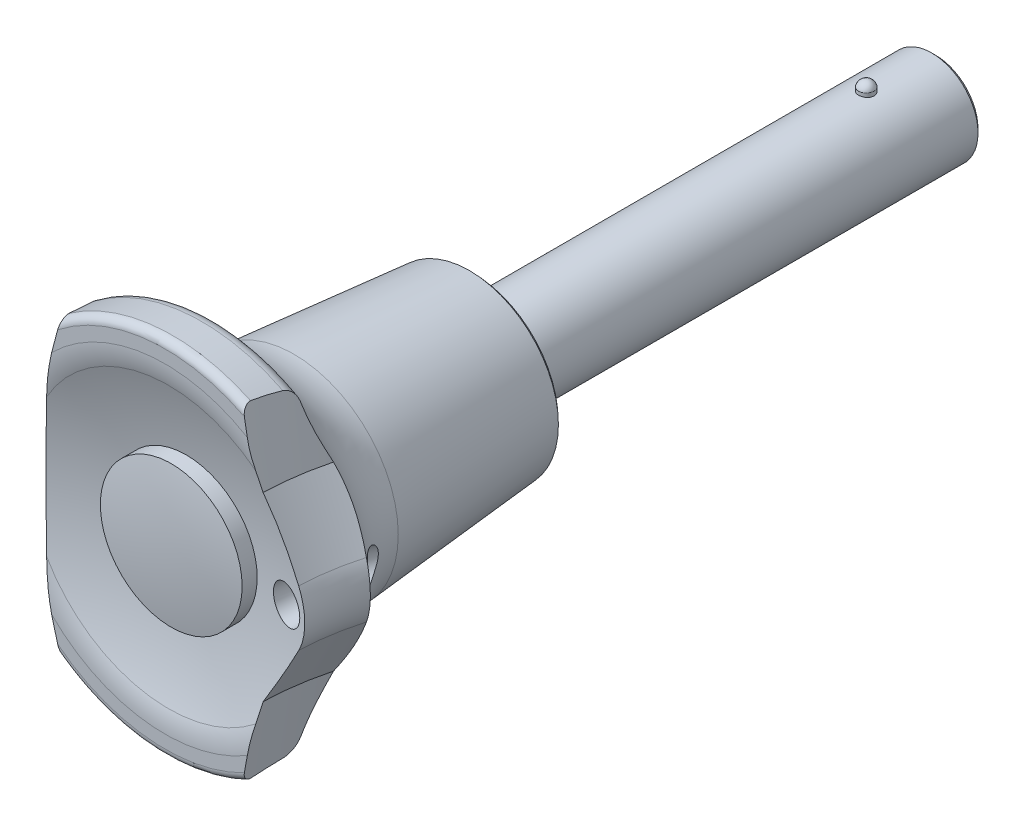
ISO-10303-21;
HEADER;
FILE_DESCRIPTION(('STEP AP214'),'2;1');
FILE_NAME('part.step','',(''),(''),'','','');
FILE_SCHEMA(('AUTOMOTIVE_DESIGN { 1 0 10303 214 1 1 1 1 }'));
ENDSEC;
DATA;
#1=APPLICATION_CONTEXT('core data for automotive mechanical design processes');
#2=APPLICATION_PROTOCOL_DEFINITION('international standard','automotive_design',2000,#1);
#3=PRODUCT_CONTEXT('',#1,'mechanical');
#4=PRODUCT('Part','Part','',(#3));
#5=PRODUCT_RELATED_PRODUCT_CATEGORY('part','',(#4));
#6=PRODUCT_DEFINITION_FORMATION('','',#4);
#7=PRODUCT_DEFINITION_CONTEXT('part definition',#1,'design');
#8=PRODUCT_DEFINITION('design','',#6,#7);
#9=PRODUCT_DEFINITION_SHAPE('','',#8);
#10=(LENGTH_UNIT() NAMED_UNIT(*) SI_UNIT(.MILLI.,.METRE.));
#11=(NAMED_UNIT(*) PLANE_ANGLE_UNIT() SI_UNIT($,.RADIAN.));
#12=(NAMED_UNIT(*) SI_UNIT($,.STERADIAN.) SOLID_ANGLE_UNIT());
#13=UNCERTAINTY_MEASURE_WITH_UNIT(LENGTH_MEASURE(1.E-05),#10,'distance_accuracy_value','');
#14=(GEOMETRIC_REPRESENTATION_CONTEXT(3) GLOBAL_UNCERTAINTY_ASSIGNED_CONTEXT((#13)) GLOBAL_UNIT_ASSIGNED_CONTEXT((#10,
#11,#12)) REPRESENTATION_CONTEXT('',''));
#15=CARTESIAN_POINT('',(0.,0.,0.));
#16=DIRECTION('',(0.,0.,1.));
#17=DIRECTION('',(1.,0.,0.));
#18=AXIS2_PLACEMENT_3D('',#15,#16,#17);
#19=CARTESIAN_POINT('',(0.,6.225,-51.));
#20=DIRECTION('',(1.,0.,0.));
#21=DIRECTION('',(0.,1.,0.));
#22=AXIS2_PLACEMENT_3D('',#19,#20,#21);
#23=SPHERICAL_SURFACE('',#22,1.025);
#24=CARTESIAN_POINT('',(0.,6.45,-51.));
#25=DIRECTION('',(0.,1.,0.));
#26=DIRECTION('',(0.,0.,1.));
#27=AXIS2_PLACEMENT_3D('',#24,#25,#26);
#28=CIRCLE('',#27,1.);
#29=CARTESIAN_POINT('',(0.,6.45,-50.));
#30=VERTEX_POINT('',#29);
#31=EDGE_CURVE('E581',#30,#30,#28,.F.);
#32=ORIENTED_EDGE('',*,*,#31,.F.);
#33=EDGE_LOOP('',(#32));
#34=FACE_BOUND('',#33,.T.);
#35=ADVANCED_FACE('F14',(#34),#23,.T.);
#36=CARTESIAN_POINT('',(0.,-6.225,-51.));
#37=DIRECTION('',(1.,0.,0.));
#38=DIRECTION('',(0.,1.,0.));
#39=AXIS2_PLACEMENT_3D('',#36,#37,#38);
#40=SPHERICAL_SURFACE('',#39,1.02500000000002);
#41=CARTESIAN_POINT('',(0.,-6.45,-51.));
#42=DIRECTION('',(0.,1.,0.));
#43=DIRECTION('',(0.,0.,1.));
#44=AXIS2_PLACEMENT_3D('',#41,#42,#43);
#45=CIRCLE('',#44,1.);
#46=CARTESIAN_POINT('',(0.,-6.45,-50.));
#47=VERTEX_POINT('',#46);
#48=EDGE_CURVE('E680',#47,#47,#45,.T.);
#49=ORIENTED_EDGE('',*,*,#48,.F.);
#50=EDGE_LOOP('',(#49));
#51=FACE_BOUND('',#50,.T.);
#52=ADVANCED_FACE('F670',(#51),#40,.T.);
#53=CARTESIAN_POINT('',(0.,2.75,-60.));
#54=DIRECTION('',(0.,0.,-1.));
#55=DIRECTION('',(-1.,0.,0.));
#56=AXIS2_PLACEMENT_3D('',#53,#54,#55);
#57=PLANE('',#56);
#58=CARTESIAN_POINT('',(0.,0.,-60.0000000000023));
#59=DIRECTION('',(0.,0.,1.));
#60=DIRECTION('',(1.,0.,0.));
#61=AXIS2_PLACEMENT_3D('',#58,#59,#60);
#62=CIRCLE('',#61,5.49999999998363);
#63=CARTESIAN_POINT('',(5.49999999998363,0.,-60.0000000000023));
#64=VERTEX_POINT('',#63);
#65=EDGE_CURVE('E682',#64,#64,#62,.T.);
#66=ORIENTED_EDGE('',*,*,#65,.F.);
#67=EDGE_LOOP('',(#66));
#68=FACE_BOUND('',#67,.T.);
#69=ADVANCED_FACE('F667',(#68),#57,.T.);
#70=CARTESIAN_POINT('',(0.,0.,-51.));
#71=DIRECTION('',(0.,1.,0.));
#72=DIRECTION('',(0.,0.,1.));
#73=AXIS2_PLACEMENT_3D('',#70,#71,#72);
#74=CYLINDRICAL_SURFACE('',#73,1.);
#75=ORIENTED_EDGE('',*,*,#31,.T.);
#76=EDGE_LOOP('',(#75));
#77=FACE_BOUND('',#76,.T.);
#78=CARTESIAN_POINT('',(0.,6.,-52.));
#79=CARTESIAN_POINT('',(0.0557503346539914,5.99999897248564,-51.999997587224));
#80=CARTESIAN_POINT('',(0.111535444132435,5.99921479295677,-51.9953216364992));
#81=CARTESIAN_POINT('',(0.221545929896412,5.99616168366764,-51.9767475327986));
#82=CARTESIAN_POINT('',(0.275769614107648,5.99389120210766,-51.9628397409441));
#83=CARTESIAN_POINT('',(0.381042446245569,5.98812022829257,-51.9262335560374));
#84=CARTESIAN_POINT('',(0.432094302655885,5.98462080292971,-51.9035427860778));
#85=CARTESIAN_POINT('',(0.529658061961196,5.97677679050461,-51.850034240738));
#86=CARTESIAN_POINT('',(0.576170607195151,5.97243232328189,-51.8192176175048));
#87=CARTESIAN_POINT('',(0.66378891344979,5.96333328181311,-51.7500180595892));
#88=CARTESIAN_POINT('',(0.704844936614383,5.95857551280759,-51.7115725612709));
#89=CARTESIAN_POINT('',(0.779955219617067,5.94921053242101,-51.6283410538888));
#90=CARTESIAN_POINT('',(0.814008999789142,5.94460333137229,-51.5835546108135));
#91=CARTESIAN_POINT('',(0.874346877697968,5.93603025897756,-51.4885715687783));
#92=CARTESIAN_POINT('',(0.900581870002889,5.93206850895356,-51.4383433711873));
#93=CARTESIAN_POINT('',(0.944223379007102,5.92527915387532,-51.3341160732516));
#94=CARTESIAN_POINT('',(0.961630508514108,5.92245147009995,-51.2801172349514));
#95=CARTESIAN_POINT('',(0.986965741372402,5.91828214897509,-51.1704079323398));
#96=CARTESIAN_POINT('',(0.994979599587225,5.91692707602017,-51.1147177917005));
#97=CARTESIAN_POINT('',(1.00156669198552,5.91581575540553,-51.0027679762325));
#98=CARTESIAN_POINT('',(1.00014057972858,5.91605939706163,-50.946508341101));
#99=CARTESIAN_POINT('',(0.987958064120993,5.91810571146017,-50.8356290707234));
#100=CARTESIAN_POINT('',(0.977298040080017,5.91989227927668,-50.7809985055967));
#101=CARTESIAN_POINT('',(0.947101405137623,5.9247979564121,-50.6743118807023));
#102=CARTESIAN_POINT('',(0.927564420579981,5.92791712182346,-50.6222559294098));
#103=CARTESIAN_POINT('',(0.880069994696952,5.93515405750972,-50.521906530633));
#104=CARTESIAN_POINT('',(0.852072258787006,5.93927658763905,-50.4736325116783));
#105=CARTESIAN_POINT('',(0.788481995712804,5.94805203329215,-50.3824349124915));
#106=CARTESIAN_POINT('',(0.752889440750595,5.95270495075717,-50.3395113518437));
#107=CARTESIAN_POINT('',(0.674601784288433,5.96208707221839,-50.2596784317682));
#108=CARTESIAN_POINT('',(0.631825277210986,5.9668165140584,-50.2228488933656));
#109=CARTESIAN_POINT('',(0.540634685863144,5.97576853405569,-50.1568617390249));
#110=CARTESIAN_POINT('',(0.492218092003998,5.97999088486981,-50.1277075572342));
#111=CARTESIAN_POINT('',(0.391033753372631,5.98745939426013,-50.0778938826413));
#112=CARTESIAN_POINT('',(0.338259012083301,5.99070394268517,-50.0572483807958));
#113=CARTESIAN_POINT('',(0.229994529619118,5.99583383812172,-50.0251781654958));
#114=CARTESIAN_POINT('',(0.174510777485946,5.99772205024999,-50.0137340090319));
#115=CARTESIAN_POINT('',(0.0988544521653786,5.99921820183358,-50.0047001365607));
#116=CARTESIAN_POINT('',(0.0791283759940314,5.99951075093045,-50.0029390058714));
#117=CARTESIAN_POINT('',(0.0396045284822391,5.99990183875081,-50.0005884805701));
#118=CARTESIAN_POINT('',(0.019806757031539,6.0000003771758,-49.9999990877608));
#119=CARTESIAN_POINT('',(-0.0557017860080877,5.9999989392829,-50.0000025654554));
#120=CARTESIAN_POINT('',(-0.111474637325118,5.99921557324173,-50.0046737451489));
#121=CARTESIAN_POINT('',(-0.221497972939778,5.99616392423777,-50.0232387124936));
#122=CARTESIAN_POINT('',(-0.275745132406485,5.99389262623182,-50.0371512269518));
#123=CARTESIAN_POINT('',(-0.381047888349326,5.98811984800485,-50.0737688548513));
#124=CARTESIAN_POINT('',(-0.432107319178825,5.98461988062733,-50.0964631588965));
#125=CARTESIAN_POINT('',(-0.529670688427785,5.97677565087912,-50.1499738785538));
#126=CARTESIAN_POINT('',(-0.57617645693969,5.9724317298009,-50.1807870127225));
#127=CARTESIAN_POINT('',(-0.663783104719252,5.96333387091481,-50.2499773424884));
#128=CARTESIAN_POINT('',(-0.704834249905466,5.95857673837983,-50.2884170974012));
#129=CARTESIAN_POINT('',(-0.779946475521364,5.94921172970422,-50.3716477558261));
#130=CARTESIAN_POINT('',(-0.814005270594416,5.94460390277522,-50.4164407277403));
#131=CARTESIAN_POINT('',(-0.874362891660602,5.93602794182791,-50.5114524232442));
#132=CARTESIAN_POINT('',(-0.900609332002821,5.93206420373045,-50.5617048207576));
#133=CARTESIAN_POINT('',(-0.944242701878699,5.9252761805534,-50.6659474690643));
#134=CARTESIAN_POINT('',(-0.961639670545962,5.92245060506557,-50.7199334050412));
#135=CARTESIAN_POINT('',(-0.982867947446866,5.91895607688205,-50.8118400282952));
#136=CARTESIAN_POINT('',(-0.989282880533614,5.91788293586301,-50.8491691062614));
#137=CARTESIAN_POINT('',(-0.997849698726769,5.91644442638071,-50.9243267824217));
#138=CARTESIAN_POINT('',(-1.00000164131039,5.9160790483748,-50.962155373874));
#139=CARTESIAN_POINT('',(-0.999997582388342,5.91608086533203,-51.0557442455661));
#140=CARTESIAN_POINT('',(-0.995322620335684,5.91687628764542,-51.1115232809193));
#141=CARTESIAN_POINT('',(-0.976752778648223,5.91996951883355,-51.2215212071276));
#142=CARTESIAN_POINT('',(-0.962848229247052,5.92226890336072,-51.2757383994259));
#143=CARTESIAN_POINT('',(-0.926251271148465,5.92810252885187,-51.3809982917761));
#144=CARTESIAN_POINT('',(-0.903566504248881,5.93163569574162,-51.4320437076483));
#145=CARTESIAN_POINT('',(-0.850072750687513,5.93953734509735,-51.5295951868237));
#146=CARTESIAN_POINT('',(-0.819265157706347,5.94390568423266,-51.5761020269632));
#147=CARTESIAN_POINT('',(-0.750078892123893,5.95303338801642,-51.6637203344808));
#148=CARTESIAN_POINT('',(-0.711636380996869,5.95779583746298,-51.7047810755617));
#149=CARTESIAN_POINT('',(-0.628398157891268,5.9671489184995,-51.7799099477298));
#150=CARTESIAN_POINT('',(-0.583600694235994,5.97173950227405,-51.8139761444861));
#151=CARTESIAN_POINT('',(-0.488585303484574,5.98026523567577,-51.8743417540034));
#152=CARTESIAN_POINT('',(-0.438334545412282,5.98419600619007,-51.9005901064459));
#153=CARTESIAN_POINT('',(-0.334095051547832,5.99091787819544,-51.9442276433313));
#154=CARTESIAN_POINT('',(-0.28011059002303,5.99371025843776,-51.961626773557));
#155=CARTESIAN_POINT('',(-0.188198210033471,5.99716174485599,-51.9828609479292));
#156=CARTESIAN_POINT('',(-0.150861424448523,5.99822090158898,-51.9892785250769));
#157=CARTESIAN_POINT('',(-0.0756884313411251,5.99964037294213,-51.9978488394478));
#158=CARTESIAN_POINT('',(-0.0378522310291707,6.00000069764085,-52.0000016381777));
#159=CARTESIAN_POINT('',(0.,6.,-52.));
#160=B_SPLINE_CURVE_WITH_KNOTS('',3,(#78,#79,#80,#81,#82,#83,#84,#85,#86,#87,#88,#89,#90,#91,
#92,#93,#94,#95,#96,#97,#98,#99,#100,#101,#102,#103,#104,#105,#106,#107,#108,#109,#110,#111,
#112,#113,#114,#115,#116,#117,#118,#119,#120,#121,#122,#123,#124,#125,#126,#127,#128,#129,#130,
#131,#132,#133,#134,#135,#136,#137,#138,#139,#140,#141,#142,#143,#144,#145,#146,#147,#148,#149,
#150,#151,#152,#153,#154,#155,#156,#157,#158,#159),.UNSPECIFIED.,.T.,.F.,(4,2,2,2,2,2,2,2,2,2,2,
2,2,2,2,2,2,2,2,2,2,2,2,2,2,2,2,2,2,2,2,2,2,2,2,2,2,2,2,2,4),(0.,0.167112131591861,
0.334399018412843,0.501541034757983,0.668659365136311,0.837209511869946,1.00577120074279,
1.17537024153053,1.34495750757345,1.51298417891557,1.68099921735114,1.84728143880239,
2.01357066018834,2.18066466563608,2.34775928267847,2.51689385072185,2.6861039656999,
2.855591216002,3.02471938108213,3.08411267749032,3.14350606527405,3.31053582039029,
3.47790508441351,3.64506898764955,3.81216543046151,3.98069385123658,4.14927726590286,
4.31896688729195,4.48846357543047,4.60190468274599,4.71534426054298,4.88243809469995,
5.04970726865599,5.2168311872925,5.38392645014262,5.55248261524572,5.72108533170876,
5.89076623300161,6.06025600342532,6.173720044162,6.28718244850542),.UNSPECIFIED.);
#161=CARTESIAN_POINT('',(0.,6.,-52.));
#162=VERTEX_POINT('',#161);
#163=EDGE_CURVE('E639',#162,#162,#160,.T.);
#164=ORIENTED_EDGE('',*,*,#163,.F.);
#165=EDGE_LOOP('',(#164));
#166=FACE_BOUND('',#165,.T.);
#167=ADVANCED_FACE('F662',(#77,#166),#74,.T.);
#168=CARTESIAN_POINT('',(0.,0.,-51.));
#169=DIRECTION('',(0.,1.,0.));
#170=DIRECTION('',(0.,0.,1.));
#171=AXIS2_PLACEMENT_3D('',#168,#169,#170);
#172=CYLINDRICAL_SURFACE('',#171,1.);
#173=CARTESIAN_POINT('',(0.,-6.,-50.));
#174=CARTESIAN_POINT('',(0.0557503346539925,-5.99999897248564,-50.0000024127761));
#175=CARTESIAN_POINT('',(0.111535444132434,-5.99921479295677,-50.0046783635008));
#176=CARTESIAN_POINT('',(0.22154592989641,-5.99616168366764,-50.0232524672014));
#177=CARTESIAN_POINT('',(0.275769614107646,-5.99389120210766,-50.0371602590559));
#178=CARTESIAN_POINT('',(0.381042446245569,-5.98812022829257,-50.0737664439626));
#179=CARTESIAN_POINT('',(0.432094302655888,-5.98462080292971,-50.0964572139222));
#180=CARTESIAN_POINT('',(0.529658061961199,-5.97677679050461,-50.149965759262));
#181=CARTESIAN_POINT('',(0.57617060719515,-5.97243232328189,-50.1807823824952));
#182=CARTESIAN_POINT('',(0.663788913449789,-5.96333328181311,-50.2499819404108));
#183=CARTESIAN_POINT('',(0.704844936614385,-5.95857551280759,-50.2884274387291));
#184=CARTESIAN_POINT('',(0.77995521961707,-5.94921053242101,-50.3716589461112));
#185=CARTESIAN_POINT('',(0.814008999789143,-5.94460333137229,-50.4164453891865));
#186=CARTESIAN_POINT('',(0.874346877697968,-5.93603025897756,-50.5114284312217));
#187=CARTESIAN_POINT('',(0.900581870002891,-5.93206850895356,-50.5616566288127));
#188=CARTESIAN_POINT('',(0.944223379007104,-5.92527915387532,-50.6658839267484));
#189=CARTESIAN_POINT('',(0.961630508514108,-5.92245147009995,-50.7198827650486));
#190=CARTESIAN_POINT('',(0.986965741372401,-5.91828214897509,-50.8295920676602));
#191=CARTESIAN_POINT('',(0.994979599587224,-5.91692707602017,-50.8852822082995));
#192=CARTESIAN_POINT('',(1.00156669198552,-5.91581575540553,-50.9972320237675));
#193=CARTESIAN_POINT('',(1.00014057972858,-5.91605939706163,-51.053491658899));
#194=CARTESIAN_POINT('',(0.987958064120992,-5.91810571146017,-51.1643709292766));
#195=CARTESIAN_POINT('',(0.977298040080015,-5.91989227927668,-51.2190014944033));
#196=CARTESIAN_POINT('',(0.947101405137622,-5.9247979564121,-51.3256881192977));
#197=CARTESIAN_POINT('',(0.927564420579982,-5.92791712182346,-51.3777440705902));
#198=CARTESIAN_POINT('',(0.880069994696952,-5.93515405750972,-51.478093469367));
#199=CARTESIAN_POINT('',(0.852072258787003,-5.93927658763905,-51.5263674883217));
#200=CARTESIAN_POINT('',(0.7884819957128,-5.94805203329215,-51.6175650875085));
#201=CARTESIAN_POINT('',(0.752889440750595,-5.95270495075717,-51.6604886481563));
#202=CARTESIAN_POINT('',(0.674601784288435,-5.96208707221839,-51.7403215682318));
#203=CARTESIAN_POINT('',(0.631825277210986,-5.9668165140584,-51.7771511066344));
#204=CARTESIAN_POINT('',(0.540634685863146,-5.97576853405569,-51.8431382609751));
#205=CARTESIAN_POINT('',(0.492218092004,-5.97999088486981,-51.8722924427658));
#206=CARTESIAN_POINT('',(0.391033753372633,-5.98745939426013,-51.9221061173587));
#207=CARTESIAN_POINT('',(0.338259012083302,-5.99070394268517,-51.9427516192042));
#208=CARTESIAN_POINT('',(0.229994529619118,-5.99583383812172,-51.9748218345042));
#209=CARTESIAN_POINT('',(0.174510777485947,-5.99772205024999,-51.9862659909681));
#210=CARTESIAN_POINT('',(0.0988544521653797,-5.99921820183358,-51.9952998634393));
#211=CARTESIAN_POINT('',(0.0791283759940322,-5.99951075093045,-51.9970609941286));
#212=CARTESIAN_POINT('',(0.0396045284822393,-5.99990183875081,-51.9994115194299));
#213=CARTESIAN_POINT('',(0.0198067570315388,-6.0000003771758,-52.0000009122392));
#214=CARTESIAN_POINT('',(-0.0557017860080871,-5.9999989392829,-51.9999974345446));
#215=CARTESIAN_POINT('',(-0.111474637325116,-5.99921557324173,-51.9953262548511));
#216=CARTESIAN_POINT('',(-0.221497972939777,-5.99616392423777,-51.9767612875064));
#217=CARTESIAN_POINT('',(-0.275745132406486,-5.99389262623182,-51.9628487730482));
#218=CARTESIAN_POINT('',(-0.381047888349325,-5.98811984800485,-51.9262311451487));
#219=CARTESIAN_POINT('',(-0.43210731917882,-5.98461988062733,-51.9035368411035));
#220=CARTESIAN_POINT('',(-0.52967068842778,-5.97677565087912,-51.8500261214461));
#221=CARTESIAN_POINT('',(-0.576176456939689,-5.9724317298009,-51.8192129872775));
#222=CARTESIAN_POINT('',(-0.663783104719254,-5.96333387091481,-51.7500226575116));
#223=CARTESIAN_POINT('',(-0.704834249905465,-5.95857673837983,-51.7115829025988));
#224=CARTESIAN_POINT('',(-0.779946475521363,-5.94921172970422,-51.6283522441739));
#225=CARTESIAN_POINT('',(-0.814005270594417,-5.94460390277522,-51.5835592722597));
#226=CARTESIAN_POINT('',(-0.874362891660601,-5.93602794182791,-51.4885475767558));
#227=CARTESIAN_POINT('',(-0.900609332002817,-5.93206420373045,-51.4382951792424));
#228=CARTESIAN_POINT('',(-0.944242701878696,-5.9252761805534,-51.3340525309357));
#229=CARTESIAN_POINT('',(-0.961639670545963,-5.92245060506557,-51.2800665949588));
#230=CARTESIAN_POINT('',(-0.982867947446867,-5.91895607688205,-51.1881599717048));
#231=CARTESIAN_POINT('',(-0.989282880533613,-5.91788293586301,-51.1508308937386));
#232=CARTESIAN_POINT('',(-0.997849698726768,-5.91644442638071,-51.0756732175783));
#233=CARTESIAN_POINT('',(-1.00000164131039,-5.9160790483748,-51.037844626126));
#234=CARTESIAN_POINT('',(-0.999997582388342,-5.91608086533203,-50.9442557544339));
#235=CARTESIAN_POINT('',(-0.995322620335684,-5.91687628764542,-50.8884767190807));
#236=CARTESIAN_POINT('',(-0.976752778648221,-5.91996951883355,-50.7784787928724));
#237=CARTESIAN_POINT('',(-0.962848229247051,-5.92226890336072,-50.7242616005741));
#238=CARTESIAN_POINT('',(-0.926251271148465,-5.92810252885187,-50.6190017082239));
#239=CARTESIAN_POINT('',(-0.903566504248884,-5.93163569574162,-50.5679562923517));
#240=CARTESIAN_POINT('',(-0.850072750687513,-5.93953734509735,-50.4704048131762));
#241=CARTESIAN_POINT('',(-0.819265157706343,-5.94390568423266,-50.4238979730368));
#242=CARTESIAN_POINT('',(-0.750078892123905,-5.95303338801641,-50.3362796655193));
#243=CARTESIAN_POINT('',(-0.711636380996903,-5.95779583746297,-50.2952189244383));
#244=CARTESIAN_POINT('',(-0.628398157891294,-5.9671489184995,-50.2200900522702));
#245=CARTESIAN_POINT('',(-0.583600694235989,-5.97173950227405,-50.186023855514));
#246=CARTESIAN_POINT('',(-0.488585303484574,-5.98026523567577,-50.1256582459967));
#247=CARTESIAN_POINT('',(-0.438334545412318,-5.98419600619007,-50.0994098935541));
#248=CARTESIAN_POINT('',(-0.334095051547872,-5.99091787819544,-50.0557723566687));
#249=CARTESIAN_POINT('',(-0.280110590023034,-5.99371025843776,-50.0383732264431));
#250=CARTESIAN_POINT('',(-0.188198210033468,-5.99716174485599,-50.0171390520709));
#251=CARTESIAN_POINT('',(-0.150861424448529,-5.99822090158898,-50.0107214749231));
#252=CARTESIAN_POINT('',(-0.0756884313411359,-5.99964037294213,-50.0021511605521));
#253=CARTESIAN_POINT('',(-0.0378522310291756,-6.00000069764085,-49.9999983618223));
#254=CARTESIAN_POINT('',(0.,-6.,-50.));
#255=B_SPLINE_CURVE_WITH_KNOTS('',3,(#173,#174,#175,#176,#177,#178,#179,#180,#181,#182,#183,
#184,#185,#186,#187,#188,#189,#190,#191,#192,#193,#194,#195,#196,#197,#198,#199,#200,#201,#202,
#203,#204,#205,#206,#207,#208,#209,#210,#211,#212,#213,#214,#215,#216,#217,#218,#219,#220,#221,
#222,#223,#224,#225,#226,#227,#228,#229,#230,#231,#232,#233,#234,#235,#236,#237,#238,#239,#240,
#241,#242,#243,#244,#245,#246,#247,#248,#249,#250,#251,#252,#253,#254),.UNSPECIFIED.,.T.,.F.,(4,
2,2,2,2,2,2,2,2,2,2,2,2,2,2,2,2,2,2,2,2,2,2,2,2,2,2,2,2,2,2,2,2,2,2,2,2,2,2,2,4),(0.,
0.167112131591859,0.334399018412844,0.501541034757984,0.668659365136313,0.837209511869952,
1.0057712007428,1.17537024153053,1.34495750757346,1.51298417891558,1.68099921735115,
1.8472814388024,2.01357066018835,2.18066466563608,2.34775928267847,2.51689385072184,
2.6861039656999,2.85559121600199,3.02471938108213,3.08411267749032,3.14350606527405,
3.31053582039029,3.47790508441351,3.64506898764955,3.8121654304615,3.98069385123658,
4.14927726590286,4.31896688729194,4.48846357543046,4.60190468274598,4.71534426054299,
4.88243809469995,5.049707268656,5.2168311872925,5.38392645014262,5.55248261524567,
5.7210853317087,5.89076623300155,6.06025600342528,6.17372004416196,6.28718244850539),.UNSPECIFIED.);
#256=CARTESIAN_POINT('',(0.,-6.,-50.));
#257=VERTEX_POINT('',#256);
#258=EDGE_CURVE('E643',#257,#257,#255,.T.);
#259=ORIENTED_EDGE('',*,*,#258,.F.);
#260=EDGE_LOOP('',(#259));
#261=FACE_BOUND('',#260,.T.);
#262=ORIENTED_EDGE('',*,*,#48,.T.);
#263=EDGE_LOOP('',(#262));
#264=FACE_BOUND('',#263,.T.);
#265=ADVANCED_FACE('F632',(#261,#264),#172,.T.);
#266=CARTESIAN_POINT('',(0.,0.,-59.5000000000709));
#267=DIRECTION('',(0.,0.,1.));
#268=DIRECTION('',(1.,0.,0.));
#269=AXIS2_PLACEMENT_3D('',#266,#267,#268);
#270=CONICAL_SURFACE('',#269,5.99999999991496,0.785398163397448);
#271=ORIENTED_EDGE('',*,*,#65,.T.);
#272=EDGE_LOOP('',(#271));
#273=FACE_BOUND('',#272,.T.);
#274=CARTESIAN_POINT('',(0.,0.,-59.5));
#275=DIRECTION('',(0.,0.,1.));
#276=DIRECTION('',(1.,0.,0.));
#277=AXIS2_PLACEMENT_3D('',#274,#275,#276);
#278=CIRCLE('',#277,6.);
#279=CARTESIAN_POINT('',(6.,0.,-59.5));
#280=VERTEX_POINT('',#279);
#281=EDGE_CURVE('E24',#280,#280,#278,.T.);
#282=ORIENTED_EDGE('',*,*,#281,.F.);
#283=EDGE_LOOP('',(#282));
#284=FACE_BOUND('',#283,.T.);
#285=ADVANCED_FACE('F627',(#273,#284),#270,.T.);
#286=CARTESIAN_POINT('',(0.,0.,-19.75));
#287=DIRECTION('',(0.,0.,1.));
#288=DIRECTION('',(1.,0.,0.));
#289=AXIS2_PLACEMENT_3D('',#286,#287,#288);
#290=CYLINDRICAL_SURFACE('',#289,6.);
#291=CARTESIAN_POINT('',(0.,0.,0.));
#292=DIRECTION('',(0.,0.,-1.));
#293=DIRECTION('',(-1.,0.,0.));
#294=AXIS2_PLACEMENT_3D('',#291,#292,#293);
#295=CIRCLE('',#294,6.);
#296=CARTESIAN_POINT('',(-6.,0.,0.));
#297=VERTEX_POINT('',#296);
#298=EDGE_CURVE('E9',#297,#297,#295,.F.);
#299=ORIENTED_EDGE('',*,*,#298,.F.);
#300=EDGE_LOOP('',(#299));
#301=FACE_BOUND('',#300,.T.);
#302=ORIENTED_EDGE('',*,*,#163,.T.);
#303=EDGE_LOOP('',(#302));
#304=FACE_BOUND('',#303,.T.);
#305=ORIENTED_EDGE('',*,*,#258,.T.);
#306=EDGE_LOOP('',(#305));
#307=FACE_BOUND('',#306,.T.);
#308=ORIENTED_EDGE('',*,*,#281,.T.);
#309=EDGE_LOOP('',(#308));
#310=FACE_BOUND('',#309,.T.);
#311=ADVANCED_FACE('F16',(#301,#304,#307,#310),#290,.T.);
#312=CARTESIAN_POINT('',(0.,-2.65618770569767E-13,-13.3000000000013));
#313=DIRECTION('',(1.,0.,0.));
#314=DIRECTION('',(0.,1.,0.));
#315=AXIS2_PLACEMENT_3D('',#312,#313,#314);
#316=SPHERICAL_SURFACE('',#315,53.3000000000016);
#317=CARTESIAN_POINT('',(0.,0.,39.2));
#318=DIRECTION('',(0.,0.,1.));
#319=DIRECTION('',(1.,0.,0.));
#320=AXIS2_PLACEMENT_3D('',#317,#318,#319);
#321=CIRCLE('',#320,9.2);
#322=CARTESIAN_POINT('',(9.2,0.,39.2));
#323=VERTEX_POINT('',#322);
#324=EDGE_CURVE('E575',#323,#323,#321,.F.);
#325=ORIENTED_EDGE('',*,*,#324,.F.);
#326=EDGE_LOOP('',(#325));
#327=FACE_BOUND('',#326,.T.);
#328=ADVANCED_FACE('F590',(#327),#316,.T.);
#329=CARTESIAN_POINT('',(0.,0.,29.6));
#330=DIRECTION('',(0.,0.,1.));
#331=DIRECTION('',(1.,0.,0.));
#332=AXIS2_PLACEMENT_3D('',#329,#330,#331);
#333=CYLINDRICAL_SURFACE('',#332,9.2);
#334=ORIENTED_EDGE('',*,*,#324,.T.);
#335=EDGE_LOOP('',(#334));
#336=FACE_BOUND('',#335,.T.);
#337=CARTESIAN_POINT('',(9.2,0.,37.2467115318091));
#338=CARTESIAN_POINT('',(9.20000185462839,-0.258477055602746,37.2467115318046));
#339=CARTESIAN_POINT('',(9.18910252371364,-0.516923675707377,37.2467115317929));
#340=CARTESIAN_POINT('',(9.14558128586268,-1.0320661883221,37.2467115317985));
#341=CARTESIAN_POINT('',(9.11295366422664,-1.28876160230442,37.2467115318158));
#342=CARTESIAN_POINT('',(9.02615325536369,-1.79876171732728,37.2467115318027));
#343=CARTESIAN_POINT('',(8.97195747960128,-2.05206250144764,37.2467115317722));
#344=CARTESIAN_POINT('',(8.84240671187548,-2.55319845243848,37.2467115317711));
#345=CARTESIAN_POINT('',(8.7670514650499,-2.80103355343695,37.2467115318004));
#346=CARTESIAN_POINT('',(8.59576047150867,-3.2893491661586,37.2467115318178));
#347=CARTESIAN_POINT('',(8.49983486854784,-3.52983323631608,37.2467115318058));
#348=CARTESIAN_POINT('',(8.28806173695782,-4.00186826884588,37.246711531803));
#349=CARTESIAN_POINT('',(8.17221389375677,-4.23341909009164,37.2467115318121));
#350=CARTESIAN_POINT('',(7.92147515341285,-4.68583944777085,37.2467115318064));
#351=CARTESIAN_POINT('',(7.78659246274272,-4.90671353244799,37.2467115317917));
#352=CARTESIAN_POINT('',(7.49865494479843,-5.3363920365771,37.2467115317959));
#353=CARTESIAN_POINT('',(7.34559384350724,-5.54519225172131,37.2467115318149));
#354=CARTESIAN_POINT('',(7.0224378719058,-5.94913959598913,37.2467115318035));
#355=CARTESIAN_POINT('',(6.85234434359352,-6.14428779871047,37.2467115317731));
#356=CARTESIAN_POINT('',(6.49631888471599,-6.51956588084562,37.246711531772));
#357=CARTESIAN_POINT('',(6.31038662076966,-6.69969544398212,37.2467115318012));
#358=CARTESIAN_POINT('',(5.92400519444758,-7.04365410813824,37.2467115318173));
#359=CARTESIAN_POINT('',(5.72355577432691,-7.20748291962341,37.2467115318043));
#360=CARTESIAN_POINT('',(5.30956347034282,-7.5176751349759,37.2467115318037));
#361=CARTESIAN_POINT('',(5.09602029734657,-7.66403815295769,37.2467115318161));
#362=CARTESIAN_POINT('',(4.65736864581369,-7.93825027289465,37.2467115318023));
#363=CARTESIAN_POINT('',(4.43226047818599,-8.06609987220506,37.246711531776));
#364=CARTESIAN_POINT('',(3.97207525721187,-8.30238022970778,37.2467115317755));
#365=CARTESIAN_POINT('',(3.73699826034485,-8.41081109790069,37.2467115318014));
#366=CARTESIAN_POINT('',(3.25854539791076,-8.60748402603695,37.246711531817));
#367=CARTESIAN_POINT('',(3.01516953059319,-8.69572608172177,37.2467115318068));
#368=CARTESIAN_POINT('',(2.5218489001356,-8.8513941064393,37.2467115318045));
#369=CARTESIAN_POINT('',(2.27190412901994,-8.9188200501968,37.2467115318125));
#370=CARTESIAN_POINT('',(1.76726641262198,-9.03236657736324,37.2467115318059));
#371=CARTESIAN_POINT('',(1.51257429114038,-9.07849082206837,37.2467115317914));
#372=CARTESIAN_POINT('',(1.00012124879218,-9.14913549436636,37.2467115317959));
#373=CARTESIAN_POINT('',(0.742359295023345,-9.17364842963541,37.2467115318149));
#374=CARTESIAN_POINT('',(0.225734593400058,-9.20086637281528,37.2467115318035));
#375=CARTESIAN_POINT('',(-0.03312794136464,-9.20357542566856,37.2467115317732));
#376=CARTESIAN_POINT('',(-0.550166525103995,-9.18717680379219,37.246711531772));
#377=CARTESIAN_POINT('',(-0.808342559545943,-9.16806867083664,37.2467115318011));
#378=CARTESIAN_POINT('',(-1.32216168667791,-9.10817141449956,37.2467115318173));
#379=CARTESIAN_POINT('',(-1.57780483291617,-9.06738275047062,37.2467115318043));
#380=CARTESIAN_POINT('',(-2.08475193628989,-8.96441355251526,37.2467115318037));
#381=CARTESIAN_POINT('',(-2.33605579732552,-8.90223254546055,37.2467115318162));
#382=CARTESIAN_POINT('',(-2.83253007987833,-8.75692145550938,37.2467115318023));
#383=CARTESIAN_POINT('',(-3.07770054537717,-8.67379152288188,37.246711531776));
#384=CARTESIAN_POINT('',(-3.56016551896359,-8.48717389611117,37.2467115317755));
#385=CARTESIAN_POINT('',(-3.79746007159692,-8.38368631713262,37.2467115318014));
#386=CARTESIAN_POINT('',(-4.26248809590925,-8.15708862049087,37.246711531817));
#387=CARTESIAN_POINT('',(-4.49022154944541,-8.03397846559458,37.2467115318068));
#388=CARTESIAN_POINT('',(-4.93450813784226,-7.7690108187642,37.2467115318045));
#389=CARTESIAN_POINT('',(-5.15106125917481,-7.62715330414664,37.2467115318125));
#390=CARTESIAN_POINT('',(-5.57141062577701,-7.32572590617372,37.2467115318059));
#391=CARTESIAN_POINT('',(-5.77520908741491,-7.16615911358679,37.2467115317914));
#392=CARTESIAN_POINT('',(-6.1687101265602,-6.83036880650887,37.246711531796));
#393=CARTESIAN_POINT('',(-6.35840779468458,-6.65413953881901,37.2467115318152));
#394=CARTESIAN_POINT('',(-6.72224710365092,-6.28635764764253,37.2467115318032));
#395=CARTESIAN_POINT('',(-6.89639155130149,-6.09480780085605,37.2467115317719));
#396=CARTESIAN_POINT('',(-7.22792754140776,-5.69771568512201,37.2467115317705));
#397=CARTESIAN_POINT('',(-7.38531882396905,-5.49217319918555,37.2467115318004));
#398=CARTESIAN_POINT('',(-7.68222361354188,-5.06856374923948,37.246711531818));
#399=CARTESIAN_POINT('',(-7.82173745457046,-4.85049701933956,37.2467115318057));
#400=CARTESIAN_POINT('',(-8.0819018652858,-4.4033808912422,37.2467115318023));
#401=CARTESIAN_POINT('',(-8.20255201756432,-4.17433125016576,37.2467115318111));
#402=CARTESIAN_POINT('',(-8.42410685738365,-3.70692592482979,37.2467115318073));
#403=CARTESIAN_POINT('',(-8.52501522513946,-3.4685719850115,37.2467115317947));
#404=CARTESIAN_POINT('',(-8.70642929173,-2.98412666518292,37.2467115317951));
#405=CARTESIAN_POINT('',(-8.78692781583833,-2.73803259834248,37.2467115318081));
#406=CARTESIAN_POINT('',(-8.92687528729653,-2.24003727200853,37.2467115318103));
#407=CARTESIAN_POINT('',(-8.9863326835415,-1.98813838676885,37.2467115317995));
#408=CARTESIAN_POINT('',(-9.08384258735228,-1.48011271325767,37.2467115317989));
#409=CARTESIAN_POINT('',(-9.12188538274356,-1.22398406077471,37.2467115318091));
#410=CARTESIAN_POINT('',(-9.17625392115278,-0.709432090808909,37.2467115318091));
#411=CARTESIAN_POINT('',(-9.19257966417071,-0.451008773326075,37.2467115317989));
#412=CARTESIAN_POINT('',(-9.20339556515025,0.0661771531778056,37.2467115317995));
#413=CARTESIAN_POINT('',(-9.19789561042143,0.324939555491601,37.2467115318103));
#414=CARTESIAN_POINT('',(-9.16511481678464,0.841185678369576,37.2467115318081));
#415=CARTESIAN_POINT('',(-9.13782521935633,1.09866884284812,37.2467115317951));
#416=CARTESIAN_POINT('',(-9.06166168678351,1.61033030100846,37.2467115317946));
#417=CARTESIAN_POINT('',(-9.01279532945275,1.86450972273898,37.2467115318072));
#418=CARTESIAN_POINT('',(-8.89381622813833,2.3678965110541,37.246711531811));
#419=CARTESIAN_POINT('',(-8.82369952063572,2.6171029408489,37.2467115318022));
#420=CARTESIAN_POINT('',(-8.66272318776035,3.10871759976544,37.2467115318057));
#421=CARTESIAN_POINT('',(-8.5718640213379,3.35112597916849,37.246711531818));
#422=CARTESIAN_POINT('',(-8.37004594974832,3.82743143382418,37.2467115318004));
#423=CARTESIAN_POINT('',(-8.25908666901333,4.06132834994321,37.2467115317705));
#424=CARTESIAN_POINT('',(-8.01786026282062,4.51893962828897,37.2467115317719));
#425=CARTESIAN_POINT('',(-7.88759343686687,4.74265414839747,37.2467115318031));
#426=CARTESIAN_POINT('',(-7.60865148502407,5.17835352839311,37.2467115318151));
#427=CARTESIAN_POINT('',(-7.45997303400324,5.39033625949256,37.246711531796));
#428=CARTESIAN_POINT('',(-7.14533841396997,5.80094952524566,37.2467115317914));
#429=CARTESIAN_POINT('',(-6.97938824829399,5.99958466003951,37.2467115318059));
#430=CARTESIAN_POINT('',(-6.63131665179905,6.3822048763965,37.2467115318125));
#431=CARTESIAN_POINT('',(-6.44919240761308,6.56618739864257,37.2467115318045));
#432=CARTESIAN_POINT('',(-6.07009243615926,6.91815563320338,37.2467115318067));
#433=CARTESIAN_POINT('',(-5.87311672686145,7.08614136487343,37.2467115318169));
#434=CARTESIAN_POINT('',(-5.46571438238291,7.40492171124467,37.2467115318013));
#435=CARTESIAN_POINT('',(-5.25528777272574,7.55571635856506,37.2467115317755));
#436=CARTESIAN_POINT('',(-4.8224780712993,7.83904364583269,37.2467115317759));
#437=CARTESIAN_POINT('',(-4.60009491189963,7.971576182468,37.2467115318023));
#438=CARTESIAN_POINT('',(-4.14495258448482,8.21743689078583,37.2467115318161));
#439=CARTESIAN_POINT('',(-3.91219334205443,8.33076492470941,37.2467115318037));
#440=CARTESIAN_POINT('',(-3.43796040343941,8.53740746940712,37.2467115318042));
#441=CARTESIAN_POINT('',(-3.19648690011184,8.6307224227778,37.2467115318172));
#442=CARTESIAN_POINT('',(-2.70653205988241,8.7966803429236,37.246711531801));
#443=CARTESIAN_POINT('',(-2.45805057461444,8.86932287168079,37.2467115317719));
#444=CARTESIAN_POINT('',(-1.95585656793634,8.99341554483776,37.2467115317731));
#445=CARTESIAN_POINT('',(-1.70214415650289,9.04486613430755,37.2467115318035));
#446=CARTESIAN_POINT('',(-1.19123944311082,9.12621890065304,37.2467115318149));
#447=CARTESIAN_POINT('',(-0.934046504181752,9.15611707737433,37.2467115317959));
#448=CARTESIAN_POINT('',(-0.418145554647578,9.19413024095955,37.2467115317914));
#449=CARTESIAN_POINT('',(-0.159438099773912,9.20225277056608,37.2467115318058));
#450=CARTESIAN_POINT('',(0.357786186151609,9.19667812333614,37.2467115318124));
#451=CARTESIAN_POINT('',(0.616302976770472,9.18297719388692,37.2467115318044));
#452=CARTESIAN_POINT('',(1.1312630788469,9.13384602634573,37.2467115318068));
#453=CARTESIAN_POINT('',(1.38770639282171,9.09841581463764,37.246711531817));
#454=CARTESIAN_POINT('',(1.89669667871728,9.00607800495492,37.2467115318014));
#455=CARTESIAN_POINT('',(2.1492436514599,8.9491704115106,37.2467115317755));
#456=CARTESIAN_POINT('',(2.64864726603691,8.81428203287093,37.2467115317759));
#457=CARTESIAN_POINT('',(2.89550387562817,8.73630112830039,37.2467115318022));
#458=CARTESIAN_POINT('',(3.38177681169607,8.55981829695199,37.246711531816));
#459=CARTESIAN_POINT('',(3.62119293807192,8.46131581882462,37.2467115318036));
#460=CARTESIAN_POINT('',(4.09087056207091,8.2444938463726,37.2467115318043));
#461=CARTESIAN_POINT('',(4.32113226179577,8.12617478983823,37.2467115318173));
#462=CARTESIAN_POINT('',(4.77086558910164,7.87056159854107,37.2467115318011));
#463=CARTESIAN_POINT('',(4.99033740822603,7.73326780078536,37.246711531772));
#464=CARTESIAN_POINT('',(5.4169305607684,7.44068268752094,37.2467115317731));
#465=CARTESIAN_POINT('',(5.62405215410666,7.28539175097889,37.2467115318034));
#466=CARTESIAN_POINT('',(6.02449325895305,6.95790104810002,37.2467115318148));
#467=CARTESIAN_POINT('',(6.21781168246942,6.78569995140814,37.2467115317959));
#468=CARTESIAN_POINT('',(6.58918960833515,6.42568596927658,37.2467115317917));
#469=CARTESIAN_POINT('',(6.76725436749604,6.23787850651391,37.2467115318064));
#470=CARTESIAN_POINT('',(7.10700778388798,5.84785067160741,37.246711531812));
#471=CARTESIAN_POINT('',(7.26868936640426,5.6456241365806,37.2467115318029));
#472=CARTESIAN_POINT('',(7.57443690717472,5.22827132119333,37.2467115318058));
#473=CARTESIAN_POINT('',(7.71850314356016,5.01314524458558,37.2467115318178));
#474=CARTESIAN_POINT('',(7.98806497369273,4.57141097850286,37.2467115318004));
#475=CARTESIAN_POINT('',(8.11355139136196,4.34479718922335,37.2467115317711));
#476=CARTESIAN_POINT('',(8.34497404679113,3.8818023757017,37.2467115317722));
#477=CARTESIAN_POINT('',(8.45091052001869,3.64542146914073,37.2467115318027));
#478=CARTESIAN_POINT('',(8.64237937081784,3.16482381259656,37.2467115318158));
#479=CARTESIAN_POINT('',(8.72793341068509,2.92061569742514,37.2467115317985));
#480=CARTESIAN_POINT('',(8.87815350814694,2.42594426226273,37.2467115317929));
#481=CARTESIAN_POINT('',(8.94282505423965,2.17548260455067,37.2467115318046));
#482=CARTESIAN_POINT('',(9.06430244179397,1.6070403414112,37.2467115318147));
#483=CARTESIAN_POINT('',(9.11514584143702,1.28776808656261,37.2467115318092));
#484=CARTESIAN_POINT('',(9.1829934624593,0.645648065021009,37.2467115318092));
#485=CARTESIAN_POINT('',(9.19999768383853,0.32280029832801,37.2467115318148));
#486=CARTESIAN_POINT('',(9.2,0.,37.2467115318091));
#487=B_SPLINE_CURVE_WITH_KNOTS('',3,(#337,#338,#339,#340,#341,#342,#343,#344,#345,#346,#347,
#348,#349,#350,#351,#352,#353,#354,#355,#356,#357,#358,#359,#360,#361,#362,#363,#364,#365,#366,
#367,#368,#369,#370,#371,#372,#373,#374,#375,#376,#377,#378,#379,#380,#381,#382,#383,#384,#385,
#386,#387,#388,#389,#390,#391,#392,#393,#394,#395,#396,#397,#398,#399,#400,#401,#402,#403,#404,
#405,#406,#407,#408,#409,#410,#411,#412,#413,#414,#415,#416,#417,#418,#419,#420,#421,#422,#423,
#424,#425,#426,#427,#428,#429,#430,#431,#432,#433,#434,#435,#436,#437,#438,#439,#440,#441,#442,
#443,#444,#445,#446,#447,#448,#449,#450,#451,#452,#453,#454,#455,#456,#457,#458,#459,#460,#461,
#462,#463,#464,#465,#466,#467,#468,#469,#470,#471,#472,#473,#474,#475,#476,#477,#478,#479,#480,
#481,#482,#483,#484,#485,#486),.UNSPECIFIED.,.T.,.F.,(4,2,2,2,2,2,2,2,2,2,2,2,2,2,2,2,2,2,2,2,2,
2,2,2,2,2,2,2,2,2,2,2,2,2,2,2,2,2,2,2,2,2,2,2,2,2,2,2,2,2,2,2,2,2,2,2,2,2,2,2,2,2,2,2,2,2,2,2,2,
2,2,2,2,2,4),(0.,0.775149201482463,1.55050235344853,2.32668414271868,3.1028752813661,
3.87868453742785,4.65450604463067,5.42999408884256,6.20575056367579,6.98144596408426,
7.7571576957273,8.53288320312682,9.30862584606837,10.0843476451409,10.8600650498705,
11.6357826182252,12.4115011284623,13.1870862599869,13.9629401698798,14.7386501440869,
15.5143764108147,16.2900862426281,17.0658132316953,17.8415346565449,18.6172516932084,
19.3929702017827,20.1686896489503,20.9442739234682,21.7201269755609,22.4958397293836,
23.2715645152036,24.0472748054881,24.8230022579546,25.5985849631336,26.3744399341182,
27.1499830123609,27.9258775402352,28.7017720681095,29.4773151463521,30.2531701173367,
31.0287528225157,31.8044802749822,32.5801905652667,33.3559153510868,34.1316281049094,
34.9074811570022,35.68306543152,36.4587848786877,37.2345033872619,38.0102204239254,
38.785941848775,39.5616688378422,40.3373786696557,41.1131049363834,41.8888149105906,
42.6646688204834,43.440253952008,44.2159724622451,44.9916900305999,45.7674074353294,
46.543129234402,47.3188718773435,48.094597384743,48.870309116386,49.6460045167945,
50.4217609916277,51.1972490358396,51.9730705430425,52.7488797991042,53.5250709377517,
54.3012527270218,55.0766058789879,55.8517550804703,56.8198038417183,57.7878526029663),.UNSPECIFIED.);
#488=CARTESIAN_POINT('',(9.2,0.,37.2467115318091));
#489=VERTEX_POINT('',#488);
#490=EDGE_CURVE('E453',#489,#489,#487,.T.);
#491=ORIENTED_EDGE('',*,*,#490,.F.);
#492=EDGE_LOOP('',(#491));
#493=FACE_BOUND('',#492,.T.);
#494=ADVANCED_FACE('F584',(#336,#493),#333,.T.);
#495=CARTESIAN_POINT('',(0.,0.,39.));
#496=DIRECTION('',(0.,0.,1.));
#497=DIRECTION('',(1.,0.,0.));
#498=AXIS2_PLACEMENT_3D('',#495,#496,#497);
#499=CONICAL_SURFACE('',#498,23.5,0.0872664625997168);
#500=CARTESIAN_POINT('',(-14.0673042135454,-18.4089758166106,35.2109490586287));
#501=CARTESIAN_POINT('',(-14.038497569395,-18.4445454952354,35.3340774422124));
#502=CARTESIAN_POINT('',(-14.010555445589,-18.4793411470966,35.4576313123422));
#503=CARTESIAN_POINT('',(-13.9564585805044,-18.5473642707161,35.7053725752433));
#504=CARTESIAN_POINT('',(-13.930301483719,-18.5805937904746,35.8295588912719));
#505=CARTESIAN_POINT('',(-13.8797805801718,-18.645527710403,36.0785549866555));
#506=CARTESIAN_POINT('',(-13.8554150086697,-18.6772336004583,36.2033640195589));
#507=CARTESIAN_POINT('',(-13.8084834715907,-18.7391589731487,36.4535969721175));
#508=CARTESIAN_POINT('',(-13.7859163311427,-18.7693794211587,36.5790204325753));
#509=CARTESIAN_POINT('',(-13.7425890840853,-18.8283688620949,36.8304747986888));
#510=CARTESIAN_POINT('',(-13.72182839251,-18.8571383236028,36.9565054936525));
#511=CARTESIAN_POINT('',(-13.682123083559,-18.9132561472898,37.2091644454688));
#512=CARTESIAN_POINT('',(-13.6631784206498,-18.9406045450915,37.3357926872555));
#513=CARTESIAN_POINT('',(-13.6271139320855,-18.9939089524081,37.5896467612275));
#514=CARTESIAN_POINT('',(-13.6099947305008,-19.0198644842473,37.7168727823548));
#515=CARTESIAN_POINT('',(-13.5775920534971,-19.0704070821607,37.9719191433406));
#516=CARTESIAN_POINT('',(-13.5623098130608,-19.0949932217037,38.099739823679));
#517=CARTESIAN_POINT('',(-13.5335934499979,-19.1428174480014,38.355973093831));
#518=CARTESIAN_POINT('',(-13.5201611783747,-19.1660541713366,38.4843861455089));
#519=CARTESIAN_POINT('',(-13.495158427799,-19.2111958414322,38.741802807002));
#520=CARTESIAN_POINT('',(-13.4835904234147,-19.2330989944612,38.8708069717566));
#521=CARTESIAN_POINT('',(-13.4729701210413,-19.254326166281,39.));
#522=B_SPLINE_CURVE_WITH_KNOTS('',3,(#500,#501,#502,#503,#504,#505,#506,#507,#508,#509,#510,
#511,#512,#513,#514,#515,#516,#517,#518,#519,#520,#521),.UNSPECIFIED.,.F.,.F.,(4,2,2,2,2,2,2,2,
2,2,4),(0.,0.394075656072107,0.787620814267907,1.18077296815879,1.57366614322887,
1.96643161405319,2.35918723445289,2.75207669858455,3.14522884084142,3.53877154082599,
3.93283238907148),.UNSPECIFIED.);
#523=CARTESIAN_POINT('',(-14.0673042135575,-18.4089758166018,35.210949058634));
#524=VERTEX_POINT('',#523);
#525=CARTESIAN_POINT('',(-13.4729701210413,-19.2543261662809,39.));
#526=VERTEX_POINT('',#525);
#527=EDGE_CURVE('E425',#524,#526,#522,.T.);
#528=ORIENTED_EDGE('',*,*,#527,.F.);
#529=CARTESIAN_POINT('',(0.,0.,35.2109490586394));
#530=DIRECTION('',(0.,0.,1.));
#531=DIRECTION('',(1.,0.,0.));
#532=AXIS2_PLACEMENT_3D('',#529,#530,#531);
#533=CIRCLE('',#532,23.1685009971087);
#534=CARTESIAN_POINT('',(10.4924614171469,-20.6564201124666,35.2109490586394));
#535=VERTEX_POINT('',#534);
#536=EDGE_CURVE('E447',#535,#524,#533,.F.);
#537=ORIENTED_EDGE('',*,*,#536,.F.);
#538=CARTESIAN_POINT('',(10.4924614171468,-20.6564201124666,35.2109490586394));
#539=CARTESIAN_POINT('',(10.4414396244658,-20.7129643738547,35.5231506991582));
#540=CARTESIAN_POINT('',(10.3948183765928,-20.7670368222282,35.8365153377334));
#541=CARTESIAN_POINT('',(10.3104798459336,-20.8703793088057,36.464902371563));
#542=CARTESIAN_POINT('',(10.2727537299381,-20.9196540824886,36.7799228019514));
#543=CARTESIAN_POINT('',(10.2062065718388,-21.0136541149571,37.4115750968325));
#544=CARTESIAN_POINT('',(10.1773854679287,-21.0583794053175,37.7282069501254));
#545=CARTESIAN_POINT('',(10.1286691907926,-21.1434545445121,38.3630665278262));
#546=CARTESIAN_POINT('',(10.1087829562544,-21.1837999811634,38.6812955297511));
#547=CARTESIAN_POINT('',(10.0934036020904,-21.2219978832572,38.9999976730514));
#548=B_SPLINE_CURVE_WITH_KNOTS('',3,(#538,#539,#540,#541,#542,#543,#544,#545,#546,#547),
.UNSPECIFIED.,.F.,.F.,(4,2,2,2,4),(0.,0.96402396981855,1.92708655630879,2.89014245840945,
3.85415969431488),.UNSPECIFIED.);
#549=CARTESIAN_POINT('',(10.0934035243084,-21.221998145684,38.9999988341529));
#550=VERTEX_POINT('',#549);
#551=EDGE_CURVE('E551',#535,#550,#548,.T.);
#552=ORIENTED_EDGE('',*,*,#551,.T.);
#553=CARTESIAN_POINT('',(0.,0.,39.));
#554=DIRECTION('',(0.,0.,1.));
#555=DIRECTION('',(1.,0.,0.));
#556=AXIS2_PLACEMENT_3D('',#553,#554,#555);
#557=CIRCLE('',#556,23.5);
#558=EDGE_CURVE('E431',#526,#550,#557,.T.);
#559=ORIENTED_EDGE('',*,*,#558,.F.);
#560=EDGE_LOOP('',(#528,#537,#552,#559));
#561=FACE_BOUND('',#560,.T.);
#562=ADVANCED_FACE('F589',(#561),#499,.T.);
#563=CARTESIAN_POINT('',(0.,0.,39.));
#564=DIRECTION('',(0.,0.,1.));
#565=DIRECTION('',(1.,0.,0.));
#566=AXIS2_PLACEMENT_3D('',#563,#564,#565);
#567=TOROIDAL_SURFACE('',#566,22.5,1.);
#568=CARTESIAN_POINT('',(10.0934035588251,-21.221998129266,38.9999976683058));
#569=CARTESIAN_POINT('',(10.0926974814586,-21.222336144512,39.0238266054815));
#570=CARTESIAN_POINT('',(10.0921993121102,-21.2216269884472,39.0476642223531));
#571=CARTESIAN_POINT('',(10.0916184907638,-21.2181348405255,39.0951833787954));
#572=CARTESIAN_POINT('',(10.0915356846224,-21.2153526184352,39.1188649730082));
#573=CARTESIAN_POINT('',(10.0919077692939,-21.2039733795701,39.1891515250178));
#574=CARTESIAN_POINT('',(10.0929744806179,-21.1923473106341,39.2352967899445));
#575=CARTESIAN_POINT('',(10.0966377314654,-21.1616534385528,39.3248704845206));
#576=CARTESIAN_POINT('',(10.0992327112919,-21.1425932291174,39.3683016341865));
#577=CARTESIAN_POINT('',(10.105768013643,-21.0979672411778,39.451603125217));
#578=CARTESIAN_POINT('',(10.1097097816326,-21.0723944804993,39.4914695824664));
#579=CARTESIAN_POINT('',(10.1189779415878,-21.0142035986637,39.569123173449));
#580=CARTESIAN_POINT('',(10.1243705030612,-20.9812667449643,39.6066618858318));
#581=CARTESIAN_POINT('',(10.1361594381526,-20.9105436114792,39.6766362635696));
#582=CARTESIAN_POINT('',(10.1425561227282,-20.8727558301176,39.7090703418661));
#583=CARTESIAN_POINT('',(10.157340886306,-20.7862876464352,39.774053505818));
#584=CARTESIAN_POINT('',(10.1658804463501,-20.7368684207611,39.8055830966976));
#585=CARTESIAN_POINT('',(10.1837264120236,-20.6342194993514,39.8614255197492));
#586=CARTESIAN_POINT('',(10.1930336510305,-20.580985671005,39.8857303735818));
#587=CARTESIAN_POINT('',(10.2141045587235,-20.4608201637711,39.9314812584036));
#588=CARTESIAN_POINT('',(10.225982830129,-20.3933045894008,39.9513404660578));
#589=CARTESIAN_POINT('',(10.2501156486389,-20.256279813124,39.9810869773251));
#590=CARTESIAN_POINT('',(10.2623697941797,-20.1867727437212,39.9909845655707));
#591=CARTESIAN_POINT('',(10.2811304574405,-20.0803746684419,39.9986819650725));
#592=CARTESIAN_POINT('',(10.2875964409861,-20.0437065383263,39.9999977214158));
#593=CARTESIAN_POINT('',(10.2940578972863,-20.007058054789,40.));
#594=B_SPLINE_CURVE_WITH_KNOTS('',3,(#568,#569,#570,#571,#572,#573,#574,#575,#576,#577,#578,
#579,#580,#581,#582,#583,#584,#585,#586,#587,#588,#589,#590,#591,#592,#593),.UNSPECIFIED.,.F.,
.F.,(4,2,2,2,2,2,2,2,2,2,2,2,4),(0.,0.0714775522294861,0.142928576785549,0.284947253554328,
0.426821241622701,0.568847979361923,0.718978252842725,0.869155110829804,1.04622486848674,
1.22348944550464,1.4368069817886,1.64990405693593,1.76157017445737),.UNSPECIFIED.);
#595=CARTESIAN_POINT('',(10.294057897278,-20.0070580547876,40.));
#596=VERTEX_POINT('',#595);
#597=EDGE_CURVE('E430',#550,#596,#594,.T.);
#598=ORIENTED_EDGE('',*,*,#597,.T.);
#599=CARTESIAN_POINT('',(0.,0.,40.));
#600=DIRECTION('',(0.,0.,-1.));
#601=DIRECTION('',(0.457513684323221,-0.889202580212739,0.));
#602=AXIS2_PLACEMENT_3D('',#599,#600,#601);
#603=CIRCLE('',#602,22.5);
#604=CARTESIAN_POINT('',(-13.9431117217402,-17.6589817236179,40.));
#605=VERTEX_POINT('',#604);
#606=EDGE_CURVE('E418',#605,#596,#603,.F.);
#607=ORIENTED_EDGE('',*,*,#606,.F.);
#608=CARTESIAN_POINT('',(-13.4729701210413,-19.2543261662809,39.));
#609=CARTESIAN_POINT('',(-13.4722059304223,-19.2548679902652,39.0198018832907));
#610=CARTESIAN_POINT('',(-13.4717639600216,-19.2544524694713,39.0396385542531));
#611=CARTESIAN_POINT('',(-13.4715143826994,-19.2517517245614,39.0791693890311));
#612=CARTESIAN_POINT('',(-13.4717061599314,-19.2494683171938,39.0988636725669));
#613=CARTESIAN_POINT('',(-13.4727069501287,-19.2431132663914,39.137719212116));
#614=CARTESIAN_POINT('',(-13.4735090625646,-19.2390618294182,39.1568839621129));
#615=CARTESIAN_POINT('',(-13.4756900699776,-19.2292792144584,39.1947424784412));
#616=CARTESIAN_POINT('',(-13.4770690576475,-19.2235477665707,39.2134361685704));
#617=CARTESIAN_POINT('',(-13.4819990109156,-19.2040669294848,39.2684652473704));
#618=CARTESIAN_POINT('',(-13.4863482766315,-19.187999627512,39.3039299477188));
#619=CARTESIAN_POINT('',(-13.4967843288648,-19.1508343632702,39.3718825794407));
#620=CARTESIAN_POINT('',(-13.5028762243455,-19.1297216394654,39.4043613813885));
#621=CARTESIAN_POINT('',(-13.5196912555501,-19.0723735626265,39.4811414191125));
#622=CARTESIAN_POINT('',(-13.5312250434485,-19.0337805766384,39.5234979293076));
#623=CARTESIAN_POINT('',(-13.5562206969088,-18.950853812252,39.6014346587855));
#624=CARTESIAN_POINT('',(-13.5696863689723,-18.9065087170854,39.637001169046));
#625=CARTESIAN_POINT('',(-13.5950695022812,-18.8231111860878,39.6956170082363));
#626=CARTESIAN_POINT('',(-13.6067683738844,-18.7847403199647,39.7197515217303));
#627=CARTESIAN_POINT('',(-13.6307295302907,-18.7061377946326,39.7644676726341));
#628=CARTESIAN_POINT('',(-13.6429921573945,-18.6659050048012,39.7850471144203));
#629=CARTESIAN_POINT('',(-13.6804390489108,-18.542855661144,39.8420713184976));
#630=CARTESIAN_POINT('',(-13.7062079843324,-18.4579308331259,39.8736401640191));
#631=CARTESIAN_POINT('',(-13.7497954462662,-18.3134076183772,39.9171455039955));
#632=CARTESIAN_POINT('',(-13.7674559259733,-18.254616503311,39.9321258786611));
#633=CARTESIAN_POINT('',(-13.802907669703,-18.1360390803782,39.9574787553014));
#634=CARTESIAN_POINT('',(-13.8206990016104,-18.0762522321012,39.9678486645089));
#635=CARTESIAN_POINT('',(-13.856003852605,-17.9569903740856,39.9841365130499));
#636=CARTESIAN_POINT('',(-13.8735175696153,-17.8975239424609,39.9901183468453));
#637=CARTESIAN_POINT('',(-13.9084222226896,-17.7783711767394,39.9980400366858));
#638=CARTESIAN_POINT('',(-13.9258132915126,-17.7186852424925,39.9999852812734));
#639=CARTESIAN_POINT('',(-13.9431117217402,-17.6589817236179,40.));
#640=B_SPLINE_CURVE_WITH_KNOTS('',3,(#608,#609,#610,#611,#612,#613,#614,#615,#616,#617,#618,
#619,#620,#621,#622,#623,#624,#625,#626,#627,#628,#629,#630,#631,#632,#633,#634,#635,#636,#637,
#638,#639),.UNSPECIFIED.,.F.,.F.,(4,2,2,2,2,2,2,2,2,2,2,2,2,2,2,4),(0.,0.0594411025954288,
0.118824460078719,0.177546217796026,0.236277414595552,0.353195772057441,0.470460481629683,
0.644828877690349,0.819545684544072,0.959796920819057,1.10013446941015,1.3817026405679,
1.57112267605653,1.76064910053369,1.94735787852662,2.13381725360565),.UNSPECIFIED.);
#641=EDGE_CURVE('E383',#526,#605,#640,.T.);
#642=ORIENTED_EDGE('',*,*,#641,.F.);
#643=ORIENTED_EDGE('',*,*,#558,.T.);
#644=EDGE_LOOP('',(#598,#607,#642,#643));
#645=FACE_BOUND('',#644,.T.);
#646=ADVANCED_FACE('F395',(#645),#567,.T.);
#647=CARTESIAN_POINT('',(0.,21.6580572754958,40.));
#648=DIRECTION('',(0.,0.,1.));
#649=DIRECTION('',(1.,0.,0.));
#650=AXIS2_PLACEMENT_3D('',#647,#648,#649);
#651=PLANE('',#650);
#652=CARTESIAN_POINT('',(10.2940578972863,-20.0070580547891,40.));
#653=CARTESIAN_POINT('',(10.3097344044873,-19.9181521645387,39.9999999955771));
#654=CARTESIAN_POINT('',(10.3254109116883,-19.8292462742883,39.999999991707));
#655=CARTESIAN_POINT('',(10.3567639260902,-19.6514344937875,39.9999999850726));
#656=CARTESIAN_POINT('',(10.3724404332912,-19.5625286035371,39.9999999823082));
#657=CARTESIAN_POINT('',(10.4037934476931,-19.3847168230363,39.9999999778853));
#658=CARTESIAN_POINT('',(10.419469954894,-19.2958109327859,39.9999999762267));
#659=CARTESIAN_POINT('',(10.4508229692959,-19.1179991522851,39.9999999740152));
#660=CARTESIAN_POINT('',(10.4664994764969,-19.0290932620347,39.9999999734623));
#661=CARTESIAN_POINT('',(10.4978524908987,-18.8512814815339,39.9999999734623));
#662=CARTESIAN_POINT('',(10.5135289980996,-18.7623755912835,39.9999999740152));
#663=CARTESIAN_POINT('',(10.5448820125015,-18.5845638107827,39.9999999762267));
#664=CARTESIAN_POINT('',(10.5605585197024,-18.4956579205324,39.9999999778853));
#665=CARTESIAN_POINT('',(10.5919115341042,-18.3178461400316,39.9999999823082));
#666=CARTESIAN_POINT('',(10.6075880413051,-18.2289402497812,39.9999999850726));
#667=CARTESIAN_POINT('',(10.6389410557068,-18.0511284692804,39.999999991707));
#668=CARTESIAN_POINT('',(10.6546175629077,-17.96222257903,39.9999999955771));
#669=CARTESIAN_POINT('',(10.6702940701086,-17.8733166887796,40.));
#670=B_SPLINE_CURVE_WITH_KNOTS('',3,(#652,#653,#654,#655,#656,#657,#658,#659,#660,#661,#662,
#663,#664,#665,#666,#667,#668,#669),.UNSPECIFIED.,.F.,.F.,(4,2,2,2,2,2,2,2,4),(0.,
0.270832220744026,0.541664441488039,0.812496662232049,1.08332888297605,1.35416110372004,
1.62499332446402,1.895825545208,2.16665776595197),.UNSPECIFIED.);
#671=CARTESIAN_POINT('',(10.6702940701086,-17.8733166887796,40.));
#672=VERTEX_POINT('',#671);
#673=EDGE_CURVE('E236',#596,#672,#670,.T.);
#674=ORIENTED_EDGE('',*,*,#673,.T.);
#675=CARTESIAN_POINT('',(0.,0.,40.0000000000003));
#676=DIRECTION('',(0.,0.,1.));
#677=DIRECTION('',(-0.707099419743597,-0.707114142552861,0.));
#678=AXIS2_PLACEMENT_3D('',#675,#676,#677);
#679=CIRCLE('',#678,20.8161145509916);
#680=CARTESIAN_POINT('',(-14.7190625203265,-14.7193689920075,40.));
#681=VERTEX_POINT('',#680);
#682=EDGE_CURVE('E108',#681,#672,#679,.T.);
#683=ORIENTED_EDGE('',*,*,#682,.F.);
#684=CARTESIAN_POINT('',(-13.9431117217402,-17.6589817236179,40.));
#685=CARTESIAN_POINT('',(-14.0841765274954,-17.1721451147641,40.));
#686=CARTESIAN_POINT('',(-14.2193714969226,-16.6837590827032,40.));
#687=CARTESIAN_POINT('',(-14.4780217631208,-15.703888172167,40.));
#688=CARTESIAN_POINT('',(-14.6014770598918,-15.2124032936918,40.));
#689=CARTESIAN_POINT('',(-14.7190625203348,-14.7193689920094,40.));
#690=B_SPLINE_CURVE_WITH_KNOTS('',3,(#684,#685,#686,#687,#688,#689),.UNSPECIFIED.,.F.,.F.,(4,2,
4),(0.,1.52025897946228,3.04051795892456),.UNSPECIFIED.);
#691=EDGE_CURVE('E375',#605,#681,#690,.T.);
#692=ORIENTED_EDGE('',*,*,#691,.F.);
#693=ORIENTED_EDGE('',*,*,#606,.T.);
#694=EDGE_LOOP('',(#674,#683,#692,#693));
#695=FACE_BOUND('',#694,.T.);
#696=ADVANCED_FACE('F391',(#695),#651,.T.);
#697=CARTESIAN_POINT('',(0.,0.,32.));
#698=DIRECTION('',(0.,0.,1.));
#699=DIRECTION('',(1.,0.,0.));
#700=AXIS2_PLACEMENT_3D('',#697,#698,#699);
#701=TOROIDAL_SURFACE('',#700,20.8161145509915,8.00000000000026);
#702=CARTESIAN_POINT('',(10.6702940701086,-17.8733166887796,40.));
#703=CARTESIAN_POINT('',(10.6919702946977,-17.7503872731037,40.0000002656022));
#704=CARTESIAN_POINT('',(10.7136451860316,-17.6274605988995,39.9983277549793));
#705=CARTESIAN_POINT('',(10.7569331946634,-17.3819668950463,39.9917485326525));
#706=CARTESIAN_POINT('',(10.7785463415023,-17.2593996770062,39.9868490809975));
#707=CARTESIAN_POINT('',(10.8217150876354,-17.014619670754,39.9739365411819));
#708=CARTESIAN_POINT('',(10.8432707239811,-16.8924066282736,39.9659283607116));
#709=CARTESIAN_POINT('',(10.8863317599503,-16.6483285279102,39.9469118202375));
#710=CARTESIAN_POINT('',(10.90783718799,-16.52646324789,39.9359063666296));
#711=CARTESIAN_POINT('',(10.9508066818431,-16.2830753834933,39.9110027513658));
#712=CARTESIAN_POINT('',(10.9722707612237,-16.1615526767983,39.8971058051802));
#713=CARTESIAN_POINT('',(11.015160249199,-15.9188896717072,39.8665279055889));
#714=CARTESIAN_POINT('',(11.0365856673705,-15.7977492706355,39.8498477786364));
#715=CARTESIAN_POINT('',(11.0794197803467,-15.5557899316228,39.8137980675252));
#716=CARTESIAN_POINT('',(11.1008284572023,-15.4349712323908,39.7944268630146));
#717=CARTESIAN_POINT('',(11.1436442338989,-15.1936405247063,39.7530904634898));
#718=CARTESIAN_POINT('',(11.1650513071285,-15.0731289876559,39.731122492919));
#719=CARTESIAN_POINT('',(11.2078799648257,-14.8323987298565,39.684686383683));
#720=CARTESIAN_POINT('',(11.2293015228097,-14.7121807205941,39.6602145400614));
#721=CARTESIAN_POINT('',(11.2721765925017,-14.4720220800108,39.6088646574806));
#722=CARTESIAN_POINT('',(11.2936300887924,-14.3520823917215,39.5819821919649));
#723=CARTESIAN_POINT('',(11.3150842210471,-14.2324086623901,39.5539739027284));
#724=B_SPLINE_CURVE_WITH_KNOTS('',3,(#702,#703,#704,#705,#706,#707,#708,#709,#710,#711,#712,
#713,#714,#715,#716,#717,#718,#719,#720,#721,#722,#723),.UNSPECIFIED.,.F.,.F.,(4,2,2,2,2,2,2,2,
2,2,4),(0.,0.374462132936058,0.748084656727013,1.12111973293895,1.49379436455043,
1.86631265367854,2.23872052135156,2.61135360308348,2.98438863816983,3.35798385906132,
3.73227972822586),.UNSPECIFIED.);
#725=CARTESIAN_POINT('',(11.3150842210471,-14.2324086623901,39.5539739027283));
#726=VERTEX_POINT('',#725);
#727=EDGE_CURVE('E920',#672,#726,#724,.T.);
#728=ORIENTED_EDGE('',*,*,#727,.T.);
#729=CARTESIAN_POINT('',(0.,0.,39.5539739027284));
#730=DIRECTION('',(0.,0.,1.));
#731=DIRECTION('',(1.,0.,0.));
#732=AXIS2_PLACEMENT_3D('',#729,#730,#731);
#733=CIRCLE('',#732,18.1822052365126);
#734=CARTESIAN_POINT('',(-15.816089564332,-8.96905224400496,39.5539739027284));
#735=VERTEX_POINT('',#734);
#736=EDGE_CURVE('E100',#726,#735,#733,.F.);
#737=ORIENTED_EDGE('',*,*,#736,.T.);
#738=CARTESIAN_POINT('',(-14.7190625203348,-14.7193689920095,40.));
#739=CARTESIAN_POINT('',(-14.764588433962,-14.5284809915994,40.0000003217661));
#740=CARTESIAN_POINT('',(-14.8092254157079,-14.3373871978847,39.998019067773));
#741=CARTESIAN_POINT('',(-14.8966593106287,-13.9550930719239,39.9903860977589));
#742=CARTESIAN_POINT('',(-14.9394583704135,-13.7638931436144,39.9847387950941));
#743=CARTESIAN_POINT('',(-15.0232314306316,-13.3813798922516,39.9700706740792));
#744=CARTESIAN_POINT('',(-15.0642068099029,-13.1900667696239,39.9610524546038));
#745=CARTESIAN_POINT('',(-15.1443513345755,-12.8073167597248,39.9399365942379));
#746=CARTESIAN_POINT('',(-15.1835212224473,-12.6158799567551,39.9278402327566));
#747=CARTESIAN_POINT('',(-15.2600734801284,-12.2328733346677,39.9008622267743));
#748=CARTESIAN_POINT('',(-15.2974560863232,-12.0413035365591,39.885980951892));
#749=CARTESIAN_POINT('',(-15.3704376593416,-11.6580990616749,39.8537369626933));
#750=CARTESIAN_POINT('',(-15.4060371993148,-11.4664644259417,39.8363750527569));
#751=CARTESIAN_POINT('',(-15.4754900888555,-11.0830234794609,39.7994657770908));
#752=CARTESIAN_POINT('',(-15.5093428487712,-10.8912171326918,39.7799176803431));
#753=CARTESIAN_POINT('',(-15.5753211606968,-10.5074019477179,39.7389431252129));
#754=CARTESIAN_POINT('',(-15.6074457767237,-10.3153930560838,39.7175156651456));
#755=CARTESIAN_POINT('',(-15.6699840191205,-9.93114113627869,39.6730969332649));
#756=CARTESIAN_POINT('',(-15.7003964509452,-9.73889803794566,39.6501045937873));
#757=CARTESIAN_POINT('',(-15.7595222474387,-9.35414230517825,39.6028816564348));
#758=CARTESIAN_POINT('',(-15.7882342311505,-9.16162957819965,39.5786500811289));
#759=CARTESIAN_POINT('',(-15.816089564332,-8.96905224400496,39.5539739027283));
#760=B_SPLINE_CURVE_WITH_KNOTS('',3,(#738,#739,#740,#741,#742,#743,#744,#745,#746,#747,#748,
#749,#750,#751,#752,#753,#754,#755,#756,#757,#758,#759),.UNSPECIFIED.,.F.,.F.,(4,2,2,2,2,2,2,2,
2,2,4),(0.,0.58870442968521,1.17670146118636,1.76424609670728,2.35154692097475,2.93876985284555,
3.52580279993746,4.11303262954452,4.70057737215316,5.28852707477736,5.87694789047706),.UNSPECIFIED.);
#761=EDGE_CURVE('E372',#681,#735,#760,.T.);
#762=ORIENTED_EDGE('',*,*,#761,.F.);
#763=ORIENTED_EDGE('',*,*,#682,.T.);
#764=EDGE_LOOP('',(#728,#737,#762,#763));
#765=FACE_BOUND('',#764,.T.);
#766=ADVANCED_FACE('F303',(#765),#701,.T.);
#767=CARTESIAN_POINT('',(0.,1.42419277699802E-13,91.7));
#768=DIRECTION('',(1.,0.,0.));
#769=DIRECTION('',(0.,1.,0.));
#770=AXIS2_PLACEMENT_3D('',#767,#768,#769);
#771=SPHERICAL_SURFACE('',#770,55.225);
#772=ORIENTED_EDGE('',*,*,#490,.T.);
#773=EDGE_LOOP('',(#772));
#774=FACE_BOUND('',#773,.T.);
#775=ORIENTED_EDGE('',*,*,#736,.F.);
#776=CARTESIAN_POINT('',(11.3150842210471,-14.2324086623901,39.5539739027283));
#777=CARTESIAN_POINT('',(11.3396877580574,-14.0951679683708,39.5218549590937));
#778=CARTESIAN_POINT('',(11.3643498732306,-13.9578048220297,39.4903042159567));
#779=CARTESIAN_POINT('',(11.4137781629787,-13.6828598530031,39.4283431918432));
#780=CARTESIAN_POINT('',(11.4385443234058,-13.5452780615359,39.3979327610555));
#781=CARTESIAN_POINT('',(11.488172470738,-13.2698948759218,39.3382499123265));
#782=CARTESIAN_POINT('',(11.513034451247,-13.1320934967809,39.3089774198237));
#783=CARTESIAN_POINT('',(11.562846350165,-12.8562702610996,39.251568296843));
#784=CARTESIAN_POINT('',(11.5877962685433,-12.7182484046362,39.2234316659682));
#785=CARTESIAN_POINT('',(11.6377764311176,-12.4419831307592,39.1682923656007));
#786=CARTESIAN_POINT('',(11.6628066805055,-12.3037396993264,39.141289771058));
#787=CARTESIAN_POINT('',(11.7129402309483,-12.0270302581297,39.0884169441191));
#788=CARTESIAN_POINT('',(11.7380435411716,-11.888564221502,39.0625468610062));
#789=CARTESIAN_POINT('',(11.7631772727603,-11.75,39.0372447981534));
#790=B_SPLINE_CURVE_WITH_KNOTS('',3,(#776,#777,#778,#779,#780,#781,#782,#783,#784,#785,#786,
#787,#788,#789),.UNSPECIFIED.,.F.,.F.,(4,2,2,2,2,2,4),(0.,0.429239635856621,0.858422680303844,
1.28757755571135,1.71673228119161,2.14591532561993,2.57515477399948),.UNSPECIFIED.);
#791=CARTESIAN_POINT('',(11.7631772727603,-11.75,39.0372447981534));
#792=VERTEX_POINT('',#791);
#793=EDGE_CURVE('E145',#726,#792,#790,.T.);
#794=ORIENTED_EDGE('',*,*,#793,.T.);
#795=CARTESIAN_POINT('',(11.7631772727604,-11.75,39.0372447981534));
#796=CARTESIAN_POINT('',(11.8939560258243,-11.5245686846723,39.0161586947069));
#797=CARTESIAN_POINT('',(12.0247918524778,-11.2989902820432,38.9970001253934));
#798=CARTESIAN_POINT('',(12.2863935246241,-10.8478246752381,38.962555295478));
#799=CARTESIAN_POINT('',(12.4171592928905,-10.6222377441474,38.9472648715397));
#800=CARTESIAN_POINT('',(12.6786067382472,-10.1710477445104,38.9205395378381));
#801=CARTESIAN_POINT('',(12.8092883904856,-9.94544485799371,38.9091013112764));
#802=CARTESIAN_POINT('',(13.0705565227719,-9.49421712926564,38.8900669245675));
#803=CARTESIAN_POINT('',(13.2011430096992,-9.26859239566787,38.8824682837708));
#804=CARTESIAN_POINT('',(13.4622120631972,-8.81731635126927,38.8711029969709));
#805=CARTESIAN_POINT('',(13.5926946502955,-8.59166509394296,38.8673346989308));
#806=CARTESIAN_POINT('',(13.853549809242,-8.14033274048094,38.8636234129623));
#807=CARTESIAN_POINT('',(13.9839223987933,-7.9146516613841,38.8636795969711));
#808=CARTESIAN_POINT('',(14.2445542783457,-7.46325766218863,38.8676140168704));
#809=CARTESIAN_POINT('',(14.3748135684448,-7.2375447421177,38.8714922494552));
#810=CARTESIAN_POINT('',(14.6352186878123,-6.78608617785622,38.8830710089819));
#811=CARTESIAN_POINT('',(14.7653644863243,-6.56034053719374,38.8907723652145));
#812=CARTESIAN_POINT('',(15.0255450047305,-6.10881811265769,38.9100011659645));
#813=CARTESIAN_POINT('',(15.1555796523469,-5.88304135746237,38.9215302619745));
#814=CARTESIAN_POINT('',(15.4155434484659,-5.43146031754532,38.9484219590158));
#815=CARTESIAN_POINT('',(15.5454724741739,-5.20565610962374,38.963787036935));
#816=CARTESIAN_POINT('',(15.8052336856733,-4.75402572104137,38.9983617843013));
#817=CARTESIAN_POINT('',(15.9350656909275,-4.52819968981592,39.0175747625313));
#818=CARTESIAN_POINT('',(16.1946461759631,-4.07653416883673,39.0598603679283));
#819=CARTESIAN_POINT('',(16.3243944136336,-3.85069492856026,39.0829371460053));
#820=CARTESIAN_POINT('',(16.45402325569,-3.625,39.1079367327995));
#821=B_SPLINE_CURVE_WITH_KNOTS('',3,(#795,#796,#797,#798,#799,#800,#801,#802,#803,#804,#805,
#806,#807,#808,#809,#810,#811,#812,#813,#814,#815,#816,#817,#818,#819,#820),.UNSPECIFIED.,.F.,
.F.,(4,2,2,2,2,2,2,2,2,2,2,2,4),(0.,0.784405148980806,1.56796240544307,2.35084327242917,
3.133217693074,3.91525453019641,4.6971220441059,5.47898888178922,6.26102539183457,
7.04339975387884,7.82628060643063,8.6098375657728,9.39424177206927),.UNSPECIFIED.);
#822=CARTESIAN_POINT('',(16.45402325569,-3.625,39.1079367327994));
#823=VERTEX_POINT('',#822);
#824=EDGE_CURVE('E142',#792,#823,#821,.T.);
#825=ORIENTED_EDGE('',*,*,#824,.T.);
#826=CARTESIAN_POINT('',(16.45402325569,3.625,39.1079367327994));
#827=CARTESIAN_POINT('',(16.5541781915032,3.45066718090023,39.1272521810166));
#828=CARTESIAN_POINT('',(16.6471294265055,3.27204203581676,39.1451873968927));
#829=CARTESIAN_POINT('',(16.818008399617,2.9074879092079,39.1781717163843));
#830=CARTESIAN_POINT('',(16.8959360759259,2.72155889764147,39.1932208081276));
#831=CARTESIAN_POINT('',(17.0360827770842,2.34386317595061,39.2202938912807));
#832=CARTESIAN_POINT('',(17.0983170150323,2.15210232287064,39.2323208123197));
#833=CARTESIAN_POINT('',(17.206699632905,1.76392742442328,39.2532710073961));
#834=CARTESIAN_POINT('',(17.2528485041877,1.56751352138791,39.2621943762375));
#835=CARTESIAN_POINT('',(17.3287252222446,1.17129359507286,39.276868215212));
#836=CARTESIAN_POINT('',(17.3584427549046,0.971485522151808,39.2826166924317));
#837=CARTESIAN_POINT('',(17.4011791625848,0.570021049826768,39.2908840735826));
#838=CARTESIAN_POINT('',(17.4141977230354,0.368364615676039,39.2934029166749));
#839=CARTESIAN_POINT('',(17.4234336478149,-0.0354149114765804,39.2951898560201));
#840=CARTESIAN_POINT('',(17.4196453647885,-0.237538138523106,39.2944568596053));
#841=CARTESIAN_POINT('',(17.395285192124,-0.640723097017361,39.2897439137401));
#842=CARTESIAN_POINT('',(17.3747140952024,-0.841784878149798,39.2857641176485));
#843=CARTESIAN_POINT('',(17.3170524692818,-1.24072307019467,39.274610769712));
#844=CARTESIAN_POINT('',(17.2800193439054,-1.43860809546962,39.2674483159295));
#845=CARTESIAN_POINT('',(17.1897369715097,-1.8304988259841,39.2499919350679));
#846=CARTESIAN_POINT('',(17.1364881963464,-2.0245046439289,39.2396980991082));
#847=CARTESIAN_POINT('',(17.0142961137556,-2.40694183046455,39.2160847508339));
#848=CARTESIAN_POINT('',(16.9453797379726,-2.59538214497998,39.2027704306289));
#849=CARTESIAN_POINT('',(16.7923502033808,-2.96565444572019,39.1732182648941));
#850=CARTESIAN_POINT('',(16.7082463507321,-3.14749039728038,39.156982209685));
#851=CARTESIAN_POINT('',(16.5908954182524,-3.37599424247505,39.1343387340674));
#852=CARTESIAN_POINT('',(16.5643162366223,-3.42628614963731,39.1292107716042));
#853=CARTESIAN_POINT('',(16.5100230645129,-3.52616342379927,39.1187373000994));
#854=CARTESIAN_POINT('',(16.4823102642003,-3.57574946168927,39.113392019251));
#855=CARTESIAN_POINT('',(16.45402325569,-3.625,39.1079367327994));
#856=B_SPLINE_CURVE_WITH_KNOTS('',3,(#826,#827,#828,#829,#830,#831,#832,#833,#834,#835,#836,
#837,#838,#839,#840,#841,#842,#843,#844,#845,#846,#847,#848,#849,#850,#851,#852,#853,#854,#855),
.UNSPECIFIED.,.F.,.F.,(4,2,2,2,2,2,2,2,2,2,2,2,2,2,4),(0.,0.605765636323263,1.2115337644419,
1.81671238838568,2.42187252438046,3.02741209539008,3.63296307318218,4.23871754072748,
4.8444433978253,5.44807343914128,6.0516859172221,6.65426856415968,7.25648322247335,
7.42781527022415,7.598971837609),.UNSPECIFIED.);
#857=CARTESIAN_POINT('',(16.45402325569,3.625,39.1079367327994));
#858=VERTEX_POINT('',#857);
#859=EDGE_CURVE('E902',#858,#823,#856,.T.);
#860=ORIENTED_EDGE('',*,*,#859,.F.);
#861=CARTESIAN_POINT('',(16.45402325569,3.62500000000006,39.1079367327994));
#862=CARTESIAN_POINT('',(16.3243944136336,3.8506949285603,39.0829371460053));
#863=CARTESIAN_POINT('',(16.1946461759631,4.07653416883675,39.0598603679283));
#864=CARTESIAN_POINT('',(15.9350656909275,4.52819968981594,39.0175747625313));
#865=CARTESIAN_POINT('',(15.8052336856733,4.75402572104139,38.9983617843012));
#866=CARTESIAN_POINT('',(15.5454724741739,5.20565610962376,38.963787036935));
#867=CARTESIAN_POINT('',(15.4155434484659,5.43146031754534,38.9484219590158));
#868=CARTESIAN_POINT('',(15.1555796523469,5.88304135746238,38.9215302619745));
#869=CARTESIAN_POINT('',(15.0255450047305,6.10881811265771,38.9100011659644));
#870=CARTESIAN_POINT('',(14.7653644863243,6.56034053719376,38.8907723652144));
#871=CARTESIAN_POINT('',(14.6352186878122,6.78608617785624,38.8830710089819));
#872=CARTESIAN_POINT('',(14.3748135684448,7.23754474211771,38.8714922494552));
#873=CARTESIAN_POINT('',(14.2445542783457,7.46325766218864,38.8676140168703));
#874=CARTESIAN_POINT('',(13.9839223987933,7.91465166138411,38.863679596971));
#875=CARTESIAN_POINT('',(13.853549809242,8.14033274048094,38.8636234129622));
#876=CARTESIAN_POINT('',(13.5926946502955,8.59166509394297,38.8673346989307));
#877=CARTESIAN_POINT('',(13.4622120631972,8.81731635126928,38.8711029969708));
#878=CARTESIAN_POINT('',(13.2011430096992,9.26859239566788,38.8824682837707));
#879=CARTESIAN_POINT('',(13.0705565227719,9.49421712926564,38.8900669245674));
#880=CARTESIAN_POINT('',(12.8092883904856,9.94544485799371,38.9091013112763));
#881=CARTESIAN_POINT('',(12.6786067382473,10.1710477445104,38.9205395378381));
#882=CARTESIAN_POINT('',(12.4171592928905,10.6222377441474,38.9472648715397));
#883=CARTESIAN_POINT('',(12.2863935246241,10.8478246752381,38.9625552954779));
#884=CARTESIAN_POINT('',(12.0247918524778,11.2989902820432,38.9970001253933));
#885=CARTESIAN_POINT('',(11.8939560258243,11.5245686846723,39.0161586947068));
#886=CARTESIAN_POINT('',(11.7631772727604,11.75,39.0372447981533));
#887=B_SPLINE_CURVE_WITH_KNOTS('',3,(#861,#862,#863,#864,#865,#866,#867,#868,#869,#870,#871,
#872,#873,#874,#875,#876,#877,#878,#879,#880,#881,#882,#883,#884,#885,#886),.UNSPECIFIED.,.F.,
.F.,(4,2,2,2,2,2,2,2,2,2,2,2,4),(0.,0.784404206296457,1.56796116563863,2.35084201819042,
3.13321638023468,3.91525289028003,4.69711972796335,5.47898724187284,6.26102407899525,
7.04339849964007,7.82627936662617,8.60983662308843,9.39424177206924),.UNSPECIFIED.);
#888=CARTESIAN_POINT('',(11.7631772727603,11.75,39.0372447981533));
#889=VERTEX_POINT('',#888);
#890=EDGE_CURVE('E219',#858,#889,#887,.T.);
#891=ORIENTED_EDGE('',*,*,#890,.T.);
#892=CARTESIAN_POINT('',(11.7631772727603,11.75,39.0372447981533));
#893=CARTESIAN_POINT('',(11.7380435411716,11.888564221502,39.0625468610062));
#894=CARTESIAN_POINT('',(11.7129402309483,12.0270302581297,39.0884169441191));
#895=CARTESIAN_POINT('',(11.6628066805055,12.3037396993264,39.1412897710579));
#896=CARTESIAN_POINT('',(11.6377764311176,12.4419831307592,39.1682923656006));
#897=CARTESIAN_POINT('',(11.5877962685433,12.7182484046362,39.2234316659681));
#898=CARTESIAN_POINT('',(11.562846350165,12.8562702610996,39.2515682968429));
#899=CARTESIAN_POINT('',(11.513034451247,13.1320934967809,39.3089774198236));
#900=CARTESIAN_POINT('',(11.488172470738,13.2698948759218,39.3382499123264));
#901=CARTESIAN_POINT('',(11.4385443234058,13.5452780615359,39.3979327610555));
#902=CARTESIAN_POINT('',(11.4137781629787,13.6828598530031,39.4283431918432));
#903=CARTESIAN_POINT('',(11.3643498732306,13.9578048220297,39.4903042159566));
#904=CARTESIAN_POINT('',(11.3396877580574,14.0951679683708,39.5218549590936));
#905=CARTESIAN_POINT('',(11.3150842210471,14.2324086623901,39.5539739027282));
#906=B_SPLINE_CURVE_WITH_KNOTS('',3,(#892,#893,#894,#895,#896,#897,#898,#899,#900,#901,#902,
#903,#904,#905),.UNSPECIFIED.,.F.,.F.,(4,2,2,2,2,2,4),(0.,0.429239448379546,0.858422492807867,
1.28757721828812,1.71673209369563,2.14591513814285,2.57515477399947),.UNSPECIFIED.);
#907=CARTESIAN_POINT('',(11.3150842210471,14.2324086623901,39.5539739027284));
#908=VERTEX_POINT('',#907);
#909=EDGE_CURVE('E215',#889,#908,#906,.T.);
#910=ORIENTED_EDGE('',*,*,#909,.T.);
#911=CARTESIAN_POINT('',(0.,0.,39.5539739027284));
#912=DIRECTION('',(0.,0.,1.));
#913=DIRECTION('',(1.,0.,0.));
#914=AXIS2_PLACEMENT_3D('',#911,#912,#913);
#915=CIRCLE('',#914,18.1822052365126);
#916=CARTESIAN_POINT('',(-15.8160895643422,8.96905224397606,39.5539739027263));
#917=VERTEX_POINT('',#916);
#918=EDGE_CURVE('E520',#917,#908,#915,.F.);
#919=ORIENTED_EDGE('',*,*,#918,.F.);
#920=CARTESIAN_POINT('',(-15.816089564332,-8.96905224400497,39.5539739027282));
#921=CARTESIAN_POINT('',(-15.8799277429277,-8.52772038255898,39.4974278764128));
#922=CARTESIAN_POINT('',(-15.9392768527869,-8.08521773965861,39.4451310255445));
#923=CARTESIAN_POINT('',(-16.0487866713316,-7.19815446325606,39.3490143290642));
#924=CARTESIAN_POINT('',(-16.0989472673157,-6.75359380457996,39.3051945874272));
#925=CARTESIAN_POINT('',(-16.2353702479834,-5.4168592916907,39.1863847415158));
#926=CARTESIAN_POINT('',(-16.3075150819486,-4.52203684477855,39.1240956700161));
#927=CARTESIAN_POINT('',(-16.4129557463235,-2.72821509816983,39.0332934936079));
#928=CARTESIAN_POINT('',(-16.4462417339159,-1.82921479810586,39.0047889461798));
#929=CARTESIAN_POINT('',(-16.4731698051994,-0.0444579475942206,38.9817185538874));
#930=CARTESIAN_POINT('',(-16.4674332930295,0.841282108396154,38.9866207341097));
#931=CARTESIAN_POINT('',(-16.4178794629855,2.61056800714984,39.0291136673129));
#932=CARTESIAN_POINT('',(-16.3740756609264,3.49411451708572,39.0666928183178));
#933=CARTESIAN_POINT('',(-16.2491405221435,5.25603573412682,39.1745551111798));
#934=CARTESIAN_POINT('',(-16.1680344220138,6.13441353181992,39.244816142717));
#935=CARTESIAN_POINT('',(-16.0503828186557,7.17270894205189,39.347678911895));
#936=CARTESIAN_POINT('',(-16.0311976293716,7.33632113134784,39.3644753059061));
#937=CARTESIAN_POINT('',(-15.9915785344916,7.66325917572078,39.3992169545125));
#938=CARTESIAN_POINT('',(-15.9711447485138,7.82658505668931,39.417162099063));
#939=CARTESIAN_POINT('',(-15.9289952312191,8.15327519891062,39.4542406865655));
#940=CARTESIAN_POINT('',(-15.9072769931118,8.31663887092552,39.4733764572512));
#941=CARTESIAN_POINT('',(-15.8626059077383,8.64307317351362,39.5128064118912));
#942=CARTESIAN_POINT('',(-15.8396529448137,8.8061437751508,39.5331007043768));
#943=CARTESIAN_POINT('',(-15.8160895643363,8.96905224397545,39.5539739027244));
#944=B_SPLINE_CURVE_WITH_KNOTS('',3,(#920,#921,#922,#923,#924,#925,#926,#927,#928,#929,#930,
#931,#932,#933,#934,#935,#936,#937,#938,#939,#940,#941,#942,#943),.UNSPECIFIED.,.F.,.F.,(4,2,2,
2,2,2,2,2,2,2,2,4),(0.,1.34839714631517,2.69681083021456,5.39487075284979,8.09361393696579,
10.7494833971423,13.4044102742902,16.057543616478,16.5543037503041,17.0510163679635,
17.5487326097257,18.0464955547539),.UNSPECIFIED.);
#945=EDGE_CURVE('E360',#735,#917,#944,.T.);
#946=ORIENTED_EDGE('',*,*,#945,.F.);
#947=EDGE_LOOP('',(#775,#794,#825,#860,#891,#910,#919,#946));
#948=FACE_BOUND('',#947,.T.);
#949=CARTESIAN_POINT('',(11.8216184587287,0.,37.7551210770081));
#950=CARTESIAN_POINT('',(11.8216244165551,0.130131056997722,37.7551226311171));
#951=CARTESIAN_POINT('',(11.8323093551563,0.260358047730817,37.7579363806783));
#952=CARTESIAN_POINT('',(11.8747515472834,0.5171946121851,37.769114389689));
#953=CARTESIAN_POINT('',(11.9065343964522,0.643799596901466,37.7774853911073));
#954=CARTESIAN_POINT('',(11.9901581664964,0.889599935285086,37.7995148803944));
#955=CARTESIAN_POINT('',(12.0419819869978,1.00880150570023,37.8131688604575));
#956=CARTESIAN_POINT('',(12.1640844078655,1.23657485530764,37.8453482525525));
#957=CARTESIAN_POINT('',(12.2343589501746,1.34514896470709,37.8638725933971));
#958=CARTESIAN_POINT('',(12.3918918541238,1.54960606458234,37.9054130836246));
#959=CARTESIAN_POINT('',(12.4792799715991,1.64538204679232,37.9284635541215));
#960=CARTESIAN_POINT('',(12.6681183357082,1.82072893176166,37.9782951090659));
#961=CARTESIAN_POINT('',(12.7695702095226,1.90029795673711,38.0050766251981));
#962=CARTESIAN_POINT('',(12.9855755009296,2.04249874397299,38.0621262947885));
#963=CARTESIAN_POINT('',(13.1003305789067,2.10480256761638,38.0924481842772));
#964=CARTESIAN_POINT('',(13.3381793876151,2.20902450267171,38.1553302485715));
#965=CARTESIAN_POINT('',(13.4612739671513,2.25094053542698,38.1878906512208));
#966=CARTESIAN_POINT('',(13.7148105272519,2.31399912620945,38.2549952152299));
#967=CARTESIAN_POINT('',(13.8453477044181,2.33473157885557,38.2895653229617));
#968=CARTESIAN_POINT('',(14.1079298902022,2.35354244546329,38.3591496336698));
#969=CARTESIAN_POINT('',(14.2399750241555,2.35161896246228,38.3941638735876));
#970=CARTESIAN_POINT('',(14.503586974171,2.325034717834,38.4641116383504));
#971=CARTESIAN_POINT('',(14.635126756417,2.3000875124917,38.4990385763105));
#972=CARTESIAN_POINT('',(14.8922881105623,2.22769833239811,38.5673664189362));
#973=CARTESIAN_POINT('',(15.017909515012,2.1802557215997,38.6007672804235));
#974=CARTESIAN_POINT('',(15.2595617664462,2.06410891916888,38.6650600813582));
#975=CARTESIAN_POINT('',(15.3755957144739,1.99541163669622,38.695952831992));
#976=CARTESIAN_POINT('',(15.5946409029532,1.83854057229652,38.7543055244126));
#977=CARTESIAN_POINT('',(15.6976530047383,1.75036807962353,38.781765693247));
#978=CARTESIAN_POINT('',(15.8859852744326,1.55840783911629,38.8319956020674));
#979=CARTESIAN_POINT('',(15.9715502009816,1.45487736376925,38.8548301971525));
#980=CARTESIAN_POINT('',(16.1241692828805,1.23410572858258,38.8955760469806));
#981=CARTESIAN_POINT('',(16.1912260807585,1.1168665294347,38.9134880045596));
#982=CARTESIAN_POINT('',(16.3031971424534,0.875048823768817,38.9434059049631));
#983=CARTESIAN_POINT('',(16.3486081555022,0.750716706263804,38.9555443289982));
#984=CARTESIAN_POINT('',(16.4181287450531,0.495829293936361,38.9741301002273));
#985=CARTESIAN_POINT('',(16.442241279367,0.365274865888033,38.980578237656));
#986=CARTESIAN_POINT('',(16.4680638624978,0.10459082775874,38.9874837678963));
#987=CARTESIAN_POINT('',(16.4702334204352,-0.0254902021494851,38.9880640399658));
#988=CARTESIAN_POINT('',(16.4532951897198,-0.284153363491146,38.9835342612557));
#989=CARTESIAN_POINT('',(16.4341886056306,-0.412735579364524,38.9784245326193));
#990=CARTESIAN_POINT('',(16.3755222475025,-0.66393486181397,38.9627391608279));
#991=CARTESIAN_POINT('',(16.3360912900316,-0.78658423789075,38.9521979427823));
#992=CARTESIAN_POINT('',(16.2381166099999,-1.02340424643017,38.926015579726));
#993=CARTESIAN_POINT('',(16.1795720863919,-1.13757452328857,38.9103742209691));
#994=CARTESIAN_POINT('',(16.0443933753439,-1.35567209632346,38.8742752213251));
#995=CARTESIAN_POINT('',(15.9675571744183,-1.45946517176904,38.8537638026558));
#996=CARTESIAN_POINT('',(15.7984803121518,-1.6526042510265,38.8086535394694));
#997=CARTESIAN_POINT('',(15.7062379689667,-1.74194867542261,38.7840542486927));
#998=CARTESIAN_POINT('',(15.5067188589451,-1.90584273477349,38.7308785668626));
#999=CARTESIAN_POINT('',(15.3991462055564,-1.98000676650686,38.702224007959));
#1000=CARTESIAN_POINT('',(15.1736979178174,-2.10907817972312,38.642209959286));
#1001=CARTESIAN_POINT('',(15.0558210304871,-2.16398321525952,38.6108501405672));
#1002=CARTESIAN_POINT('',(14.8102414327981,-2.2542191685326,38.5455603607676));
#1003=CARTESIAN_POINT('',(14.6823768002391,-2.28907934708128,38.5115883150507));
#1004=CARTESIAN_POINT('',(14.4228169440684,-2.33639375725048,38.4426734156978));
#1005=CARTESIAN_POINT('',(14.291121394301,-2.34884607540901,38.4077304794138));
#1006=CARTESIAN_POINT('',(14.0259376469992,-2.35101352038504,38.3374150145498));
#1007=CARTESIAN_POINT('',(13.8924470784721,-2.3404510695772,38.3020424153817));
#1008=CARTESIAN_POINT('',(13.629071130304,-2.29623451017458,38.2322957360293));
#1009=CARTESIAN_POINT('',(13.4991857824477,-2.26258019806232,38.1979216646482));
#1010=CARTESIAN_POINT('',(13.2471167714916,-2.1731110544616,38.1312492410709));
#1011=CARTESIAN_POINT('',(13.1249138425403,-2.11735444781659,38.0989456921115));
#1012=CARTESIAN_POINT('',(12.8914792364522,-1.98510607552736,38.0372691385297));
#1013=CARTESIAN_POINT('',(12.7802463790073,-1.90861654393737,38.0078958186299));
#1014=CARTESIAN_POINT('',(12.573714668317,-1.73824550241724,37.9533795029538));
#1015=CARTESIAN_POINT('',(12.4782033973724,-1.64463964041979,37.9281800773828));
#1016=CARTESIAN_POINT('',(12.3040784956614,-1.44184953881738,37.8822544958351));
#1017=CARTESIAN_POINT('',(12.2254673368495,-1.33266302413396,37.8615289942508));
#1018=CARTESIAN_POINT('',(12.0890170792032,-1.10410374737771,37.8255631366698));
#1019=CARTESIAN_POINT('',(12.0308080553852,-0.984966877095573,37.8102250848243));
#1020=CARTESIAN_POINT('',(11.9350004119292,-0.738255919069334,37.784983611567));
#1021=CARTESIAN_POINT('',(11.897373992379,-0.61069347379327,37.7750728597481));
#1022=CARTESIAN_POINT('',(11.8543409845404,-0.401858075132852,37.7637387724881));
#1023=CARTESIAN_POINT('',(11.8420867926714,-0.322026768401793,37.7605114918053));
#1024=CARTESIAN_POINT('',(11.8257237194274,-0.161475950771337,37.7562021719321));
#1025=CARTESIAN_POINT('',(11.8216147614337,-0.0807564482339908,37.7551201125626));
#1026=CARTESIAN_POINT('',(11.8216184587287,0.,37.7551210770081));
#1027=B_SPLINE_CURVE_WITH_KNOTS('',3,(#949,#950,#951,#952,#953,#954,#955,#956,#957,#958,#959,
#960,#961,#962,#963,#964,#965,#966,#967,#968,#969,#970,#971,#972,#973,#974,#975,#976,#977,#978,
#979,#980,#981,#982,#983,#984,#985,#986,#987,#988,#989,#990,#991,#992,#993,#994,#995,#996,#997,
#998,#999,#1000,#1001,#1002,#1003,#1004,#1005,#1006,#1007,#1008,#1009,#1010,#1011,#1012,#1013,
#1014,#1015,#1016,#1017,#1018,#1019,#1020,#1021,#1022,#1023,#1024,#1025,#1026),.UNSPECIFIED.,
.T.,.F.,(4,2,2,2,2,2,2,2,2,2,2,2,2,2,2,2,2,2,2,2,2,2,2,2,2,2,2,2,2,2,2,2,2,2,2,2,2,2,4),(0.,
0.39009553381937,0.780665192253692,1.17090232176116,1.56105369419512,1.95428651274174,
2.34756486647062,2.74786832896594,3.14821259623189,3.55616837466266,3.96415831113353,
4.3772935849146,4.79044054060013,5.20345333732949,5.61643880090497,6.02315706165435,
6.42981722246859,6.82663252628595,7.22339271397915,7.61182667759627,8.00023865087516,
8.38621858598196,8.77221469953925,9.16268954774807,9.55320705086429,9.95266635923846,
10.3521743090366,10.7607169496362,11.1692944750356,11.582827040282,11.9963632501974,
12.4088172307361,12.8212267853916,13.2275013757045,13.6338353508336,14.0323658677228,
14.4303567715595,14.6724436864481,14.9145283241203),.UNSPECIFIED.);
#1028=CARTESIAN_POINT('',(11.8216184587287,0.,37.7551210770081));
#1029=VERTEX_POINT('',#1028);
#1030=EDGE_CURVE('E223',#1029,#1029,#1027,.T.);
#1031=ORIENTED_EDGE('',*,*,#1030,.T.);
#1032=EDGE_LOOP('',(#1031));
#1033=FACE_BOUND('',#1032,.T.);
#1034=ADVANCED_FACE('F296',(#774,#948,#1033),#771,.F.);
#1035=CARTESIAN_POINT('',(0.,0.,32.));
#1036=DIRECTION('',(0.,0.,1.));
#1037=DIRECTION('',(1.,0.,0.));
#1038=AXIS2_PLACEMENT_3D('',#1035,#1036,#1037);
#1039=TOROIDAL_SURFACE('',#1038,20.8161145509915,8.00000000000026);
#1040=CARTESIAN_POINT('',(11.3150842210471,14.2324086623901,39.5539739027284));
#1041=CARTESIAN_POINT('',(11.2936300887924,14.3520823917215,39.5819821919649));
#1042=CARTESIAN_POINT('',(11.2721765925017,14.4720220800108,39.6088646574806));
#1043=CARTESIAN_POINT('',(11.2293015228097,14.7121807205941,39.6602145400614));
#1044=CARTESIAN_POINT('',(11.2078799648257,14.8323987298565,39.684686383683));
#1045=CARTESIAN_POINT('',(11.1650513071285,15.0731289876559,39.731122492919));
#1046=CARTESIAN_POINT('',(11.1436442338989,15.1936405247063,39.7530904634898));
#1047=CARTESIAN_POINT('',(11.1008284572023,15.4349712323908,39.7944268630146));
#1048=CARTESIAN_POINT('',(11.0794197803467,15.5557899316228,39.8137980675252));
#1049=CARTESIAN_POINT('',(11.0365856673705,15.7977492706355,39.8498477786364));
#1050=CARTESIAN_POINT('',(11.015160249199,15.9188896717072,39.8665279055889));
#1051=CARTESIAN_POINT('',(10.9722707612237,16.1615526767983,39.8971058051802));
#1052=CARTESIAN_POINT('',(10.9508066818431,16.2830753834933,39.9110027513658));
#1053=CARTESIAN_POINT('',(10.90783718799,16.52646324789,39.9359063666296));
#1054=CARTESIAN_POINT('',(10.8863317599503,16.6483285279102,39.9469118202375));
#1055=CARTESIAN_POINT('',(10.8432707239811,16.8924066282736,39.9659283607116));
#1056=CARTESIAN_POINT('',(10.8217150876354,17.014619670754,39.9739365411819));
#1057=CARTESIAN_POINT('',(10.7785463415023,17.2593996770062,39.9868490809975));
#1058=CARTESIAN_POINT('',(10.7569331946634,17.3819668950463,39.9917485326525));
#1059=CARTESIAN_POINT('',(10.7136451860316,17.6274605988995,39.9983277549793));
#1060=CARTESIAN_POINT('',(10.6919702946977,17.7503872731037,40.0000002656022));
#1061=CARTESIAN_POINT('',(10.6702940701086,17.8733166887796,40.));
#1062=B_SPLINE_CURVE_WITH_KNOTS('',3,(#1040,#1041,#1042,#1043,#1044,#1045,#1046,#1047,#1048,
#1049,#1050,#1051,#1052,#1053,#1054,#1055,#1056,#1057,#1058,#1059,#1060,#1061),.UNSPECIFIED.,
.F.,.F.,(4,2,2,2,2,2,2,2,2,2,4),(0.,0.374295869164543,0.747891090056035,1.12092612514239,
1.49355920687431,1.86596707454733,2.23848536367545,2.61115999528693,2.98419507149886,
3.35781759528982,3.73227972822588),.UNSPECIFIED.);
#1063=CARTESIAN_POINT('',(10.6702940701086,17.8733166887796,40.));
#1064=VERTEX_POINT('',#1063);
#1065=EDGE_CURVE('E231',#908,#1064,#1062,.T.);
#1066=ORIENTED_EDGE('',*,*,#1065,.T.);
#1067=CARTESIAN_POINT('',(0.,0.,40.0000000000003));
#1068=DIRECTION('',(0.,0.,1.));
#1069=DIRECTION('',(0.512597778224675,0.858628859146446,0.));
#1070=AXIS2_PLACEMENT_3D('',#1067,#1068,#1069);
#1071=CIRCLE('',#1070,20.8161145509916);
#1072=CARTESIAN_POINT('',(-14.7190625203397,14.7193689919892,40.));
#1073=VERTEX_POINT('',#1072);
#1074=EDGE_CURVE('E324',#1073,#1064,#1071,.F.);
#1075=ORIENTED_EDGE('',*,*,#1074,.F.);
#1076=CARTESIAN_POINT('',(-15.8160895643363,8.96905224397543,39.5539739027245));
#1077=CARTESIAN_POINT('',(-15.7882342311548,9.16162957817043,39.5786500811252));
#1078=CARTESIAN_POINT('',(-15.759522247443,9.35414230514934,39.6028816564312));
#1079=CARTESIAN_POINT('',(-15.7003964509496,9.73889803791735,39.6501045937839));
#1080=CARTESIAN_POINT('',(-15.669984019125,9.9311411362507,39.6730969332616));
#1081=CARTESIAN_POINT('',(-15.6074457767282,10.3153930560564,39.7175156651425));
#1082=CARTESIAN_POINT('',(-15.5753211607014,10.5074019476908,39.73894312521));
#1083=CARTESIAN_POINT('',(-15.5093428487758,10.8912171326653,39.7799176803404));
#1084=CARTESIAN_POINT('',(-15.4754900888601,11.0830234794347,39.7994657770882));
#1085=CARTESIAN_POINT('',(-15.4060371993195,11.4664644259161,39.8363750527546));
#1086=CARTESIAN_POINT('',(-15.3704376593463,11.6580990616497,39.853736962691));
#1087=CARTESIAN_POINT('',(-15.2974560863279,12.0413035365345,39.88598095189));
#1088=CARTESIAN_POINT('',(-15.2600734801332,12.2328733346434,39.9008622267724));
#1089=CARTESIAN_POINT('',(-15.1835212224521,12.6158799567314,39.927840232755));
#1090=CARTESIAN_POINT('',(-15.1443513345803,12.8073167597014,39.9399365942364));
#1091=CARTESIAN_POINT('',(-15.0642068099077,13.1900667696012,39.9610524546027));
#1092=CARTESIAN_POINT('',(-15.0232314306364,13.3813798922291,39.9700706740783));
#1093=CARTESIAN_POINT('',(-14.9394583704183,13.7638931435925,39.9847387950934));
#1094=CARTESIAN_POINT('',(-14.8966593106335,13.9550930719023,39.9903860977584));
#1095=CARTESIAN_POINT('',(-14.8092254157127,14.3373871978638,39.9980190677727));
#1096=CARTESIAN_POINT('',(-14.7645884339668,14.5284809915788,40.000000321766));
#1097=CARTESIAN_POINT('',(-14.7190625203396,14.7193689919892,40.));
#1098=B_SPLINE_CURVE_WITH_KNOTS('',3,(#1076,#1077,#1078,#1079,#1080,#1081,#1082,#1083,#1084,
#1085,#1086,#1087,#1088,#1089,#1090,#1091,#1092,#1093,#1094,#1095,#1096,#1097),.UNSPECIFIED.,
.F.,.F.,(4,2,2,2,2,2,2,2,2,2,4),(0.,0.588420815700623,1.17637051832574,1.7639152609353,
2.35114509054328,2.93817803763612,3.52540096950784,4.11270179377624,4.70024642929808,
5.28824346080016,5.87694789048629),.UNSPECIFIED.);
#1099=EDGE_CURVE('E357',#917,#1073,#1098,.T.);
#1100=ORIENTED_EDGE('',*,*,#1099,.F.);
#1101=ORIENTED_EDGE('',*,*,#918,.T.);
#1102=EDGE_LOOP('',(#1066,#1075,#1100,#1101));
#1103=FACE_BOUND('',#1102,.T.);
#1104=ADVANCED_FACE('F302',(#1103),#1039,.T.);
#1105=CARTESIAN_POINT('',(0.,21.6580572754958,40.));
#1106=DIRECTION('',(0.,0.,1.));
#1107=DIRECTION('',(1.,0.,0.));
#1108=AXIS2_PLACEMENT_3D('',#1105,#1106,#1107);
#1109=PLANE('',#1108);
#1110=CARTESIAN_POINT('',(10.6702940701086,17.8733166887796,40.0000000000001));
#1111=CARTESIAN_POINT('',(10.6546175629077,17.96222257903,39.9999999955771));
#1112=CARTESIAN_POINT('',(10.6389410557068,18.0511284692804,39.9999999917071));
#1113=CARTESIAN_POINT('',(10.607588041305,18.2289402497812,39.9999999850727));
#1114=CARTESIAN_POINT('',(10.5919115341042,18.3178461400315,39.9999999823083));
#1115=CARTESIAN_POINT('',(10.5605585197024,18.4956579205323,39.9999999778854));
#1116=CARTESIAN_POINT('',(10.5448820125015,18.5845638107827,39.9999999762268));
#1117=CARTESIAN_POINT('',(10.5135289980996,18.7623755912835,39.9999999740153));
#1118=CARTESIAN_POINT('',(10.4978524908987,18.8512814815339,39.9999999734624));
#1119=CARTESIAN_POINT('',(10.4664994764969,19.0290932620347,39.9999999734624));
#1120=CARTESIAN_POINT('',(10.4508229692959,19.1179991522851,39.9999999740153));
#1121=CARTESIAN_POINT('',(10.419469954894,19.2958109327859,39.9999999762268));
#1122=CARTESIAN_POINT('',(10.4037934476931,19.3847168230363,39.9999999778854));
#1123=CARTESIAN_POINT('',(10.3724404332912,19.5625286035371,39.9999999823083));
#1124=CARTESIAN_POINT('',(10.3567639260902,19.6514344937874,39.9999999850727));
#1125=CARTESIAN_POINT('',(10.3254109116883,19.8292462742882,39.9999999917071));
#1126=CARTESIAN_POINT('',(10.3097344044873,19.9181521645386,39.9999999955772));
#1127=CARTESIAN_POINT('',(10.2940578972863,20.007058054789,40.0000000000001));
#1128=B_SPLINE_CURVE_WITH_KNOTS('',3,(#1110,#1111,#1112,#1113,#1114,#1115,#1116,#1117,#1118,
#1119,#1120,#1121,#1122,#1123,#1124,#1125,#1126,#1127),.UNSPECIFIED.,.F.,.F.,(4,2,2,2,2,2,2,2,
4),(0.,0.270832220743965,0.541664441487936,0.812496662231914,1.0833288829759,1.3541611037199,
1.6249933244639,1.89582554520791,2.16665776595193),.UNSPECIFIED.);
#1129=CARTESIAN_POINT('',(10.294057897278,20.0070580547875,40.));
#1130=VERTEX_POINT('',#1129);
#1131=EDGE_CURVE('E227',#1064,#1130,#1128,.T.);
#1132=ORIENTED_EDGE('',*,*,#1131,.T.);
#1133=CARTESIAN_POINT('',(0.,0.,40.));
#1134=DIRECTION('',(0.,0.,-1.));
#1135=DIRECTION('',(-0.619693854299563,0.784843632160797,0.));
#1136=AXIS2_PLACEMENT_3D('',#1133,#1134,#1135);
#1137=CIRCLE('',#1136,22.5);
#1138=CARTESIAN_POINT('',(-13.9431117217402,17.6589817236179,40.));
#1139=VERTEX_POINT('',#1138);
#1140=EDGE_CURVE('E224',#1139,#1130,#1137,.T.);
#1141=ORIENTED_EDGE('',*,*,#1140,.F.);
#1142=CARTESIAN_POINT('',(-14.7190625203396,14.7193689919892,40.));
#1143=CARTESIAN_POINT('',(-14.601477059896,15.212403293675,40.));
#1144=CARTESIAN_POINT('',(-14.4780217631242,15.7038881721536,40.));
#1145=CARTESIAN_POINT('',(-14.2193714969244,16.6837590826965,40.));
#1146=CARTESIAN_POINT('',(-14.0841765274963,17.1721451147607,40.));
#1147=CARTESIAN_POINT('',(-13.9431117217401,17.6589817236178,40.));
#1148=B_SPLINE_CURVE_WITH_KNOTS('',3,(#1142,#1143,#1144,#1145,#1146,#1147),.UNSPECIFIED.,.F.,
.F.,(4,2,4),(0.,1.52025897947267,3.04051795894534),.UNSPECIFIED.);
#1149=EDGE_CURVE('E355',#1073,#1139,#1148,.T.);
#1150=ORIENTED_EDGE('',*,*,#1149,.F.);
#1151=ORIENTED_EDGE('',*,*,#1074,.T.);
#1152=EDGE_LOOP('',(#1132,#1141,#1150,#1151));
#1153=FACE_BOUND('',#1152,.T.);
#1154=ADVANCED_FACE('F331',(#1153),#1109,.T.);
#1155=CARTESIAN_POINT('',(0.,0.,39.));
#1156=DIRECTION('',(0.,0.,1.));
#1157=DIRECTION('',(1.,0.,0.));
#1158=AXIS2_PLACEMENT_3D('',#1155,#1156,#1157);
#1159=TOROIDAL_SURFACE('',#1158,22.5,1.);
#1160=CARTESIAN_POINT('',(10.2940578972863,20.007058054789,40.));
#1161=CARTESIAN_POINT('',(10.2793938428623,20.0902734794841,39.9999779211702));
#1162=CARTESIAN_POINT('',(10.2646799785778,20.1736727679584,39.9932001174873));
#1163=CARTESIAN_POINT('',(10.2355887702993,20.3387204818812,39.9655896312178));
#1164=CARTESIAN_POINT('',(10.2212142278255,20.4203540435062,39.9446660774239));
#1165=CARTESIAN_POINT('',(10.1959951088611,20.5640544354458,39.8933989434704));
#1166=CARTESIAN_POINT('',(10.1849874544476,20.6269591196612,39.8654948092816));
#1167=CARTESIAN_POINT('',(10.164051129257,20.7473976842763,39.7997325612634));
#1168=CARTESIAN_POINT('',(10.1541194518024,20.8049464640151,39.7619032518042));
#1169=CARTESIAN_POINT('',(10.1375570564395,20.9022392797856,39.684352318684));
#1170=CARTESIAN_POINT('',(10.1306571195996,20.9432936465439,39.646335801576));
#1171=CARTESIAN_POINT('',(10.1182248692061,21.018811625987,39.5639605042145));
#1172=CARTESIAN_POINT('',(10.1126926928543,21.0532745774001,39.5196010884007));
#1173=CARTESIAN_POINT('',(10.1033263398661,21.114086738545,39.4248545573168));
#1174=CARTESIAN_POINT('',(10.0995076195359,21.1403614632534,39.3744175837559));
#1175=CARTESIAN_POINT('',(10.0940012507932,21.182557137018,39.2693054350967));
#1176=CARTESIAN_POINT('',(10.0923087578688,21.1985015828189,39.2146401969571));
#1177=CARTESIAN_POINT('',(10.0915342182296,21.213480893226,39.1327704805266));
#1178=CARTESIAN_POINT('',(10.0915449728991,21.216999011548,39.1063331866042));
#1179=CARTESIAN_POINT('',(10.0920852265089,21.2214458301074,39.0532615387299));
#1180=CARTESIAN_POINT('',(10.092614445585,21.2223759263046,39.0266272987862));
#1181=CARTESIAN_POINT('',(10.0934034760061,21.2219981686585,39.0000004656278));
#1182=B_SPLINE_CURVE_WITH_KNOTS('',3,(#1160,#1161,#1162,#1163,#1164,#1165,#1166,#1167,#1168,
#1169,#1170,#1171,#1172,#1173,#1174,#1175,#1176,#1177,#1178,#1179,#1180,#1181),.UNSPECIFIED.,
.F.,.F.,(4,2,2,2,2,2,2,2,2,2,4),(0.,0.253544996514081,0.508734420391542,0.717002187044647,
0.924672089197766,1.0931416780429,1.26162815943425,1.4316053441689,1.60119453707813,
1.6810914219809,1.76094520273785),.UNSPECIFIED.);
#1183=CARTESIAN_POINT('',(10.0934034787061,21.2219981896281,39.0000002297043));
#1184=VERTEX_POINT('',#1183);
#1185=EDGE_CURVE('E230',#1130,#1184,#1182,.T.);
#1186=ORIENTED_EDGE('',*,*,#1185,.T.);
#1187=CARTESIAN_POINT('',(0.,0.,39.));
#1188=DIRECTION('',(0.,0.,1.));
#1189=DIRECTION('',(0.,1.,0.));
#1190=AXIS2_PLACEMENT_3D('',#1187,#1188,#1189);
#1191=CIRCLE('',#1190,23.5);
#1192=CARTESIAN_POINT('',(-13.4729701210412,19.254326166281,39.));
#1193=VERTEX_POINT('',#1192);
#1194=EDGE_CURVE('E221',#1193,#1184,#1191,.F.);
#1195=ORIENTED_EDGE('',*,*,#1194,.F.);
#1196=CARTESIAN_POINT('',(-13.9431117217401,17.6589817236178,40.));
#1197=CARTESIAN_POINT('',(-13.9212260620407,17.734524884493,39.9999616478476));
#1198=CARTESIAN_POINT('',(-13.8991827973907,17.8100608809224,39.9968601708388));
#1199=CARTESIAN_POINT('',(-13.8548856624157,17.9608438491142,39.9841122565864));
#1200=CARTESIAN_POINT('',(-13.832631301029,18.0360884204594,39.9744394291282));
#1201=CARTESIAN_POINT('',(-13.7880153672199,18.1860028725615,39.9480166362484));
#1202=CARTESIAN_POINT('',(-13.7656544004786,18.260663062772,39.9312096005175));
#1203=CARTESIAN_POINT('',(-13.7213540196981,18.4078058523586,39.8898069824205));
#1204=CARTESIAN_POINT('',(-13.6994138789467,18.4802923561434,39.8652264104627));
#1205=CARTESIAN_POINT('',(-13.6601195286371,18.6096737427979,39.8122243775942));
#1206=CARTESIAN_POINT('',(-13.6426287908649,18.6670959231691,39.7852038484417));
#1207=CARTESIAN_POINT('',(-13.6086489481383,18.778576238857,39.7242319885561));
#1208=CARTESIAN_POINT('',(-13.5921603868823,18.8326325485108,39.6902769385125));
#1209=CARTESIAN_POINT('',(-13.5606346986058,18.9363074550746,39.6138719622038));
#1210=CARTESIAN_POINT('',(-13.5456231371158,18.9858470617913,39.5713019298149));
#1211=CARTESIAN_POINT('',(-13.5185368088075,19.0762606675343,39.4770145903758));
#1212=CARTESIAN_POINT('',(-13.506447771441,19.1171766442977,39.4253439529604));
#1213=CARTESIAN_POINT('',(-13.4913170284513,19.1701450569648,39.338296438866));
#1214=CARTESIAN_POINT('',(-13.4866524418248,19.1868989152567,39.306057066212));
#1215=CARTESIAN_POINT('',(-13.4790691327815,19.2153487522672,39.2392532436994));
#1216=CARTESIAN_POINT('',(-13.4761465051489,19.2270560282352,39.2046941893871));
#1217=CARTESIAN_POINT('',(-13.4727516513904,19.242627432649,39.141794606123));
#1218=CARTESIAN_POINT('',(-13.4718815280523,19.247651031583,39.1137607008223));
#1219=CARTESIAN_POINT('',(-13.4714330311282,19.2539108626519,39.0571357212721));
#1220=CARTESIAN_POINT('',(-13.471860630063,19.2551295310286,39.0285426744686));
#1221=CARTESIAN_POINT('',(-13.4729701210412,19.254326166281,39.));
#1222=B_SPLINE_CURVE_WITH_KNOTS('',3,(#1196,#1197,#1198,#1199,#1200,#1201,#1202,#1203,#1204,
#1205,#1206,#1207,#1208,#1209,#1210,#1211,#1212,#1213,#1214,#1215,#1216,#1217,#1218,#1219,#1220,
#1221),.UNSPECIFIED.,.F.,.F.,(4,2,2,2,2,2,2,2,2,2,2,2,4),(0.,0.235946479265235,
0.472846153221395,0.711677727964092,0.950050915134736,1.14717036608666,1.34439582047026,
1.54458817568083,1.74378230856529,1.85329694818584,1.96256513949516,2.04776953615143,
2.1333666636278),.UNSPECIFIED.);
#1223=EDGE_CURVE('E522',#1139,#1193,#1222,.T.);
#1224=ORIENTED_EDGE('',*,*,#1223,.F.);
#1225=ORIENTED_EDGE('',*,*,#1140,.T.);
#1226=EDGE_LOOP('',(#1186,#1195,#1224,#1225));
#1227=FACE_BOUND('',#1226,.T.);
#1228=ADVANCED_FACE('F340',(#1227),#1159,.T.);
#1229=CARTESIAN_POINT('',(0.,0.,39.));
#1230=DIRECTION('',(0.,0.,1.));
#1231=DIRECTION('',(1.,0.,0.));
#1232=AXIS2_PLACEMENT_3D('',#1229,#1230,#1231);
#1233=CONICAL_SURFACE('',#1232,23.5,0.0872664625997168);
#1234=CARTESIAN_POINT('',(-13.4729701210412,19.254326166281,39.));
#1235=CARTESIAN_POINT('',(-13.4835904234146,19.2330989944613,38.8708069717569));
#1236=CARTESIAN_POINT('',(-13.4951584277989,19.2111958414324,38.7418028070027));
#1237=CARTESIAN_POINT('',(-13.5201611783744,19.1660541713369,38.4843861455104));
#1238=CARTESIAN_POINT('',(-13.5335934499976,19.1428174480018,38.3559730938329));
#1239=CARTESIAN_POINT('',(-13.5623098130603,19.0949932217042,38.0997398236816));
#1240=CARTESIAN_POINT('',(-13.5775920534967,19.0704070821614,37.9719191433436));
#1241=CARTESIAN_POINT('',(-13.6099947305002,19.0198644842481,37.7168727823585));
#1242=CARTESIAN_POINT('',(-13.6271139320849,18.993908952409,37.5896467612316));
#1243=CARTESIAN_POINT('',(-13.663178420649,18.9406045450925,37.3357926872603));
#1244=CARTESIAN_POINT('',(-13.6821230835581,18.913256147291,37.2091644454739));
#1245=CARTESIAN_POINT('',(-13.721828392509,18.8571383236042,36.9565054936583));
#1246=CARTESIAN_POINT('',(-13.7425890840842,18.8283688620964,36.8304747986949));
#1247=CARTESIAN_POINT('',(-13.7859163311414,18.7693794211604,36.5790204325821));
#1248=CARTESIAN_POINT('',(-13.8084834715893,18.7391589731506,36.4535969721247));
#1249=CARTESIAN_POINT('',(-13.8554150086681,18.6772336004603,36.2033640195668));
#1250=CARTESIAN_POINT('',(-13.8797805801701,18.6455277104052,36.0785549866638));
#1251=CARTESIAN_POINT('',(-13.9303014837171,18.580593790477,35.8295588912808));
#1252=CARTESIAN_POINT('',(-13.9564585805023,18.5473642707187,35.7053725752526));
#1253=CARTESIAN_POINT('',(-14.0105554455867,18.4793411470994,35.4576313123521));
#1254=CARTESIAN_POINT('',(-14.0384975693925,18.4445454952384,35.3340774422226));
#1255=CARTESIAN_POINT('',(-14.0673042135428,18.4089758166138,35.2109490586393));
#1256=B_SPLINE_CURVE_WITH_KNOTS('',3,(#1234,#1235,#1236,#1237,#1238,#1239,#1240,#1241,#1242,
#1243,#1244,#1245,#1246,#1247,#1248,#1249,#1250,#1251,#1252,#1253,#1254,#1255),.UNSPECIFIED.,
.F.,.F.,(4,2,2,2,2,2,2,2,2,2,4),(0.,0.394060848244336,0.787603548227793,1.18075569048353,
1.57364515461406,1.96640077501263,2.35916624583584,2.75205942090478,3.14521157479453,
3.5387567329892,3.93283238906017),.UNSPECIFIED.);
#1257=CARTESIAN_POINT('',(-14.0673042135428,18.4089758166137,35.2109490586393));
#1258=VERTEX_POINT('',#1257);
#1259=EDGE_CURVE('E523',#1193,#1258,#1256,.T.);
#1260=ORIENTED_EDGE('',*,*,#1259,.F.);
#1261=ORIENTED_EDGE('',*,*,#1194,.T.);
#1262=CARTESIAN_POINT('',(10.0934034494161,21.2219982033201,39.0000004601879));
#1263=CARTESIAN_POINT('',(10.1087828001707,21.1838002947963,38.6812980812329));
#1264=CARTESIAN_POINT('',(10.1286690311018,21.1434548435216,38.3630688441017));
#1265=CARTESIAN_POINT('',(10.1773853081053,21.058379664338,37.7282087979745));
#1266=CARTESIAN_POINT('',(10.2062064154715,21.0136543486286,37.4115767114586));
#1267=CARTESIAN_POINT('',(10.2727535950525,20.9196542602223,36.7799239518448));
#1268=CARTESIAN_POINT('',(10.3104797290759,20.8703794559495,36.464903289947));
#1269=CARTESIAN_POINT('',(10.3948183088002,20.7670369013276,35.8365157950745));
#1270=CARTESIAN_POINT('',(10.4414395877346,20.712964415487,35.523150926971));
#1271=CARTESIAN_POINT('',(10.4924614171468,20.6564201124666,35.2109490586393));
#1272=B_SPLINE_CURVE_WITH_KNOTS('',3,(#1262,#1263,#1264,#1265,#1266,#1267,#1268,#1269,#1270,
#1271),.UNSPECIFIED.,.F.,.F.,(4,2,2,2,4),(0.,0.964017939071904,1.92707454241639,
2.89013783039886,3.85416250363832),.UNSPECIFIED.);
#1273=CARTESIAN_POINT('',(10.4924614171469,20.6564201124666,35.2109490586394));
#1274=VERTEX_POINT('',#1273);
#1275=EDGE_CURVE('E216',#1184,#1274,#1272,.T.);
#1276=ORIENTED_EDGE('',*,*,#1275,.T.);
#1277=CARTESIAN_POINT('',(0.,0.,35.2109490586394));
#1278=DIRECTION('',(0.,0.,1.));
#1279=DIRECTION('',(1.,0.,0.));
#1280=AXIS2_PLACEMENT_3D('',#1277,#1278,#1279);
#1281=CIRCLE('',#1280,23.1685009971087);
#1282=EDGE_CURVE('E258',#1258,#1274,#1281,.F.);
#1283=ORIENTED_EDGE('',*,*,#1282,.F.);
#1284=EDGE_LOOP('',(#1260,#1261,#1276,#1283));
#1285=FACE_BOUND('',#1284,.T.);
#1286=ADVANCED_FACE('F535',(#1285),#1233,.T.);
#1287=CARTESIAN_POINT('',(47.,0.,40.001));
#1288=DIRECTION('',(0.,-1.,0.));
#1289=DIRECTION('',(0.,0.,-1.));
#1290=AXIS2_PLACEMENT_3D('',#1287,#1288,#1289);
#1291=TOROIDAL_SURFACE('',#1290,32.9,2.35);
#1292=ORIENTED_EDGE('',*,*,#1030,.F.);
#1293=EDGE_LOOP('',(#1292));
#1294=FACE_BOUND('',#1293,.T.);
#1295=CARTESIAN_POINT('',(14.361260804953,0.,26.6865265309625));
#1296=CARTESIAN_POINT('',(14.3612610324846,0.0505060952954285,26.686527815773));
#1297=CARTESIAN_POINT('',(14.3620081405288,0.101031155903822,26.6890181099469));
#1298=CARTESIAN_POINT('',(14.3649849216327,0.201581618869,26.6988950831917));
#1299=CARTESIAN_POINT('',(14.3672157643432,0.251606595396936,26.7062856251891));
#1300=CARTESIAN_POINT('',(14.373132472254,0.350785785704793,26.7257375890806));
#1301=CARTESIAN_POINT('',(14.3768221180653,0.399937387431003,26.7378111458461));
#1302=CARTESIAN_POINT('',(14.385603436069,0.496864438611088,26.7662514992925));
#1303=CARTESIAN_POINT('',(14.3906959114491,0.544639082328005,26.7826207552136));
#1304=CARTESIAN_POINT('',(14.4078429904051,0.684247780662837,26.8370490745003));
#1305=CARTESIAN_POINT('',(14.4218490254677,0.773696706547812,26.8807098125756));
#1306=CARTESIAN_POINT('',(14.4546392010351,0.944865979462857,26.9794970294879));
#1307=CARTESIAN_POINT('',(14.4734238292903,1.02658553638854,27.0346246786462));
#1308=CARTESIAN_POINT('',(14.5111385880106,1.16628269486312,27.1411910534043));
#1309=CARTESIAN_POINT('',(14.5292499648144,1.22569375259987,27.1910704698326));
#1310=CARTESIAN_POINT('',(14.568202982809,1.33975438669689,27.2950674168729));
#1311=CARTESIAN_POINT('',(14.5890459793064,1.39440157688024,27.3491870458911));
#1312=CARTESIAN_POINT('',(14.633441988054,1.49916195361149,27.4608240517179));
#1313=CARTESIAN_POINT('',(14.6570007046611,1.54926518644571,27.5183484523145));
#1314=CARTESIAN_POINT('',(14.7067670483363,1.64495554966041,27.6359587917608));
#1315=CARTESIAN_POINT('',(14.7329752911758,1.69054162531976,27.6960453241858));
#1316=CARTESIAN_POINT('',(14.7956295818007,1.78926693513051,27.8350333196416));
#1317=CARTESIAN_POINT('',(14.8329047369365,1.84101791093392,27.9145502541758));
#1318=CARTESIAN_POINT('',(14.9117458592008,1.93740160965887,28.0757562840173));
#1319=CARTESIAN_POINT('',(14.9533129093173,1.98203252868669,28.1574459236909));
#1320=CARTESIAN_POINT('',(15.0407130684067,2.0640944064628,28.3221367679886));
#1321=CARTESIAN_POINT('',(15.0865457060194,2.10152615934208,28.4051378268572));
#1322=CARTESIAN_POINT('',(15.1824491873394,2.16900417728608,28.571754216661));
#1323=CARTESIAN_POINT('',(15.2325220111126,2.19904696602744,28.6553698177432));
#1324=CARTESIAN_POINT('',(15.3369158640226,2.25146508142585,28.8227193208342));
#1325=CARTESIAN_POINT('',(15.391248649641,2.2738182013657,28.9064528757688));
#1326=CARTESIAN_POINT('',(15.5037768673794,2.31027998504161,29.073052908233));
#1327=CARTESIAN_POINT('',(15.5619699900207,2.3243935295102,29.15591987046));
#1328=CARTESIAN_POINT('',(15.6818173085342,2.34385365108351,29.3200323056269));
#1329=CARTESIAN_POINT('',(15.7434670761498,2.34921119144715,29.401279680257));
#1330=CARTESIAN_POINT('',(15.869715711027,2.35062757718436,29.5614773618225));
#1331=CARTESIAN_POINT('',(15.9343135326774,2.34668969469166,29.6404284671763));
#1332=CARTESIAN_POINT('',(16.098214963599,2.32455680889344,29.8335335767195));
#1333=CARTESIAN_POINT('',(16.19894202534,2.30029513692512,29.9458741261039));
#1334=CARTESIAN_POINT('',(16.4020002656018,2.22818774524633,30.1611221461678));
#1335=CARTESIAN_POINT('',(16.5043306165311,2.18035382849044,30.2640343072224));
#1336=CARTESIAN_POINT('',(16.7067132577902,2.06007938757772,30.4584838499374));
#1337=CARTESIAN_POINT('',(16.8067500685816,1.98750600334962,30.5499560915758));
#1338=CARTESIAN_POINT('',(16.9985333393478,1.81852132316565,30.7185203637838));
#1339=CARTESIAN_POINT('',(17.0902829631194,1.72211917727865,30.7956178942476));
#1340=CARTESIAN_POINT('',(17.2513995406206,1.51870543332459,30.9267486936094));
#1341=CARTESIAN_POINT('',(17.3220885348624,1.41372829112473,30.9823198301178));
#1342=CARTESIAN_POINT('',(17.4485650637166,1.18935443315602,31.0795721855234));
#1343=CARTESIAN_POINT('',(17.5043585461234,1.06996350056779,31.1212589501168));
#1344=CARTESIAN_POINT('',(17.5951316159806,0.82834315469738,31.1880882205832));
#1345=CARTESIAN_POINT('',(17.6311969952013,0.706761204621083,31.2141042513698));
#1346=CARTESIAN_POINT('',(17.6859399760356,0.457757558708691,31.2533122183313));
#1347=CARTESIAN_POINT('',(17.7046205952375,0.330336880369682,31.2665063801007));
#1348=CARTESIAN_POINT('',(17.7234900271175,0.0765410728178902,31.2798309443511));
#1349=CARTESIAN_POINT('',(17.7241097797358,-0.0497863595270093,31.2802657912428));
#1350=CARTESIAN_POINT('',(17.7079262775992,-0.300753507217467,31.2688428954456));
#1351=CARTESIAN_POINT('',(17.6911240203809,-0.425393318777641,31.2569858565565));
#1352=CARTESIAN_POINT('',(17.6409629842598,-0.668894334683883,31.2211275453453));
#1353=CARTESIAN_POINT('',(17.6076772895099,-0.787778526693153,31.1971798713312));
#1354=CARTESIAN_POINT('',(17.5260735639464,-1.01706644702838,31.1373437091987));
#1355=CARTESIAN_POINT('',(17.4777557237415,-1.1274702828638,31.1014553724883));
#1356=CARTESIAN_POINT('',(17.3676843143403,-1.33795559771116,31.0176571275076));
#1357=CARTESIAN_POINT('',(17.3058008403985,-1.43792243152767,30.9696302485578));
#1358=CARTESIAN_POINT('',(17.17164934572,-1.62384381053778,30.8623330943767));
#1359=CARTESIAN_POINT('',(17.0993805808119,-1.7097973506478,30.8030620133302));
#1360=CARTESIAN_POINT('',(16.945146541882,-1.86847163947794,30.6721118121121));
#1361=CARTESIAN_POINT('',(16.8629474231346,-1.94068985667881,30.6001004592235));
#1362=CARTESIAN_POINT('',(16.6942308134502,-2.06746452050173,30.4463104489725));
#1363=CARTESIAN_POINT('',(16.607712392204,-2.12201714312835,30.3645296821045));
#1364=CARTESIAN_POINT('',(16.4276272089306,-2.21645473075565,30.1868527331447));
#1365=CARTESIAN_POINT('',(16.3339814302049,-2.25508906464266,30.0903747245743));
#1366=CARTESIAN_POINT('',(16.148681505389,-2.31280520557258,29.8899819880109));
#1367=CARTESIAN_POINT('',(16.0570283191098,-2.33187778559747,29.7860637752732));
#1368=CARTESIAN_POINT('',(15.8677625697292,-2.35288495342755,29.5603453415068));
#1369=CARTESIAN_POINT('',(15.7707038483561,-2.3525582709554,29.4378739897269));
#1370=CARTESIAN_POINT('',(15.5845178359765,-2.3311363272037,29.188878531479));
#1371=CARTESIAN_POINT('',(15.4953925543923,-2.31003582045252,29.0623534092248));
#1372=CARTESIAN_POINT('',(15.3133030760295,-2.24424286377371,28.7880618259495));
#1373=CARTESIAN_POINT('',(15.2218728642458,-2.19640938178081,28.6400335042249));
#1374=CARTESIAN_POINT('',(15.0520110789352,-2.07755188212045,28.3453465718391));
#1375=CARTESIAN_POINT('',(14.973608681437,-2.00647684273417,28.1986917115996));
#1376=CARTESIAN_POINT('',(14.8614472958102,-1.87783880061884,27.9739642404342));
#1377=CARTESIAN_POINT('',(14.8230905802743,-1.82781944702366,27.8937752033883));
#1378=CARTESIAN_POINT('',(14.7506470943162,-1.72055972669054,27.7362545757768));
#1379=CARTESIAN_POINT('',(14.716562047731,-1.6633164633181,27.6589241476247));
#1380=CARTESIAN_POINT('',(14.652799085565,-1.54161876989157,27.5085860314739));
#1381=CARTESIAN_POINT('',(14.6231092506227,-1.47718470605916,27.4355669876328));
#1382=CARTESIAN_POINT('',(14.5681153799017,-1.34074505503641,27.2952612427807));
#1383=CARTESIAN_POINT('',(14.5428069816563,-1.26874711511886,27.2279688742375));
#1384=CARTESIAN_POINT('',(14.4954097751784,-1.11258860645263,27.0976161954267));
#1385=CARTESIAN_POINT('',(14.4735774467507,-1.02797489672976,27.0349977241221));
#1386=CARTESIAN_POINT('',(14.435286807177,-0.849917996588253,26.9218213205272));
#1387=CARTESIAN_POINT('',(14.4188212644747,-0.756486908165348,26.8712471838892));
#1388=CARTESIAN_POINT('',(14.3940006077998,-0.577796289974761,26.7933599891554));
#1389=CARTESIAN_POINT('',(14.3847519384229,-0.49376309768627,26.7635768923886));
#1390=CARTESIAN_POINT('',(14.3741934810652,-0.364844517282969,26.7292158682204));
#1391=CARTESIAN_POINT('',(14.3712274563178,-0.321428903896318,26.7194847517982));
#1392=CARTESIAN_POINT('',(14.3664248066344,-0.233885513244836,26.7036668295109));
#1393=CARTESIAN_POINT('',(14.3645875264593,-0.189758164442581,26.6975779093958));
#1394=CARTESIAN_POINT('',(14.3626386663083,-0.121282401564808,26.6911092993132));
#1395=CARTESIAN_POINT('',(14.3621222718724,-0.0970639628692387,26.689392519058));
#1396=CARTESIAN_POINT('',(14.3614332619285,-0.0485651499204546,26.6871007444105));
#1397=CARTESIAN_POINT('',(14.3612606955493,-0.0242847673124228,26.686525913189));
#1398=CARTESIAN_POINT('',(14.361260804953,0.,26.6865265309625));
#1399=B_SPLINE_CURVE_WITH_KNOTS('',3,(#1295,#1296,#1297,#1298,#1299,#1300,#1301,#1302,#1303,
#1304,#1305,#1306,#1307,#1308,#1309,#1310,#1311,#1312,#1313,#1314,#1315,#1316,#1317,#1318,#1319,
#1320,#1321,#1322,#1323,#1324,#1325,#1326,#1327,#1328,#1329,#1330,#1331,#1332,#1333,#1334,#1335,
#1336,#1337,#1338,#1339,#1340,#1341,#1342,#1343,#1344,#1345,#1346,#1347,#1348,#1349,#1350,#1351,
#1352,#1353,#1354,#1355,#1356,#1357,#1358,#1359,#1360,#1361,#1362,#1363,#1364,#1365,#1366,#1367,
#1368,#1369,#1370,#1371,#1372,#1373,#1374,#1375,#1376,#1377,#1378,#1379,#1380,#1381,#1382,#1383,
#1384,#1385,#1386,#1387,#1388,#1389,#1390,#1391,#1392,#1393,#1394,#1395,#1396,#1397,#1398),
.UNSPECIFIED.,.T.,.F.,(4,2,2,2,2,2,2,2,2,2,2,2,2,2,2,2,2,2,2,2,2,2,2,2,2,2,2,2,2,2,2,2,2,2,2,2,
2,2,2,2,2,2,2,2,2,2,2,2,2,2,2,4),(0.,0.151485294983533,0.303090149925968,0.455090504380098,
0.607178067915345,0.907325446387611,1.2075034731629,1.44616406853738,1.68494352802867,
1.92423400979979,2.16358023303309,2.46899097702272,2.77447897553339,3.07993325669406,
3.3855309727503,3.69200394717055,3.99829519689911,4.30420264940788,4.61000243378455,
5.06641434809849,5.52259796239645,5.98127108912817,6.4397683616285,6.85227049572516,
7.26460767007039,7.65108829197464,8.03750181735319,8.41468760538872,8.79185179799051,
9.16735849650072,9.54286043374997,9.92212881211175,10.3014243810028,10.6926761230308,
11.084012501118,11.501977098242,11.9201387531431,12.3871292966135,12.854237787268,
13.3935077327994,13.9339695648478,14.2396415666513,14.5454365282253,14.8503863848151,
15.1550308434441,15.4765747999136,15.7976836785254,16.0653729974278,16.1990069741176,
16.3325633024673,16.4053913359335,16.4782297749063),.UNSPECIFIED.);
#1400=CARTESIAN_POINT('',(14.361260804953,0.,26.6865265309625));
#1401=VERTEX_POINT('',#1400);
#1402=EDGE_CURVE('E178',#1401,#1401,#1399,.T.);
#1403=ORIENTED_EDGE('',*,*,#1402,.T.);
#1404=EDGE_LOOP('',(#1403));
#1405=FACE_BOUND('',#1404,.T.);
#1406=ADVANCED_FACE('F538',(#1294,#1405),#1291,.F.);
#1407=CARTESIAN_POINT('',(-47.,0.,40.001));
#1408=DIRECTION('',(0.,1.,0.));
#1409=DIRECTION('',(0.,0.,1.));
#1410=AXIS2_PLACEMENT_3D('',#1407,#1408,#1409);
#1411=TOROIDAL_SURFACE('',#1410,94.,63.45);
#1412=ORIENTED_EDGE('',*,*,#1259,.T.);
#1413=CARTESIAN_POINT('',(-14.0673042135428,18.4089758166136,35.2109490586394));
#1414=CARTESIAN_POINT('',(-14.0790284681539,18.3944996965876,35.1608279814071));
#1415=CARTESIAN_POINT('',(-14.0916022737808,18.3770753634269,35.1118712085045));
#1416=CARTESIAN_POINT('',(-14.1180892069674,18.3371841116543,35.0166231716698));
#1417=CARTESIAN_POINT('',(-14.1319978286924,18.3147338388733,34.9703237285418));
#1418=CARTESIAN_POINT('',(-14.1748444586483,18.2417425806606,34.8368969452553));
#1419=CARTESIAN_POINT('',(-14.205304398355,18.1850382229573,34.7536064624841));
#1420=CARTESIAN_POINT('',(-14.258638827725,18.079447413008,34.6216330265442));
#1421=CARTESIAN_POINT('',(-14.280952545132,18.0335505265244,34.5702035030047));
#1422=CARTESIAN_POINT('',(-14.3262521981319,17.9373597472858,34.4719293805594));
#1423=CARTESIAN_POINT('',(-14.3492382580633,17.8870650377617,34.4250856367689));
#1424=CARTESIAN_POINT('',(-14.3957574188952,17.7825792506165,34.3353124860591));
#1425=CARTESIAN_POINT('',(-14.4192934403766,17.7283599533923,34.2924177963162));
#1426=CARTESIAN_POINT('',(-14.4665209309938,17.6170540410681,34.2106020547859));
#1427=CARTESIAN_POINT('',(-14.4902124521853,17.5599664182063,34.1716824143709));
#1428=CARTESIAN_POINT('',(-14.5549125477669,17.4008365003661,34.0703586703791));
#1429=CARTESIAN_POINT('',(-14.5959105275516,17.2964589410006,34.0116029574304));
#1430=CARTESIAN_POINT('',(-14.6772925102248,17.0826298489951,33.9036379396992));
#1431=CARTESIAN_POINT('',(-14.717676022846,16.9731745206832,33.854435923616));
#1432=CARTESIAN_POINT('',(-14.7974013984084,16.7506217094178,33.7645803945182));
#1433=CARTESIAN_POINT('',(-14.8367443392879,16.6375282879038,33.7239177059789));
#1434=CARTESIAN_POINT('',(-14.9141674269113,16.4085272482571,33.6502650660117));
#1435=CARTESIAN_POINT('',(-14.9522481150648,16.292620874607,33.6172717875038));
#1436=CARTESIAN_POINT('',(-15.0187846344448,16.08428062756,33.5647786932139));
#1437=CARTESIAN_POINT('',(-15.0475190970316,15.9922761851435,33.5439065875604));
#1438=CARTESIAN_POINT('',(-15.1039601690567,15.8074746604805,33.5062887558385));
#1439=CARTESIAN_POINT('',(-15.1316699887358,15.7146814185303,33.4895290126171));
#1440=CARTESIAN_POINT('',(-15.1588878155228,15.6214479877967,33.4746771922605));
#1441=B_SPLINE_CURVE_WITH_KNOTS('',3,(#1413,#1414,#1415,#1416,#1417,#1418,#1419,#1420,#1421,
#1422,#1423,#1424,#1425,#1426,#1427,#1428,#1429,#1430,#1431,#1432,#1433,#1434,#1435,#1436,#1437,
#1438,#1439,#1440),.UNSPECIFIED.,.F.,.F.,(4,2,2,2,2,2,2,2,2,2,2,2,2,4),(0.,0.16014580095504,
0.31976884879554,0.633823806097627,0.850938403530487,1.06809340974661,1.28700447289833,
1.50599299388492,1.88518259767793,2.26466036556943,2.6437282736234,3.0226314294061,
3.31840341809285,3.61315279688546),.UNSPECIFIED.);
#1442=CARTESIAN_POINT('',(-15.1588878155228,15.6214479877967,33.4746771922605));
#1443=VERTEX_POINT('',#1442);
#1444=EDGE_CURVE('E32',#1258,#1443,#1441,.T.);
#1445=ORIENTED_EDGE('',*,*,#1444,.T.);
#1446=CARTESIAN_POINT('',(-15.1588878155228,15.6214479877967,33.4746771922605));
#1447=CARTESIAN_POINT('',(-15.271687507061,15.2349904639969,33.4131707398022));
#1448=CARTESIAN_POINT('',(-15.3817142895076,14.8483655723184,33.3478206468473));
#1449=CARTESIAN_POINT('',(-15.5965869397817,14.072552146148,33.2110359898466));
#1450=CARTESIAN_POINT('',(-15.7014033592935,13.6833606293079,33.1395719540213));
#1451=CARTESIAN_POINT('',(-15.9054653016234,12.9025905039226,32.9925406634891));
#1452=CARTESIAN_POINT('',(-16.0046869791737,12.5110085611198,32.916958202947));
#1453=CARTESIAN_POINT('',(-16.197058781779,11.7255568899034,32.7638202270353));
#1454=CARTESIAN_POINT('',(-16.2901914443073,11.331683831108,32.6862598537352));
#1455=CARTESIAN_POINT('',(-16.4697910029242,10.5417168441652,32.5313760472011));
#1456=CARTESIAN_POINT('',(-16.5562475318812,10.1456204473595,32.4540531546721));
#1457=CARTESIAN_POINT('',(-16.7218040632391,9.35124334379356,32.3018798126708));
#1458=CARTESIAN_POINT('',(-16.800901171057,8.95296184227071,32.2270303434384));
#1459=CARTESIAN_POINT('',(-16.9488178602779,8.16569358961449,32.0840732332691));
#1460=CARTESIAN_POINT('',(-17.0178701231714,7.77677506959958,32.0158325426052));
#1461=CARTESIAN_POINT('',(-17.1475532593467,6.99696949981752,31.8856570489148));
#1462=CARTESIAN_POINT('',(-17.208194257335,6.6060854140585,31.8237146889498));
#1463=CARTESIAN_POINT('',(-17.3202959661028,5.82242786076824,31.7078756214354));
#1464=CARTESIAN_POINT('',(-17.3717706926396,5.42965823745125,31.6539666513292));
#1465=CARTESIAN_POINT('',(-17.4648160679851,4.64234344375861,31.5557147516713));
#1466=CARTESIAN_POINT('',(-17.5064013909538,4.24780180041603,31.5113576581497));
#1467=CARTESIAN_POINT('',(-17.5790211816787,3.45709781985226,31.4334693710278));
#1468=CARTESIAN_POINT('',(-17.6100669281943,3.0609376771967,31.3999266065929));
#1469=CARTESIAN_POINT('',(-17.6610812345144,2.26721496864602,31.3446288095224));
#1470=CARTESIAN_POINT('',(-17.6810535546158,1.86965292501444,31.3228697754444));
#1471=CARTESIAN_POINT('',(-17.7129854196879,0.976999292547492,31.288039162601));
#1472=CARTESIAN_POINT('',(-17.7218239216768,0.481654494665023,31.278357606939));
#1473=CARTESIAN_POINT('',(-17.7214943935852,-0.509723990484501,31.2787173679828));
#1474=CARTESIAN_POINT('',(-17.7123004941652,-1.00575764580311,31.288787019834));
#1475=CARTESIAN_POINT('',(-17.6761333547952,-1.99697984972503,31.328235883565));
#1476=CARTESIAN_POINT('',(-17.6491390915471,-2.49216670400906,31.3576379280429));
#1477=CARTESIAN_POINT('',(-17.5781593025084,-3.48023633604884,31.4343913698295));
#1478=CARTESIAN_POINT('',(-17.5341620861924,-3.97311729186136,31.4817551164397));
#1479=CARTESIAN_POINT('',(-17.4304352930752,-4.95520550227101,31.5921906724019));
#1480=CARTESIAN_POINT('',(-17.3707121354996,-5.44441417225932,31.6552560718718));
#1481=CARTESIAN_POINT('',(-17.2367093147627,-6.42094212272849,31.7945338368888));
#1482=CARTESIAN_POINT('',(-17.1623724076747,-6.9082460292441,31.8707977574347));
#1483=CARTESIAN_POINT('',(-17.0008540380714,-7.87870362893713,32.0328968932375));
#1484=CARTESIAN_POINT('',(-16.9136820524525,-8.36186010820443,32.1187250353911));
#1485=CARTESIAN_POINT('',(-16.7278385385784,-9.32474224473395,32.2963664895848));
#1486=CARTESIAN_POINT('',(-16.6291688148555,-9.80446842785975,32.3881788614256));
#1487=CARTESIAN_POINT('',(-16.4214654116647,-10.7611974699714,32.5740441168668));
#1488=CARTESIAN_POINT('',(-16.3124321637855,-11.2382004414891,32.6680969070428));
#1489=CARTESIAN_POINT('',(-16.0848841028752,-12.1901593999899,32.854655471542));
#1490=CARTESIAN_POINT('',(-15.9663709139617,-12.6651157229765,32.947161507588));
#1491=CARTESIAN_POINT('',(-15.8075268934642,-13.2778107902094,33.0632722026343));
#1492=CARTESIAN_POINT('',(-15.7712663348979,-13.4161575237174,33.0892773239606));
#1493=CARTESIAN_POINT('',(-15.6979997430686,-13.6927406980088,33.1407489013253));
#1494=CARTESIAN_POINT('',(-15.6609937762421,-13.8309771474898,33.1662154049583));
#1495=CARTESIAN_POINT('',(-15.5862452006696,-14.1073574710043,33.2165209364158));
#1496=CARTESIAN_POINT('',(-15.5485026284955,-14.2455013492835,33.2413599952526));
#1497=CARTESIAN_POINT('',(-15.4724196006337,-14.5212340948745,33.2902382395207));
#1498=CARTESIAN_POINT('',(-15.4340816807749,-14.6588232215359,33.314279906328));
#1499=CARTESIAN_POINT('',(-15.356685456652,-14.9339436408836,33.3615679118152));
#1500=CARTESIAN_POINT('',(-15.3176271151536,-15.0714749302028,33.3848142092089));
#1501=CARTESIAN_POINT('',(-15.238793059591,-15.3464953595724,33.4304274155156));
#1502=CARTESIAN_POINT('',(-15.1990172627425,-15.4839844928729,33.4527942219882));
#1503=CARTESIAN_POINT('',(-15.1588878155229,-15.6214479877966,33.4746771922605));
#1504=B_SPLINE_CURVE_WITH_KNOTS('',3,(#1446,#1447,#1448,#1449,#1450,#1451,#1452,#1453,#1454,
#1455,#1456,#1457,#1458,#1459,#1460,#1461,#1462,#1463,#1464,#1465,#1466,#1467,#1468,#1469,#1470,
#1471,#1472,#1473,#1474,#1475,#1476,#1477,#1478,#1479,#1480,#1481,#1482,#1483,#1484,#1485,#1486,
#1487,#1488,#1489,#1490,#1491,#1492,#1493,#1494,#1495,#1496,#1497,#1498,#1499,#1500,#1501,#1502,
#1503),.UNSPECIFIED.,.F.,.F.,(4,2,2,2,2,2,2,2,2,2,2,2,2,2,2,2,2,2,2,2,2,2,2,2,2,2,2,2,4),(0.,
1.22169561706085,2.44965362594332,3.68250135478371,4.91874228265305,6.15686585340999,
7.39547435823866,8.59791131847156,9.79888809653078,10.9980124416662,12.1953462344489,
13.3913946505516,14.5870366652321,16.0728547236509,17.5608059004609,19.0505175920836,
20.5412553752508,22.0313855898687,23.5274735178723,25.0224622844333,26.5172167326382,
28.0119089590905,29.5063456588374,29.942438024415,30.3784916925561,30.8145237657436,
31.2490394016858,31.6835775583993,32.1181661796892),.UNSPECIFIED.);
#1505=CARTESIAN_POINT('',(-15.1588878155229,-15.6214479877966,33.4746771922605));
#1506=VERTEX_POINT('',#1505);
#1507=EDGE_CURVE('E207',#1443,#1506,#1504,.T.);
#1508=ORIENTED_EDGE('',*,*,#1507,.T.);
#1509=CARTESIAN_POINT('',(-15.1588878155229,-15.6214479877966,33.4746771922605));
#1510=CARTESIAN_POINT('',(-15.1279706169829,-15.7273536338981,33.4915536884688));
#1511=CARTESIAN_POINT('',(-15.0964148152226,-15.8327034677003,33.5108857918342));
#1512=CARTESIAN_POINT('',(-15.0319348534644,-16.0425460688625,33.5549205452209));
#1513=CARTESIAN_POINT('',(-14.9990037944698,-16.1470302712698,33.5796538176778));
#1514=CARTESIAN_POINT('',(-14.9319690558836,-16.3543875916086,33.634823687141));
#1515=CARTESIAN_POINT('',(-14.8978629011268,-16.4572565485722,33.6652730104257));
#1516=CARTESIAN_POINT('',(-14.8280038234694,-16.6626489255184,33.7329624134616));
#1517=CARTESIAN_POINT('',(-14.7922317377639,-16.7651262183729,33.7703236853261));
#1518=CARTESIAN_POINT('',(-14.7199370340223,-16.9667864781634,33.8519742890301));
#1519=CARTESIAN_POINT('',(-14.6834159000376,-17.0659750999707,33.8962508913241));
#1520=CARTESIAN_POINT('',(-14.6098795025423,-17.2601849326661,33.9925119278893));
#1521=CARTESIAN_POINT('',(-14.5728651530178,-17.355212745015,34.0444835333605));
#1522=CARTESIAN_POINT('',(-14.5155838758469,-17.4978475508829,34.1315240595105));
#1523=CARTESIAN_POINT('',(-14.4953606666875,-17.5473558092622,34.1635226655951));
#1524=CARTESIAN_POINT('',(-14.4549619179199,-17.6444855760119,34.2303206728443));
#1525=CARTESIAN_POINT('',(-14.4347863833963,-17.6921068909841,34.2651203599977));
#1526=CARTESIAN_POINT('',(-14.394641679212,-17.78499505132,34.3376537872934));
#1527=CARTESIAN_POINT('',(-14.374672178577,-17.8302663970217,34.375381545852));
#1528=CARTESIAN_POINT('',(-14.3350588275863,-17.9180699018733,34.4540396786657));
#1529=CARTESIAN_POINT('',(-14.3154149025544,-17.9606026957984,34.494969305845));
#1530=CARTESIAN_POINT('',(-14.2654136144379,-18.0660375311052,34.6049528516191));
#1531=CARTESIAN_POINT('',(-14.235431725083,-18.126491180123,34.676580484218));
#1532=CARTESIAN_POINT('',(-14.1779453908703,-18.2358138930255,34.828887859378));
#1533=CARTESIAN_POINT('',(-14.1504311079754,-18.2847303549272,34.9095284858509));
#1534=CARTESIAN_POINT('',(-14.104223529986,-18.3591512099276,35.0638231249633));
#1535=CARTESIAN_POINT('',(-14.0848398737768,-18.3873120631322,35.1360123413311));
#1536=CARTESIAN_POINT('',(-14.0673042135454,-18.4089758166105,35.2109490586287));
#1537=B_SPLINE_CURVE_WITH_KNOTS('',3,(#1509,#1510,#1511,#1512,#1513,#1514,#1515,#1516,#1517,
#1518,#1519,#1520,#1521,#1522,#1523,#1524,#1525,#1526,#1527,#1528,#1529,#1530,#1531,#1532,#1533,
#1534,#1535,#1536),.UNSPECIFIED.,.F.,.F.,(4,2,2,2,2,2,2,2,2,2,2,2,2,4),(0.,0.33482959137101,
0.671609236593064,1.00914778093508,1.35328946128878,1.69680496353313,2.03975408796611,
2.22664314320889,2.41355130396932,2.60008721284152,2.78657972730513,3.08094446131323,
3.37407793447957,3.61301515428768),.UNSPECIFIED.);
#1538=EDGE_CURVE('E276',#1506,#524,#1537,.T.);
#1539=ORIENTED_EDGE('',*,*,#1538,.T.);
#1540=ORIENTED_EDGE('',*,*,#527,.T.);
#1541=ORIENTED_EDGE('',*,*,#641,.T.);
#1542=ORIENTED_EDGE('',*,*,#691,.T.);
#1543=ORIENTED_EDGE('',*,*,#761,.T.);
#1544=ORIENTED_EDGE('',*,*,#945,.T.);
#1545=ORIENTED_EDGE('',*,*,#1099,.T.);
#1546=ORIENTED_EDGE('',*,*,#1149,.T.);
#1547=ORIENTED_EDGE('',*,*,#1223,.T.);
#1548=EDGE_LOOP('',(#1412,#1445,#1508,#1539,#1540,#1541,#1542,#1543,#1544,#1545,#1546,#1547));
#1549=FACE_BOUND('',#1548,.T.);
#1550=ADVANCED_FACE('F193',(#1549),#1411,.T.);
#1551=CARTESIAN_POINT('',(0.,0.,35.3852605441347));
#1552=DIRECTION('',(0.,0.,1.));
#1553=DIRECTION('',(1.,0.,0.));
#1554=AXIS2_PLACEMENT_3D('',#1551,#1552,#1553);
#1555=TOROIDAL_SURFACE('',#1554,21.1761116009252,2.);
#1556=CARTESIAN_POINT('',(11.1097575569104,-18.7188355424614,33.4746771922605));
#1557=CARTESIAN_POINT('',(11.0920010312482,-18.7990818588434,33.4932434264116));
#1558=CARTESIAN_POINT('',(11.0738788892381,-18.8785496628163,33.5146790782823));
#1559=CARTESIAN_POINT('',(11.0369777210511,-19.0355927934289,33.5634392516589));
#1560=CARTESIAN_POINT('',(11.0181980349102,-19.1131660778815,33.5907698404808));
#1561=CARTESIAN_POINT('',(10.9607754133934,-19.3433565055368,33.6821857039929));
#1562=CARTESIAN_POINT('',(10.9212990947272,-19.4923132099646,33.7554403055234));
#1563=CARTESIAN_POINT('',(10.8488620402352,-19.7487801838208,33.9111951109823));
#1564=CARTESIAN_POINT('',(10.8160377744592,-19.8588754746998,33.9895193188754));
#1565=CARTESIAN_POINT('',(10.7508551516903,-20.0647915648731,34.1630770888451));
#1566=CARTESIAN_POINT('',(10.7184957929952,-20.1606493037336,34.2582654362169));
#1567=CARTESIAN_POINT('',(10.6620985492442,-20.3153287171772,34.4436931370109));
#1568=CARTESIAN_POINT('',(10.6377272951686,-20.3777080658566,34.5308605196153));
#1569=CARTESIAN_POINT('',(10.5910233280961,-20.487339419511,34.7146400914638));
#1570=CARTESIAN_POINT('',(10.5686854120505,-20.5346308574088,34.811226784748));
#1571=CARTESIAN_POINT('',(10.5378648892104,-20.5911680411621,34.959874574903));
#1572=CARTESIAN_POINT('',(10.5281981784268,-20.6074330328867,35.0090885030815));
#1573=CARTESIAN_POINT('',(10.509683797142,-20.6354208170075,35.1089951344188));
#1574=CARTESIAN_POINT('',(10.5008369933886,-20.6471388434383,35.1596893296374));
#1575=CARTESIAN_POINT('',(10.4924614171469,-20.6564201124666,35.2109490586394));
#1576=B_SPLINE_CURVE_WITH_KNOTS('',3,(#1556,#1557,#1558,#1559,#1560,#1561,#1562,#1563,#1564,
#1565,#1566,#1567,#1568,#1569,#1570,#1571,#1572,#1573,#1574,#1575),.UNSPECIFIED.,.F.,.F.,(4,2,2,
2,2,2,2,2,2,4),(0.,0.252647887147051,0.505557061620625,1.01489883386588,1.43059634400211,
1.84519573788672,2.17376055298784,2.50145947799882,2.65944045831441,2.81758658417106),.UNSPECIFIED.);
#1577=CARTESIAN_POINT('',(11.1097575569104,-18.7188355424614,33.4746771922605));
#1578=VERTEX_POINT('',#1577);
#1579=EDGE_CURVE('E160',#1578,#535,#1576,.T.);
#1580=ORIENTED_EDGE('',*,*,#1579,.T.);
#1581=ORIENTED_EDGE('',*,*,#536,.T.);
#1582=ORIENTED_EDGE('',*,*,#1538,.F.);
#1583=CARTESIAN_POINT('',(0.,0.,33.4746771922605));
#1584=DIRECTION('',(0.,0.,1.));
#1585=DIRECTION('',(1.,0.,0.));
#1586=AXIS2_PLACEMENT_3D('',#1583,#1584,#1585);
#1587=CIRCLE('',#1586,21.7674416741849);
#1588=EDGE_CURVE('E161',#1506,#1578,#1587,.T.);
#1589=ORIENTED_EDGE('',*,*,#1588,.T.);
#1590=EDGE_LOOP('',(#1580,#1581,#1582,#1589));
#1591=FACE_BOUND('',#1590,.T.);
#1592=ADVANCED_FACE('F482',(#1591),#1555,.T.);
#1593=CARTESIAN_POINT('',(47.,-21.2803324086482,40.001));
#1594=DIRECTION('',(0.,-1.,0.));
#1595=DIRECTION('',(1.,0.,0.));
#1596=AXIS2_PLACEMENT_3D('',#1593,#1594,#1595);
#1597=CONICAL_SURFACE('',#1596,36.930454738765,0.174532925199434);
#1598=ORIENTED_EDGE('',*,*,#727,.F.);
#1599=ORIENTED_EDGE('',*,*,#673,.F.);
#1600=ORIENTED_EDGE('',*,*,#597,.F.);
#1601=ORIENTED_EDGE('',*,*,#551,.F.);
#1602=ORIENTED_EDGE('',*,*,#1579,.F.);
#1603=CARTESIAN_POINT('',(11.1097575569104,-18.7188355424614,33.4746771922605));
#1604=CARTESIAN_POINT('',(11.1633000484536,-18.4768392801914,33.4187334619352));
#1605=CARTESIAN_POINT('',(11.2175204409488,-18.2358944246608,33.3589908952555));
#1606=CARTESIAN_POINT('',(11.3272109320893,-17.7565389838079,33.2327559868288));
#1607=CARTESIAN_POINT('',(11.3826786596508,-17.5181246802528,33.1662757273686));
#1608=CARTESIAN_POINT('',(11.4948931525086,-17.0436344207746,33.0272770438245));
#1609=CARTESIAN_POINT('',(11.5516386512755,-16.8075564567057,32.9547644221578));
#1610=CARTESIAN_POINT('',(11.6664304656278,-16.3375185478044,32.804431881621));
#1611=CARTESIAN_POINT('',(11.724476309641,-16.1035578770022,32.7266138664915));
#1612=CARTESIAN_POINT('',(11.841875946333,-15.637528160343,32.5664235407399));
#1613=CARTESIAN_POINT('',(11.9012297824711,-15.4054591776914,32.4840510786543));
#1614=CARTESIAN_POINT('',(12.0211675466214,-14.9432214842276,32.3156289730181));
#1615=CARTESIAN_POINT('',(12.0817503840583,-14.7130513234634,32.2295825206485));
#1616=CARTESIAN_POINT('',(12.2041856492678,-14.2540419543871,32.0545290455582));
#1617=CARTESIAN_POINT('',(12.2660387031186,-14.0252034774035,31.9655205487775));
#1618=CARTESIAN_POINT('',(12.3909646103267,-13.5685118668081,31.7853800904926));
#1619=CARTESIAN_POINT('',(12.4540382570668,-13.3406595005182,31.6942467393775));
#1620=CARTESIAN_POINT('',(12.581325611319,-12.8855706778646,31.5107338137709));
#1621=CARTESIAN_POINT('',(12.645540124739,-12.658334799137,31.4183533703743));
#1622=CARTESIAN_POINT('',(12.7749820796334,-12.2040717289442,31.233279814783));
#1623=CARTESIAN_POINT('',(12.840210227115,-11.9770448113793,31.140586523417));
#1624=CARTESIAN_POINT('',(12.9058571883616,-11.75,31.0482392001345));
#1625=B_SPLINE_CURVE_WITH_KNOTS('',3,(#1603,#1604,#1605,#1606,#1607,#1608,#1609,#1610,#1611,
#1612,#1613,#1614,#1615,#1616,#1617,#1618,#1619,#1620,#1621,#1622,#1623,#1624),.UNSPECIFIED.,
.F.,.F.,(4,2,2,2,2,2,2,2,2,2,4),(0.,0.762188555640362,1.52303372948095,2.28315533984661,
3.04300561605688,3.80288117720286,4.56210963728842,5.32172174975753,6.08184539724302,
6.84252921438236,7.60376898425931),.UNSPECIFIED.);
#1626=CARTESIAN_POINT('',(12.9058571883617,-11.75,31.0482392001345));
#1627=VERTEX_POINT('',#1626);
#1628=EDGE_CURVE('E152',#1578,#1627,#1625,.T.);
#1629=ORIENTED_EDGE('',*,*,#1628,.T.);
#1630=CARTESIAN_POINT('',(47.,-11.75,40.001));
#1631=DIRECTION('',(0.,-1.,0.));
#1632=DIRECTION('',(-1.,0.,0.));
#1633=AXIS2_PLACEMENT_3D('',#1630,#1631,#1632);
#1634=CIRCLE('',#1633,35.25);
#1635=EDGE_CURVE('E137',#1627,#792,#1634,.F.);
#1636=ORIENTED_EDGE('',*,*,#1635,.T.);
#1637=ORIENTED_EDGE('',*,*,#793,.F.);
#1638=EDGE_LOOP('',(#1598,#1599,#1600,#1601,#1602,#1629,#1636,#1637));
#1639=FACE_BOUND('',#1638,.T.);
#1640=ADVANCED_FACE('F157',(#1639),#1597,.F.);
#1641=CARTESIAN_POINT('',(47.,-11.75,40.001));
#1642=DIRECTION('',(0.,-1.,0.));
#1643=DIRECTION('',(1.,0.,0.));
#1644=AXIS2_PLACEMENT_3D('',#1641,#1642,#1643);
#1645=CONICAL_SURFACE('',#1644,35.25,0.523598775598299);
#1646=ORIENTED_EDGE('',*,*,#1635,.F.);
#1647=CARTESIAN_POINT('',(12.9058571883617,-11.75,31.0482392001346));
#1648=CARTESIAN_POINT('',(12.9925159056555,-11.6152086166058,31.0246328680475));
#1649=CARTESIAN_POINT('',(13.0790738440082,-11.4801029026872,31.0024633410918));
#1650=CARTESIAN_POINT('',(13.25192164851,-11.2092484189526,30.9611637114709));
#1651=CARTESIAN_POINT('',(13.3382115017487,-11.0734996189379,30.9420337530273));
#1652=CARTESIAN_POINT('',(13.5963432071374,-10.6656395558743,30.8895006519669));
#1653=CARTESIAN_POINT('',(13.7676726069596,-10.3925646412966,30.8608921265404));
#1654=CARTESIAN_POINT('',(14.1081638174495,-9.84432648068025,30.8174516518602));
#1655=CARTESIAN_POINT('',(14.2773274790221,-9.56916538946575,30.8026070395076));
#1656=CARTESIAN_POINT('',(14.6130272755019,-9.01696922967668,30.7870939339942));
#1657=CARTESIAN_POINT('',(14.7795642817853,-8.73993482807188,30.7864206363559));
#1658=CARTESIAN_POINT('',(15.1075257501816,-8.18792058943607,30.7990672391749));
#1659=CARTESIAN_POINT('',(15.2689882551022,-7.91295919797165,30.8122099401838));
#1660=CARTESIAN_POINT('',(15.5887245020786,-7.36208759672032,30.8516390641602));
#1661=CARTESIAN_POINT('',(15.7469978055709,-7.08617726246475,30.8779272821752));
#1662=CARTESIAN_POINT('',(16.0602754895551,-6.53390549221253,30.9426548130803));
#1663=CARTESIAN_POINT('',(16.2152795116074,-6.25754401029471,30.9810954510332));
#1664=CARTESIAN_POINT('',(16.5220730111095,-5.70488937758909,31.0687956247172));
#1665=CARTESIAN_POINT('',(16.6738635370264,-5.42859623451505,31.1180515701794));
#1666=CARTESIAN_POINT('',(16.8934982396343,-5.02518918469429,31.1967880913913));
#1667=CARTESIAN_POINT('',(16.9624770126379,-4.89796302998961,31.222611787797));
#1668=CARTESIAN_POINT('',(17.0998516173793,-4.64360986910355,31.2760652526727));
#1669=CARTESIAN_POINT('',(17.1682475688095,-4.51648284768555,31.3036946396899));
#1670=CARTESIAN_POINT('',(17.3047277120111,-4.26191702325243,31.3606909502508));
#1671=CARTESIAN_POINT('',(17.3728102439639,-4.13447849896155,31.3900630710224));
#1672=CARTESIAN_POINT('',(17.5085064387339,-3.87967604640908,31.4503030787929));
#1673=CARTESIAN_POINT('',(17.5761200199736,-3.75231213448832,31.4811712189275));
#1674=CARTESIAN_POINT('',(17.6435179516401,-3.625,31.5127010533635));
#1675=B_SPLINE_CURVE_WITH_KNOTS('',3,(#1647,#1648,#1649,#1650,#1651,#1652,#1653,#1654,#1655,
#1656,#1657,#1658,#1659,#1660,#1661,#1662,#1663,#1664,#1665,#1666,#1667,#1668,#1669,#1670,#1671,
#1672,#1673,#1674),.UNSPECIFIED.,.F.,.F.,(4,2,2,2,2,2,2,2,2,2,2,2,2,4),(0.,0.485911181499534,
0.971845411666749,1.94245205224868,2.9121648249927,3.88154883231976,4.83864979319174,
5.79588148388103,6.75321758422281,7.71023636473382,8.15125212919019,8.59217502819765,
9.03448630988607,9.47687269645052),.UNSPECIFIED.);
#1676=CARTESIAN_POINT('',(17.64351795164,-3.625,31.5127010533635));
#1677=VERTEX_POINT('',#1676);
#1678=EDGE_CURVE('E140',#1627,#1677,#1675,.T.);
#1679=ORIENTED_EDGE('',*,*,#1678,.T.);
#1680=CARTESIAN_POINT('',(47.,-3.625,40.001));
#1681=DIRECTION('',(0.,-1.,0.));
#1682=DIRECTION('',(0.,0.,-1.));
#1683=AXIS2_PLACEMENT_3D('',#1680,#1681,#1682);
#1684=CIRCLE('',#1683,30.5590290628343);
#1685=EDGE_CURVE('E130',#823,#1677,#1684,.T.);
#1686=ORIENTED_EDGE('',*,*,#1685,.F.);
#1687=ORIENTED_EDGE('',*,*,#824,.F.);
#1688=EDGE_LOOP('',(#1646,#1679,#1686,#1687));
#1689=FACE_BOUND('',#1688,.T.);
#1690=ADVANCED_FACE('F139',(#1689),#1645,.F.);
#1691=CARTESIAN_POINT('',(47.,0.,40.001));
#1692=DIRECTION('',(0.,-1.,0.));
#1693=DIRECTION('',(0.,0.,-1.));
#1694=AXIS2_PLACEMENT_3D('',#1691,#1692,#1693);
#1695=TOROIDAL_SURFACE('',#1694,36.8377132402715,7.25);
#1696=CARTESIAN_POINT('',(17.64351795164,-3.625,31.5127010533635));
#1697=CARTESIAN_POINT('',(17.7358850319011,-3.4505900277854,31.5558830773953));
#1698=CARTESIAN_POINT('',(17.8218677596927,-3.2718348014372,31.5951120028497));
#1699=CARTESIAN_POINT('',(17.9802602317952,-2.906995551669,31.666065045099));
#1700=CARTESIAN_POINT('',(18.0526715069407,-2.72091235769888,31.6977900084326));
#1701=CARTESIAN_POINT('',(18.1830526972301,-2.34298618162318,31.7541092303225));
#1702=CARTESIAN_POINT('',(18.2410413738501,-2.1511510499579,31.7787127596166));
#1703=CARTESIAN_POINT('',(18.3421233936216,-1.76286380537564,31.8211506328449));
#1704=CARTESIAN_POINT('',(18.3852166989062,-1.56641168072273,31.8389849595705));
#1705=CARTESIAN_POINT('',(18.4560807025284,-1.17027135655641,31.8681159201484));
#1706=CARTESIAN_POINT('',(18.4838502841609,-0.970582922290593,31.8794120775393));
#1707=CARTESIAN_POINT('',(18.5237920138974,-0.569390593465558,31.8956118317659));
#1708=CARTESIAN_POINT('',(18.5359637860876,-0.36788665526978,31.9005152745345));
#1709=CARTESIAN_POINT('',(18.5445929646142,0.0356271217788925,31.9039945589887));
#1710=CARTESIAN_POINT('',(18.5410413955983,0.23763718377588,31.902566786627));
#1711=CARTESIAN_POINT('',(18.5182383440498,0.640615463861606,31.8933567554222));
#1712=CARTESIAN_POINT('',(18.4989875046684,0.841583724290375,31.8855747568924));
#1713=CARTESIAN_POINT('',(18.4448398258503,1.24206132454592,31.8634999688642));
#1714=CARTESIAN_POINT('',(18.4098656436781,1.44155843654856,31.8491749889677));
#1715=CARTESIAN_POINT('',(18.3245981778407,1.83664183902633,31.8138168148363));
#1716=CARTESIAN_POINT('',(18.274305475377,2.03222827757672,31.7927838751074));
#1717=CARTESIAN_POINT('',(18.1590263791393,2.41770552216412,31.7437881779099));
#1718=CARTESIAN_POINT('',(18.0940684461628,2.60760656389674,31.7158388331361));
#1719=CARTESIAN_POINT('',(17.950099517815,2.98065270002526,31.6526499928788));
#1720=CARTESIAN_POINT('',(17.871097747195,3.16380213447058,31.6174152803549));
#1721=CARTESIAN_POINT('',(17.762762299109,3.39051127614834,31.5679420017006));
#1722=CARTESIAN_POINT('',(17.7395390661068,3.43784890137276,31.5572770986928));
#1723=CARTESIAN_POINT('',(17.6921990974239,3.53189123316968,31.5354023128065));
#1724=CARTESIAN_POINT('',(17.6680832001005,3.57859648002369,31.5241929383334));
#1725=CARTESIAN_POINT('',(17.64351795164,3.625,31.5127010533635));
#1726=B_SPLINE_CURVE_WITH_KNOTS('',3,(#1696,#1697,#1698,#1699,#1700,#1701,#1702,#1703,#1704,
#1705,#1706,#1707,#1708,#1709,#1710,#1711,#1712,#1713,#1714,#1715,#1716,#1717,#1718,#1719,#1720,
#1721,#1722,#1723,#1724,#1725),.UNSPECIFIED.,.F.,.F.,(4,2,2,2,2,2,2,2,2,2,2,2,2,2,4),(0.,
0.605881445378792,1.2116945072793,1.81671533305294,2.42173769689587,3.02680414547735,
3.63188517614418,4.23731164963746,4.84271332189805,5.45112609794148,6.05951579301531,
6.66673478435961,7.27355638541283,7.43493298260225,7.5961616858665),.UNSPECIFIED.);
#1727=CARTESIAN_POINT('',(17.64351795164,3.62500000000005,31.5127010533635));
#1728=VERTEX_POINT('',#1727);
#1729=EDGE_CURVE('E155',#1677,#1728,#1726,.T.);
#1730=ORIENTED_EDGE('',*,*,#1729,.T.);
#1731=CARTESIAN_POINT('',(47.,3.62500000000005,40.001));
#1732=DIRECTION('',(0.,1.,0.));
#1733=DIRECTION('',(-1.,0.,0.));
#1734=AXIS2_PLACEMENT_3D('',#1731,#1732,#1733);
#1735=CIRCLE('',#1734,30.5590290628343);
#1736=EDGE_CURVE('E217',#1728,#858,#1735,.T.);
#1737=ORIENTED_EDGE('',*,*,#1736,.T.);
#1738=ORIENTED_EDGE('',*,*,#859,.T.);
#1739=ORIENTED_EDGE('',*,*,#1685,.T.);
#1740=EDGE_LOOP('',(#1730,#1737,#1738,#1739));
#1741=FACE_BOUND('',#1740,.T.);
#1742=ADVANCED_FACE('F470',(#1741),#1695,.T.);
#1743=CARTESIAN_POINT('',(47.,11.75,40.001));
#1744=DIRECTION('',(0.,1.,0.));
#1745=DIRECTION('',(-1.,0.,0.));
#1746=AXIS2_PLACEMENT_3D('',#1743,#1744,#1745);
#1747=CONICAL_SURFACE('',#1746,35.25,0.523598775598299);
#1748=ORIENTED_EDGE('',*,*,#1736,.F.);
#1749=CARTESIAN_POINT('',(17.64351795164,3.62500000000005,31.5127010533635));
#1750=CARTESIAN_POINT('',(17.5221624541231,3.85424047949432,31.4559219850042));
#1751=CARTESIAN_POINT('',(17.4000961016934,4.08366327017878,31.4012946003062));
#1752=CARTESIAN_POINT('',(17.154812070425,4.5418059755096,31.2975325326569));
#1753=CARTESIAN_POINT('',(17.0316016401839,4.77052464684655,31.2483751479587));
#1754=CARTESIAN_POINT('',(16.7837486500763,5.22726529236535,31.1564182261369));
#1755=CARTESIAN_POINT('',(16.659113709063,5.45528643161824,31.1135942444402));
#1756=CARTESIAN_POINT('',(16.4081728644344,5.91062651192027,31.0350888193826));
#1757=CARTESIAN_POINT('',(16.2818739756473,6.13794524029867,30.9993838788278));
#1758=CARTESIAN_POINT('',(16.0274025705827,6.59188385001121,30.9358107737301));
#1759=CARTESIAN_POINT('',(15.8992355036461,6.81850406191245,30.9079233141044));
#1760=CARTESIAN_POINT('',(15.640873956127,7.27105475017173,30.8605677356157));
#1761=CARTESIAN_POINT('',(15.510682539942,7.49698574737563,30.8410879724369));
#1762=CARTESIAN_POINT('',(15.2479888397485,7.94849394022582,30.8109788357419));
#1763=CARTESIAN_POINT('',(15.1154837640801,8.17407029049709,30.8003610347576));
#1764=CARTESIAN_POINT('',(14.8483837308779,8.62444415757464,30.788329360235));
#1765=CARTESIAN_POINT('',(14.7137873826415,8.84924102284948,30.7869218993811));
#1766=CARTESIAN_POINT('',(14.4425515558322,9.29807136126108,30.7934311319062));
#1767=CARTESIAN_POINT('',(14.3059085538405,9.52210243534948,30.8013663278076));
#1768=CARTESIAN_POINT('',(14.0306742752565,9.96945905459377,30.8264941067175));
#1769=CARTESIAN_POINT('',(13.8920780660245,10.192779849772,30.8437170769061));
#1770=CARTESIAN_POINT('',(13.6130775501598,10.6388058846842,30.8871805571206));
#1771=CARTESIAN_POINT('',(13.4726679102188,10.8615038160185,30.9134613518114));
#1772=CARTESIAN_POINT('',(13.1902150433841,11.3064351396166,30.9745702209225));
#1773=CARTESIAN_POINT('',(13.0481670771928,11.5286591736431,31.0094446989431));
#1774=CARTESIAN_POINT('',(12.9058571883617,11.75,31.0482392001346));
#1775=B_SPLINE_CURVE_WITH_KNOTS('',3,(#1749,#1750,#1751,#1752,#1753,#1754,#1755,#1756,#1757,
#1758,#1759,#1760,#1761,#1762,#1763,#1764,#1765,#1766,#1767,#1768,#1769,#1770,#1771,#1772,#1773,
#1774),.UNSPECIFIED.,.F.,.F.,(4,2,2,2,2,2,2,2,2,2,2,2,4),(0.,0.796591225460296,1.58974232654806,
2.37974745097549,3.16710026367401,3.95249227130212,4.73679302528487,5.52211637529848,
6.30798644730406,7.09541550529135,7.88543659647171,8.67901764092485,9.47698150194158),.UNSPECIFIED.);
#1776=CARTESIAN_POINT('',(12.9058571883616,11.75,31.0482392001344));
#1777=VERTEX_POINT('',#1776);
#1778=EDGE_CURVE('E460',#1728,#1777,#1775,.T.);
#1779=ORIENTED_EDGE('',*,*,#1778,.T.);
#1780=CARTESIAN_POINT('',(47.,11.75,40.001));
#1781=DIRECTION('',(0.,1.,0.));
#1782=DIRECTION('',(-1.,0.,0.));
#1783=AXIS2_PLACEMENT_3D('',#1780,#1781,#1782);
#1784=CIRCLE('',#1783,35.25);
#1785=EDGE_CURVE('E212',#1777,#889,#1784,.T.);
#1786=ORIENTED_EDGE('',*,*,#1785,.T.);
#1787=ORIENTED_EDGE('',*,*,#890,.F.);
#1788=EDGE_LOOP('',(#1748,#1779,#1786,#1787));
#1789=FACE_BOUND('',#1788,.T.);
#1790=ADVANCED_FACE('F247',(#1789),#1747,.F.);
#1791=CARTESIAN_POINT('',(47.,21.2819269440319,40.001));
#1792=DIRECTION('',(0.,1.,0.));
#1793=DIRECTION('',(-1.,0.,0.));
#1794=AXIS2_PLACEMENT_3D('',#1791,#1792,#1793);
#1795=CONICAL_SURFACE('',#1794,36.9307358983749,0.174532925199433);
#1796=ORIENTED_EDGE('',*,*,#1785,.F.);
#1797=CARTESIAN_POINT('',(12.9058571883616,11.75,31.0482392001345));
#1798=CARTESIAN_POINT('',(12.840210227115,11.9770448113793,31.140586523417));
#1799=CARTESIAN_POINT('',(12.7749820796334,12.2040717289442,31.233279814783));
#1800=CARTESIAN_POINT('',(12.645540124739,12.658334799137,31.4183533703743));
#1801=CARTESIAN_POINT('',(12.581325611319,12.8855706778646,31.5107338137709));
#1802=CARTESIAN_POINT('',(12.4540382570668,13.3406595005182,31.6942467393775));
#1803=CARTESIAN_POINT('',(12.3909646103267,13.5685118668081,31.7853800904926));
#1804=CARTESIAN_POINT('',(12.2660387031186,14.0252034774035,31.9655205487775));
#1805=CARTESIAN_POINT('',(12.2041856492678,14.2540419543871,32.0545290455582));
#1806=CARTESIAN_POINT('',(12.0817503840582,14.7130513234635,32.2295825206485));
#1807=CARTESIAN_POINT('',(12.0211675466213,14.9432214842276,32.3156289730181));
#1808=CARTESIAN_POINT('',(11.9012297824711,15.4054591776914,32.4840510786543));
#1809=CARTESIAN_POINT('',(11.841875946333,15.6375281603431,32.5664235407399));
#1810=CARTESIAN_POINT('',(11.724476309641,16.1035578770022,32.7266138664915));
#1811=CARTESIAN_POINT('',(11.6664304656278,16.3375185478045,32.804431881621));
#1812=CARTESIAN_POINT('',(11.5516386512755,16.8075564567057,32.9547644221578));
#1813=CARTESIAN_POINT('',(11.4948931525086,17.0436344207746,33.0272770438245));
#1814=CARTESIAN_POINT('',(11.3826786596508,17.5181246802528,33.1662757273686));
#1815=CARTESIAN_POINT('',(11.3272109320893,17.7565389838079,33.2327559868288));
#1816=CARTESIAN_POINT('',(11.2175204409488,18.2358944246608,33.3589908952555));
#1817=CARTESIAN_POINT('',(11.1633000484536,18.4768392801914,33.4187334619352));
#1818=CARTESIAN_POINT('',(11.1097575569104,18.7188355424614,33.4746771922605));
#1819=B_SPLINE_CURVE_WITH_KNOTS('',3,(#1797,#1798,#1799,#1800,#1801,#1802,#1803,#1804,#1805,
#1806,#1807,#1808,#1809,#1810,#1811,#1812,#1813,#1814,#1815,#1816,#1817,#1818),.UNSPECIFIED.,
.F.,.F.,(4,2,2,2,2,2,2,2,2,2,4),(0.,0.761239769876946,1.52192358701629,2.28204723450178,
3.04165934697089,3.80088780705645,4.56076336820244,5.3206136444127,6.08073525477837,
6.84158042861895,7.60376898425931),.UNSPECIFIED.);
#1820=CARTESIAN_POINT('',(11.1097575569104,18.7188355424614,33.4746771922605));
#1821=VERTEX_POINT('',#1820);
#1822=EDGE_CURVE('E208',#1777,#1821,#1819,.T.);
#1823=ORIENTED_EDGE('',*,*,#1822,.T.);
#1824=CARTESIAN_POINT('',(10.4924614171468,20.6564201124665,35.2109490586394));
#1825=CARTESIAN_POINT('',(10.5011199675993,20.6468306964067,35.1579468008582));
#1826=CARTESIAN_POINT('',(10.510288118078,20.6346204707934,35.105531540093));
#1827=CARTESIAN_POINT('',(10.5294960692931,20.6053463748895,35.0023077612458));
#1828=CARTESIAN_POINT('',(10.5395347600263,20.5882886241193,34.9514973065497));
#1829=CARTESIAN_POINT('',(10.5602688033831,20.5498481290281,34.8522112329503));
#1830=CARTESIAN_POINT('',(10.5709577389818,20.5285039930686,34.8037192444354));
#1831=CARTESIAN_POINT('',(10.5929404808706,20.4817948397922,34.7088553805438));
#1832=CARTESIAN_POINT('',(10.6042344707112,20.4564285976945,34.662484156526));
#1833=CARTESIAN_POINT('',(10.6387192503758,20.3751593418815,34.5273301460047));
#1834=CARTESIAN_POINT('',(10.6626361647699,20.3138534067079,34.4419255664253));
#1835=CARTESIAN_POINT('',(10.7115845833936,20.1796053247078,34.2809886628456));
#1836=CARTESIAN_POINT('',(10.7366189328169,20.1066320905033,34.2054837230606));
#1837=CARTESIAN_POINT('',(10.7990247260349,19.9149245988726,34.0314978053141));
#1838=CARTESIAN_POINT('',(10.8366457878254,19.7908407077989,33.9389773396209));
#1839=CARTESIAN_POINT('',(10.9112507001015,19.5288653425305,33.7758056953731));
#1840=CARTESIAN_POINT('',(10.9482335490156,19.3909541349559,33.7051863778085));
#1841=CARTESIAN_POINT('',(11.0060334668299,19.1628104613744,33.6091390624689));
#1842=CARTESIAN_POINT('',(11.0274165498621,19.0754930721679,33.5769194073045));
#1843=CARTESIAN_POINT('',(11.0692740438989,18.8987051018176,33.5201666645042));
#1844=CARTESIAN_POINT('',(11.0897526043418,18.8092480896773,33.4955944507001));
#1845=CARTESIAN_POINT('',(11.1097575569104,18.7188355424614,33.4746771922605));
#1846=B_SPLINE_CURVE_WITH_KNOTS('',3,(#1824,#1825,#1826,#1827,#1828,#1829,#1830,#1831,#1832,
#1833,#1834,#1835,#1836,#1837,#1838,#1839,#1840,#1841,#1842,#1843,#1844,#1845),.UNSPECIFIED.,
.F.,.F.,(4,2,2,2,2,2,2,2,2,2,4),(0.,0.163552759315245,0.326899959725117,0.488837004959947,
0.650823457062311,0.972904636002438,1.29585875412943,1.77113957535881,2.24710860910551,
2.53329356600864,2.81798930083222),.UNSPECIFIED.);
#1847=EDGE_CURVE('E269',#1274,#1821,#1846,.T.);
#1848=ORIENTED_EDGE('',*,*,#1847,.F.);
#1849=ORIENTED_EDGE('',*,*,#1275,.F.);
#1850=ORIENTED_EDGE('',*,*,#1185,.F.);
#1851=ORIENTED_EDGE('',*,*,#1131,.F.);
#1852=ORIENTED_EDGE('',*,*,#1065,.F.);
#1853=ORIENTED_EDGE('',*,*,#909,.F.);
#1854=EDGE_LOOP('',(#1796,#1823,#1848,#1849,#1850,#1851,#1852,#1853));
#1855=FACE_BOUND('',#1854,.T.);
#1856=ADVANCED_FACE('F250',(#1855),#1795,.F.);
#1857=CARTESIAN_POINT('',(0.,0.,35.3852605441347));
#1858=DIRECTION('',(0.,0.,1.));
#1859=DIRECTION('',(1.,0.,0.));
#1860=AXIS2_PLACEMENT_3D('',#1857,#1858,#1859);
#1861=TOROIDAL_SURFACE('',#1860,21.1761116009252,2.);
#1862=ORIENTED_EDGE('',*,*,#1847,.T.);
#1863=CARTESIAN_POINT('',(0.,0.,33.4746771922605));
#1864=DIRECTION('',(0.,0.,1.));
#1865=DIRECTION('',(1.,0.,0.));
#1866=AXIS2_PLACEMENT_3D('',#1863,#1864,#1865);
#1867=CIRCLE('',#1866,21.7674416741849);
#1868=EDGE_CURVE('E205',#1821,#1443,#1867,.T.);
#1869=ORIENTED_EDGE('',*,*,#1868,.T.);
#1870=ORIENTED_EDGE('',*,*,#1444,.F.);
#1871=ORIENTED_EDGE('',*,*,#1282,.T.);
#1872=EDGE_LOOP('',(#1862,#1869,#1870,#1871));
#1873=FACE_BOUND('',#1872,.T.);
#1874=ADVANCED_FACE('F192',(#1873),#1861,.T.);
#1875=CARTESIAN_POINT('',(0.,0.,22.25));
#1876=DIRECTION('',(0.,0.,1.));
#1877=DIRECTION('',(1.,0.,0.));
#1878=AXIS2_PLACEMENT_3D('',#1875,#1876,#1877);
#1879=TOROIDAL_SURFACE('',#1878,25.2415058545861,11.75);
#1880=ORIENTED_EDGE('',*,*,#1868,.F.);
#1881=ORIENTED_EDGE('',*,*,#1822,.F.);
#1882=ORIENTED_EDGE('',*,*,#1778,.F.);
#1883=ORIENTED_EDGE('',*,*,#1729,.F.);
#1884=ORIENTED_EDGE('',*,*,#1678,.F.);
#1885=ORIENTED_EDGE('',*,*,#1628,.F.);
#1886=ORIENTED_EDGE('',*,*,#1588,.F.);
#1887=ORIENTED_EDGE('',*,*,#1507,.F.);
#1888=EDGE_LOOP('',(#1880,#1881,#1882,#1883,#1884,#1885,#1886,#1887));
#1889=FACE_BOUND('',#1888,.T.);
#1890=CARTESIAN_POINT('',(0.,0.,23.274079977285));
#1891=DIRECTION('',(0.,0.,1.));
#1892=DIRECTION('',(1.,0.,0.));
#1893=AXIS2_PLACEMENT_3D('',#1890,#1891,#1892);
#1894=CIRCLE('',#1893,13.5362181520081);
#1895=CARTESIAN_POINT('',(13.5362181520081,0.,23.274079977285));
#1896=VERTEX_POINT('',#1895);
#1897=EDGE_CURVE('E163',#1896,#1896,#1894,.F.);
#1898=ORIENTED_EDGE('',*,*,#1897,.F.);
#1899=EDGE_LOOP('',(#1898));
#1900=FACE_BOUND('',#1899,.T.);
#1901=ORIENTED_EDGE('',*,*,#1402,.F.);
#1902=EDGE_LOOP('',(#1901));
#1903=FACE_BOUND('',#1902,.T.);
#1904=ADVANCED_FACE('F150',(#1889,#1900,#1903),#1879,.F.);
#1905=CARTESIAN_POINT('',(0.,0.,23.274079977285));
#1906=DIRECTION('',(0.,0.,1.));
#1907=DIRECTION('',(1.,0.,0.));
#1908=AXIS2_PLACEMENT_3D('',#1905,#1906,#1907);
#1909=CONICAL_SURFACE('',#1908,13.5362181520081,0.0872664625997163);
#1910=CARTESIAN_POINT('',(0.,0.,0.498097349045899));
#1911=DIRECTION('',(0.,0.,1.));
#1912=DIRECTION('',(0.,1.,0.));
#1913=AXIS2_PLACEMENT_3D('',#1910,#1911,#1912);
#1914=CIRCLE('',#1913,11.5435778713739);
#1915=CARTESIAN_POINT('',(0.,11.5435778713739,0.498097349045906));
#1916=VERTEX_POINT('',#1915);
#1917=EDGE_CURVE('E439',#1916,#1916,#1914,.T.);
#1918=ORIENTED_EDGE('',*,*,#1917,.T.);
#1919=EDGE_LOOP('',(#1918));
#1920=FACE_BOUND('',#1919,.T.);
#1921=ORIENTED_EDGE('',*,*,#1897,.T.);
#1922=EDGE_LOOP('',(#1921));
#1923=FACE_BOUND('',#1922,.T.);
#1924=ADVANCED_FACE('F191',(#1920,#1923),#1909,.T.);
#1925=CARTESIAN_POINT('',(0.,0.,0.498097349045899));
#1926=DIRECTION('',(0.,0.,1.));
#1927=DIRECTION('',(1.,0.,0.));
#1928=AXIS2_PLACEMENT_3D('',#1925,#1926,#1927);
#1929=CONICAL_SURFACE('',#1928,11.5435778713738,0.829031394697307);
#1930=CARTESIAN_POINT('',(0.,0.,0.));
#1931=DIRECTION('',(0.,0.,1.));
#1932=DIRECTION('',(1.,0.,0.));
#1933=AXIS2_PLACEMENT_3D('',#1930,#1931,#1932);
#1934=CIRCLE('',#1933,11.);
#1935=CARTESIAN_POINT('',(11.,0.,0.));
#1936=VERTEX_POINT('',#1935);
#1937=EDGE_CURVE('E572',#1936,#1936,#1934,.T.);
#1938=ORIENTED_EDGE('',*,*,#1937,.T.);
#1939=EDGE_LOOP('',(#1938));
#1940=FACE_BOUND('',#1939,.T.);
#1941=ORIENTED_EDGE('',*,*,#1917,.F.);
#1942=EDGE_LOOP('',(#1941));
#1943=FACE_BOUND('',#1942,.T.);
#1944=ADVANCED_FACE('F596',(#1940,#1943),#1929,.T.);
#1945=CARTESIAN_POINT('',(0.,5.5,0.));
#1946=DIRECTION('',(0.,0.,-1.));
#1947=DIRECTION('',(-1.,0.,0.));
#1948=AXIS2_PLACEMENT_3D('',#1945,#1946,#1947);
#1949=PLANE('',#1948);
#1950=ORIENTED_EDGE('',*,*,#298,.T.);
#1951=EDGE_LOOP('',(#1950));
#1952=FACE_BOUND('',#1951,.T.);
#1953=ORIENTED_EDGE('',*,*,#1937,.F.);
#1954=EDGE_LOOP('',(#1953));
#1955=FACE_BOUND('',#1954,.T.);
#1956=ADVANCED_FACE('F593',(#1952,#1955),#1949,.T.);
#1957=CLOSED_SHELL('',(#35,#52,#69,#167,#265,#285,#311,#328,#494,#562,#646,#696,#766,#1034,
#1104,#1154,#1228,#1286,#1406,#1550,#1592,#1640,#1690,#1742,#1790,#1856,#1874,#1904,#1924,#1944,#1956));
#1958=MANIFOLD_SOLID_BREP('B1',#1957);
#1959=ADVANCED_BREP_SHAPE_REPRESENTATION('',(#18,#1958),#14);
#1960=SHAPE_DEFINITION_REPRESENTATION(#9,#1959);
ENDSEC;
END-ISO-10303-21;
